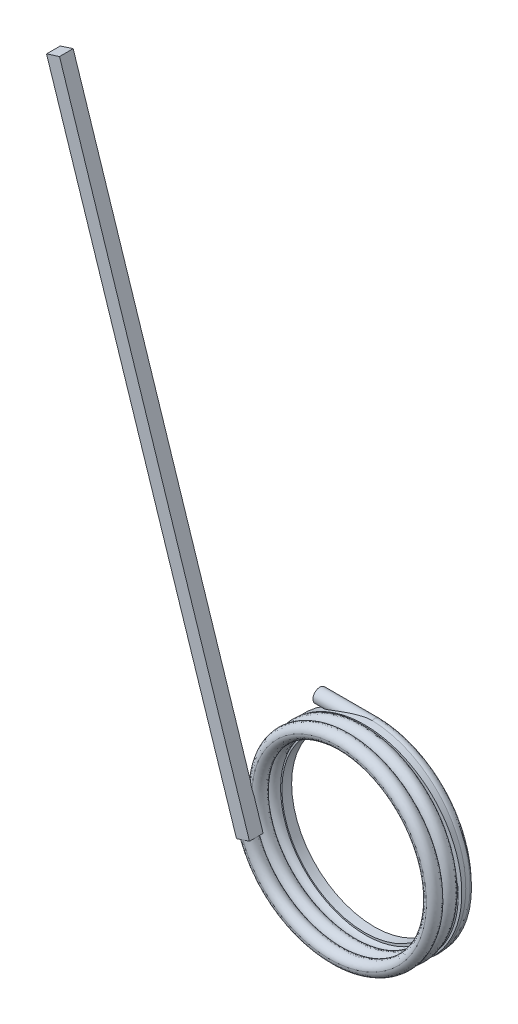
ISO-10303-21;
HEADER;
FILE_DESCRIPTION(('STEP AP214'),'2;1');
FILE_NAME('part.step','',(''),(''),'','','');
FILE_SCHEMA(('AUTOMOTIVE_DESIGN { 1 0 10303 214 1 1 1 1 }'));
ENDSEC;
DATA;
#1=APPLICATION_CONTEXT('core data for automotive mechanical design processes');
#2=APPLICATION_PROTOCOL_DEFINITION('international standard','automotive_design',2000,#1);
#3=PRODUCT_CONTEXT('',#1,'mechanical');
#4=PRODUCT('Part','Part','',(#3));
#5=PRODUCT_RELATED_PRODUCT_CATEGORY('part','',(#4));
#6=PRODUCT_DEFINITION_FORMATION('','',#4);
#7=PRODUCT_DEFINITION_CONTEXT('part definition',#1,'design');
#8=PRODUCT_DEFINITION('design','',#6,#7);
#9=PRODUCT_DEFINITION_SHAPE('','',#8);
#10=(LENGTH_UNIT() NAMED_UNIT(*) SI_UNIT(.MILLI.,.METRE.));
#11=(NAMED_UNIT(*) PLANE_ANGLE_UNIT() SI_UNIT($,.RADIAN.));
#12=(NAMED_UNIT(*) SI_UNIT($,.STERADIAN.) SOLID_ANGLE_UNIT());
#13=UNCERTAINTY_MEASURE_WITH_UNIT(LENGTH_MEASURE(1.E-05),#10,'distance_accuracy_value','');
#14=(GEOMETRIC_REPRESENTATION_CONTEXT(3) GLOBAL_UNCERTAINTY_ASSIGNED_CONTEXT((#13)) GLOBAL_UNIT_ASSIGNED_CONTEXT((#10,
#11,#12)) REPRESENTATION_CONTEXT('',''));
#15=CARTESIAN_POINT('',(0.,0.,0.));
#16=DIRECTION('',(0.,0.,1.));
#17=DIRECTION('',(1.,0.,0.));
#18=AXIS2_PLACEMENT_3D('',#15,#16,#17);
#19=CARTESIAN_POINT('',(-24.5,9.3,0.));
#20=DIRECTION('',(1.,0.,0.));
#21=DIRECTION('',(0.,1.,0.));
#22=AXIS2_PLACEMENT_3D('',#19,#20,#21);
#23=CYLINDRICAL_SURFACE('',#22,0.7);
#24=DIRECTION('',(1.,0.,0.));
#25=VECTOR('',#24,1.);
#26=CARTESIAN_POINT('',(-24.5,8.6,0.));
#27=LINE('',#26,#25);
#28=CARTESIAN_POINT('',(-5.0277200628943,8.59999999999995,0.));
#29=VERTEX_POINT('',#28);
#30=CARTESIAN_POINT('',(0.,8.6,0.));
#31=VERTEX_POINT('',#30);
#32=EDGE_CURVE('E398',#29,#31,#27,.T.);
#33=ORIENTED_EDGE('',*,*,#32,.F.);
#34=CARTESIAN_POINT('',(1.40010307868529,9.86294481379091,0.416044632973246));
#35=CARTESIAN_POINT('',(1.33697476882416,9.87190544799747,0.403933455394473));
#36=CARTESIAN_POINT('',(1.27376563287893,9.88026081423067,0.391796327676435));
#37=CARTESIAN_POINT('',(1.14713905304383,9.89576246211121,0.367788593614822));
#38=CARTESIAN_POINT('',(1.08372157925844,9.90290856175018,0.355918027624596));
#39=CARTESIAN_POINT('',(0.956158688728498,9.91604107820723,0.332676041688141));
#40=CARTESIAN_POINT('',(0.892011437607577,9.9220180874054,0.321309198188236));
#41=CARTESIAN_POINT('',(0.763440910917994,9.93273836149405,0.299646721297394));
#42=CARTESIAN_POINT('',(0.699017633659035,9.93748161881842,0.289351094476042));
#43=CARTESIAN_POINT('',(0.509284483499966,9.94958823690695,0.261596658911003));
#44=CARTESIAN_POINT('',(0.383461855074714,9.95524468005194,0.246460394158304));
#45=CARTESIAN_POINT('',(0.194221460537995,9.96013087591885,0.232920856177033));
#46=CARTESIAN_POINT('',(0.13118510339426,9.96116139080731,0.22993200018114));
#47=CARTESIAN_POINT('',(0.00503809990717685,9.96202408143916,0.227430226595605));
#48=CARTESIAN_POINT('',(-0.0580725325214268,9.96185645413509,0.227916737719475));
#49=CARTESIAN_POINT('',(-0.314579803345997,9.95873508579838,0.236931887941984));
#50=CARTESIAN_POINT('',(-0.507352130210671,9.95073405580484,0.260018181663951));
#51=CARTESIAN_POINT('',(-0.794417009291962,9.93056910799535,0.304370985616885));
#52=CARTESIAN_POINT('',(-0.890048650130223,9.92244902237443,0.320841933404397));
#53=CARTESIAN_POINT('',(-1.08078613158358,9.90348566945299,0.355238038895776));
#54=CARTESIAN_POINT('',(-1.17589214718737,9.89264337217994,0.373162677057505));
#55=CARTESIAN_POINT('',(-1.36617000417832,9.86817129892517,0.409467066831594));
#56=CARTESIAN_POINT('',(-1.46133957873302,9.85452721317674,0.427848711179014));
#57=CARTESIAN_POINT('',(-1.65132146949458,9.82447726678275,0.464199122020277));
#58=CARTESIAN_POINT('',(-1.74613377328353,9.80807131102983,0.482167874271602));
#59=CARTESIAN_POINT('',(-2.02964898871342,9.75476405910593,0.534474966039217));
#60=CARTESIAN_POINT('',(-2.21789348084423,9.71371387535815,0.567308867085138));
#61=CARTESIAN_POINT('',(-2.47709324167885,9.64921977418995,0.607030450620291));
#62=CARTESIAN_POINT('',(-2.54872514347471,9.63054825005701,0.617423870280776));
#63=CARTESIAN_POINT('',(-2.69175370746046,9.59155510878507,0.636764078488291));
#64=CARTESIAN_POINT('',(-2.76315030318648,9.5712330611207,0.645710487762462));
#65=CARTESIAN_POINT('',(-2.9770110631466,9.50775921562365,0.669997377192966));
#66=CARTESIAN_POINT('',(-3.119066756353,9.46211944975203,0.682772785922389));
#67=CARTESIAN_POINT('',(-3.34589021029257,9.38356053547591,0.695641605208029));
#68=CARTESIAN_POINT('',(-3.43120756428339,9.35270150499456,0.698747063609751));
#69=CARTESIAN_POINT('',(-3.6010016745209,9.28864794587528,0.700642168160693));
#70=CARTESIAN_POINT('',(-3.68547867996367,9.25545413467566,0.699433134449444));
#71=CARTESIAN_POINT('',(-3.85294755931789,9.1869970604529,0.691673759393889));
#72=CARTESIAN_POINT('',(-3.93594415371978,9.15174299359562,0.685145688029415));
#73=CARTESIAN_POINT('',(-4.10024817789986,9.07931536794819,0.665366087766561));
#74=CARTESIAN_POINT('',(-4.18155734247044,9.04214393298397,0.65212186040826));
#75=CARTESIAN_POINT('',(-4.31013076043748,8.98129378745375,0.623750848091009));
#76=CARTESIAN_POINT('',(-4.35821653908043,8.95805353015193,0.611409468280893));
#77=CARTESIAN_POINT('',(-4.45328396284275,8.91117518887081,0.582731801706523));
#78=CARTESIAN_POINT('',(-4.50026031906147,8.88753587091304,0.566379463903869));
#79=CARTESIAN_POINT('',(-4.57643588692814,8.84846635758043,0.53526355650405));
#80=CARTESIAN_POINT('',(-4.60618905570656,8.83301092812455,0.521890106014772));
#81=CARTESIAN_POINT('',(-4.66458148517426,8.80231412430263,0.492704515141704));
#82=CARTESIAN_POINT('',(-4.69322137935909,8.78707263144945,0.476893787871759));
#83=CARTESIAN_POINT('',(-4.74884914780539,8.75713382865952,0.442508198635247));
#84=CARTESIAN_POINT('',(-4.77584526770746,8.74243397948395,0.423949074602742));
#85=CARTESIAN_POINT('',(-4.82770998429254,8.71390019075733,0.383533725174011));
#86=CARTESIAN_POINT('',(-4.85258270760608,8.70006458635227,0.361684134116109));
#87=CARTESIAN_POINT('',(-4.89317916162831,8.67727839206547,0.320342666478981));
#88=CARTESIAN_POINT('',(-4.90959694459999,8.66799499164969,0.301722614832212));
#89=CARTESIAN_POINT('',(-4.9401966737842,8.650591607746,0.262174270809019));
#90=CARTESIAN_POINT('',(-4.95437717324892,8.64247237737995,0.241244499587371));
#91=CARTESIAN_POINT('',(-4.97987124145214,8.62780800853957,0.196757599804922));
#92=CARTESIAN_POINT('',(-4.99114450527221,8.62128505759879,0.173169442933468));
#93=CARTESIAN_POINT('',(-5.00954240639,8.61060797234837,0.123955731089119));
#94=CARTESIAN_POINT('',(-5.01668332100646,8.60644454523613,0.0983386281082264));
#95=CARTESIAN_POINT('',(-5.02344236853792,8.60249970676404,0.0603055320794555));
#96=CARTESIAN_POINT('',(-5.02503878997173,8.60156709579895,0.0483358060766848));
#97=CARTESIAN_POINT('',(-5.02718005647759,8.60031572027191,0.0242475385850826));
#98=CARTESIAN_POINT('',(-5.02772282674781,8.59999816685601,0.012128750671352));
#99=CARTESIAN_POINT('',(-5.0277200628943,8.59999999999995,0.));
#100=B_SPLINE_CURVE_WITH_KNOTS('',3,(#34,#35,#36,#37,#38,#39,#40,#41,#42,#43,#44,#45,#46,#47,
#48,#49,#50,#51,#52,#53,#54,#55,#56,#57,#58,#59,#60,#61,#62,#63,#64,#65,#66,#67,#68,#69,#70,#71,
#72,#73,#74,#75,#76,#77,#78,#79,#80,#81,#82,#83,#84,#85,#86,#87,#88,#89,#90,#91,#92,#93,#94,#95,
#96,#97,#98,#99),.UNSPECIFIED.,.F.,.F.,(4,2,2,2,2,2,2,2,2,2,2,2,2,2,2,2,2,2,2,2,2,2,2,2,2,2,2,2,
2,2,2,2,4),(0.,0.194699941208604,0.389429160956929,0.585666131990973,0.781904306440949,
1.16194004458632,1.35119282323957,1.54041449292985,2.12117125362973,2.41336138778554,
2.7054475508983,2.99906436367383,3.29269128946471,3.87851734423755,4.10274507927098,
4.32703149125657,4.77585246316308,5.0480872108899,5.32023866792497,5.59125648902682,
5.86198029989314,6.02630960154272,6.19130756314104,6.29951916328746,6.4076682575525,
6.51522043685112,6.6225585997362,6.70189607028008,6.78128463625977,6.86172090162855,
6.94183813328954,6.97811823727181,7.01446971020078),.UNSPECIFIED.);
#101=CARTESIAN_POINT('',(0.,9.96182558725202,0.228006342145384));
#102=VERTEX_POINT('',#101);
#103=EDGE_CURVE('E243',#102,#29,#100,.T.);
#104=ORIENTED_EDGE('',*,*,#103,.F.);
#105=CARTESIAN_POINT('',(0.,9.3,0.));
#106=DIRECTION('',(1.,0.,0.));
#107=DIRECTION('',(0.,0.,-1.));
#108=AXIS2_PLACEMENT_3D('',#105,#106,#107);
#109=CIRCLE('',#108,0.7);
#110=CARTESIAN_POINT('',(0.,9.29999999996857,-0.7));
#111=VERTEX_POINT('',#110);
#112=EDGE_CURVE('E251',#111,#102,#109,.T.);
#113=ORIENTED_EDGE('',*,*,#112,.F.);
#114=CARTESIAN_POINT('',(0.,9.3,0.));
#115=DIRECTION('',(1.,0.,0.));
#116=DIRECTION('',(0.,0.,-1.));
#117=AXIS2_PLACEMENT_3D('',#114,#115,#116);
#118=CIRCLE('',#117,0.7);
#119=EDGE_CURVE('E300',#31,#111,#118,.T.);
#120=ORIENTED_EDGE('',*,*,#119,.F.);
#121=EDGE_LOOP('',(#33,#104,#113,#120));
#122=FACE_BOUND('',#121,.T.);
#123=CARTESIAN_POINT('',(-5.59127936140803,9.29999999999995,0.));
#124=DIRECTION('',(-1.,0.,0.));
#125=DIRECTION('',(0.,-1.,0.));
#126=AXIS2_PLACEMENT_3D('',#123,#124,#125);
#127=CIRCLE('',#126,0.7);
#128=CARTESIAN_POINT('',(-5.59127936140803,8.59999999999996,0.));
#129=VERTEX_POINT('',#128);
#130=EDGE_CURVE('E43',#129,#129,#127,.T.);
#131=ORIENTED_EDGE('',*,*,#130,.F.);
#132=EDGE_LOOP('',(#131));
#133=FACE_BOUND('',#132,.T.);
#134=ADVANCED_FACE('F39',(#122,#133),#23,.T.);
#135=CARTESIAN_POINT('',(0.,9.3,0.7));
#136=CARTESIAN_POINT('',(3.85218613,9.3,0.790625));
#137=CARTESIAN_POINT('',(6.576093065,6.576093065,0.88125));
#138=CARTESIAN_POINT('',(9.3,3.85218613,0.971875));
#139=CARTESIAN_POINT('',(9.3,0.,1.0625));
#140=CARTESIAN_POINT('',(9.3,-3.85218613,1.153125));
#141=CARTESIAN_POINT('',(6.576093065,-6.576093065,1.24375));
#142=CARTESIAN_POINT('',(3.85218613,-9.3,1.334375));
#143=CARTESIAN_POINT('',(0.,-9.3,1.425));
#144=CARTESIAN_POINT('',(-3.85218613,-9.3,1.515625));
#145=CARTESIAN_POINT('',(-6.576093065,-6.576093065,1.60625));
#146=CARTESIAN_POINT('',(-9.3,-3.85218613,1.696875));
#147=CARTESIAN_POINT('',(-9.3,0.,1.7875));
#148=CARTESIAN_POINT('',(-9.3,3.85218613,1.878125));
#149=CARTESIAN_POINT('',(-6.576093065,6.576093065,1.96875));
#150=CARTESIAN_POINT('',(-3.85218613,9.3,2.059375));
#151=CARTESIAN_POINT('',(0.,9.3,2.15));
#152=CARTESIAN_POINT('',(3.85218613,9.3,2.240625));
#153=CARTESIAN_POINT('',(6.576093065,6.576093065,2.33125));
#154=CARTESIAN_POINT('',(9.3,3.85218613,2.421875));
#155=CARTESIAN_POINT('',(9.3,0.,2.5125));
#156=CARTESIAN_POINT('',(9.3,-3.85218613,2.603125));
#157=CARTESIAN_POINT('',(6.576093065,-6.576093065,2.69375));
#158=CARTESIAN_POINT('',(3.85218613,-9.3,2.784375));
#159=CARTESIAN_POINT('',(0.,-9.3,2.875));
#160=CARTESIAN_POINT('',(-3.85218613,-9.3,2.965625));
#161=CARTESIAN_POINT('',(-6.576093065,-6.576093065,3.05625));
#162=CARTESIAN_POINT('',(-9.3,-3.85218613,3.146875));
#163=CARTESIAN_POINT('',(-9.3,0.,3.2375));
#164=CARTESIAN_POINT('',(-9.3,3.85218613,3.328125));
#165=CARTESIAN_POINT('',(-6.576093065,6.576093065,3.41875));
#166=CARTESIAN_POINT('',(-3.85218613,9.3,3.509375));
#167=CARTESIAN_POINT('',(0.,9.3,3.6));
#168=CARTESIAN_POINT('',(3.85218613,9.3,3.690625));
#169=CARTESIAN_POINT('',(6.576093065,6.576093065,3.78125));
#170=CARTESIAN_POINT('',(9.3,3.85218613,3.871875));
#171=CARTESIAN_POINT('',(9.3,0.,3.9625));
#172=CARTESIAN_POINT('',(9.3,-3.85218613,4.053125));
#173=CARTESIAN_POINT('',(6.576093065,-6.576093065,4.14375));
#174=CARTESIAN_POINT('',(3.85218613,-9.3,4.234375));
#175=CARTESIAN_POINT('',(0.,-9.3,4.325));
#176=CARTESIAN_POINT('',(-3.85218613,-9.3,4.415625));
#177=CARTESIAN_POINT('',(-6.576093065,-6.576093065,4.50625));
#178=CARTESIAN_POINT('',(-8.154869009,-4.997317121,4.558776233));
#179=CARTESIAN_POINT('',(-8.844822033,-2.873869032,4.615454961));
#180=CARTESIAN_POINT('',(0.,7.9,0.7));
#181=CARTESIAN_POINT('',(3.272287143,7.9,0.790625));
#182=CARTESIAN_POINT('',(5.586143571,5.586143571,0.88125));
#183=CARTESIAN_POINT('',(7.9,3.272287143,0.971875));
#184=CARTESIAN_POINT('',(7.9,0.,1.0625));
#185=CARTESIAN_POINT('',(7.9,-3.272287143,1.153125));
#186=CARTESIAN_POINT('',(5.586143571,-5.586143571,1.24375));
#187=CARTESIAN_POINT('',(3.272287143,-7.9,1.334375));
#188=CARTESIAN_POINT('',(0.,-7.9,1.425));
#189=CARTESIAN_POINT('',(-3.272287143,-7.9,1.515625));
#190=CARTESIAN_POINT('',(-5.586143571,-5.586143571,1.60625));
#191=CARTESIAN_POINT('',(-7.9,-3.272287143,1.696875));
#192=CARTESIAN_POINT('',(-7.9,0.,1.7875));
#193=CARTESIAN_POINT('',(-7.9,3.272287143,1.878125));
#194=CARTESIAN_POINT('',(-5.586143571,5.586143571,1.96875));
#195=CARTESIAN_POINT('',(-3.272287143,7.9,2.059375));
#196=CARTESIAN_POINT('',(0.,7.9,2.15));
#197=CARTESIAN_POINT('',(3.272287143,7.9,2.240625));
#198=CARTESIAN_POINT('',(5.586143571,5.586143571,2.33125));
#199=CARTESIAN_POINT('',(7.9,3.272287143,2.421875));
#200=CARTESIAN_POINT('',(7.9,0.,2.5125));
#201=CARTESIAN_POINT('',(7.9,-3.272287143,2.603125));
#202=CARTESIAN_POINT('',(5.586143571,-5.586143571,2.69375));
#203=CARTESIAN_POINT('',(3.272287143,-7.9,2.784375));
#204=CARTESIAN_POINT('',(0.,-7.9,2.875));
#205=CARTESIAN_POINT('',(-3.272287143,-7.9,2.965625));
#206=CARTESIAN_POINT('',(-5.586143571,-5.586143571,3.05625));
#207=CARTESIAN_POINT('',(-7.9,-3.272287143,3.146875));
#208=CARTESIAN_POINT('',(-7.9,0.,3.2375));
#209=CARTESIAN_POINT('',(-7.9,3.272287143,3.328125));
#210=CARTESIAN_POINT('',(-5.586143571,5.586143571,3.41875));
#211=CARTESIAN_POINT('',(-3.272287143,7.9,3.509375));
#212=CARTESIAN_POINT('',(0.,7.9,3.6));
#213=CARTESIAN_POINT('',(3.272287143,7.9,3.690625));
#214=CARTESIAN_POINT('',(5.586143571,5.586143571,3.78125));
#215=CARTESIAN_POINT('',(7.9,3.272287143,3.871875));
#216=CARTESIAN_POINT('',(7.9,0.,3.9625));
#217=CARTESIAN_POINT('',(7.9,-3.272287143,4.053125));
#218=CARTESIAN_POINT('',(5.586143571,-5.586143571,4.14375));
#219=CARTESIAN_POINT('',(3.272287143,-7.9,4.234375));
#220=CARTESIAN_POINT('',(0.,-7.9,4.325));
#221=CARTESIAN_POINT('',(-3.272287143,-7.9,4.415625));
#222=CARTESIAN_POINT('',(-5.586143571,-5.586143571,4.50625));
#223=CARTESIAN_POINT('',(-6.927254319,-4.245032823,4.558776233));
#224=CARTESIAN_POINT('',(-7.513343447,-2.441243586,4.615454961));
#225=CARTESIAN_POINT('',(0.,7.9,-0.7));
#226=CARTESIAN_POINT('',(3.272287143,7.9,-0.609375));
#227=CARTESIAN_POINT('',(5.586143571,5.586143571,-0.51875));
#228=CARTESIAN_POINT('',(7.9,3.272287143,-0.428125));
#229=CARTESIAN_POINT('',(7.9,0.,-0.3375));
#230=CARTESIAN_POINT('',(7.9,-3.272287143,-0.246875));
#231=CARTESIAN_POINT('',(5.586143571,-5.586143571,-0.15625));
#232=CARTESIAN_POINT('',(3.272287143,-7.9,-0.065625));
#233=CARTESIAN_POINT('',(0.,-7.9,0.025));
#234=CARTESIAN_POINT('',(-3.272287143,-7.9,0.115625));
#235=CARTESIAN_POINT('',(-5.586143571,-5.586143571,0.20625));
#236=CARTESIAN_POINT('',(-7.9,-3.272287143,0.296875));
#237=CARTESIAN_POINT('',(-7.9,0.,0.3875));
#238=CARTESIAN_POINT('',(-7.9,3.272287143,0.478125));
#239=CARTESIAN_POINT('',(-5.586143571,5.586143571,0.56875));
#240=CARTESIAN_POINT('',(-3.272287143,7.9,0.659375));
#241=CARTESIAN_POINT('',(0.,7.9,0.75));
#242=CARTESIAN_POINT('',(3.272287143,7.9,0.840625));
#243=CARTESIAN_POINT('',(5.586143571,5.586143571,0.93125));
#244=CARTESIAN_POINT('',(7.9,3.272287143,1.021875));
#245=CARTESIAN_POINT('',(7.9,0.,1.1125));
#246=CARTESIAN_POINT('',(7.9,-3.272287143,1.203125));
#247=CARTESIAN_POINT('',(5.586143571,-5.586143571,1.29375));
#248=CARTESIAN_POINT('',(3.272287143,-7.9,1.384375));
#249=CARTESIAN_POINT('',(0.,-7.9,1.475));
#250=CARTESIAN_POINT('',(-3.272287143,-7.9,1.565625));
#251=CARTESIAN_POINT('',(-5.586143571,-5.586143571,1.65625));
#252=CARTESIAN_POINT('',(-7.9,-3.272287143,1.746875));
#253=CARTESIAN_POINT('',(-7.9,0.,1.8375));
#254=CARTESIAN_POINT('',(-7.9,3.272287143,1.928125));
#255=CARTESIAN_POINT('',(-5.586143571,5.586143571,2.01875));
#256=CARTESIAN_POINT('',(-3.272287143,7.9,2.109375));
#257=CARTESIAN_POINT('',(0.,7.9,2.2));
#258=CARTESIAN_POINT('',(3.272287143,7.9,2.290625));
#259=CARTESIAN_POINT('',(5.586143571,5.586143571,2.38125));
#260=CARTESIAN_POINT('',(7.9,3.272287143,2.471875));
#261=CARTESIAN_POINT('',(7.9,0.,2.5625));
#262=CARTESIAN_POINT('',(7.9,-3.272287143,2.653125));
#263=CARTESIAN_POINT('',(5.586143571,-5.586143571,2.74375));
#264=CARTESIAN_POINT('',(3.272287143,-7.9,2.834375));
#265=CARTESIAN_POINT('',(0.,-7.9,2.925));
#266=CARTESIAN_POINT('',(-3.272287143,-7.9,3.015625));
#267=CARTESIAN_POINT('',(-5.586143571,-5.586143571,3.10625));
#268=CARTESIAN_POINT('',(-6.927254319,-4.245032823,3.158776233));
#269=CARTESIAN_POINT('',(-7.513343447,-2.441243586,3.215454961));
#270=CARTESIAN_POINT('',(0.,9.3,-0.7));
#271=CARTESIAN_POINT('',(3.85218613,9.3,-0.609375));
#272=CARTESIAN_POINT('',(6.576093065,6.576093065,-0.51875));
#273=CARTESIAN_POINT('',(9.3,3.85218613,-0.428125));
#274=CARTESIAN_POINT('',(9.3,0.,-0.3375));
#275=CARTESIAN_POINT('',(9.3,-3.85218613,-0.246875));
#276=CARTESIAN_POINT('',(6.576093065,-6.576093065,-0.15625));
#277=CARTESIAN_POINT('',(3.85218613,-9.3,-0.065625));
#278=CARTESIAN_POINT('',(0.,-9.3,0.025));
#279=CARTESIAN_POINT('',(-3.85218613,-9.3,0.115625));
#280=CARTESIAN_POINT('',(-6.576093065,-6.576093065,0.20625));
#281=CARTESIAN_POINT('',(-9.3,-3.85218613,0.296875));
#282=CARTESIAN_POINT('',(-9.3,0.,0.3875));
#283=CARTESIAN_POINT('',(-9.3,3.85218613,0.478125));
#284=CARTESIAN_POINT('',(-6.576093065,6.576093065,0.56875));
#285=CARTESIAN_POINT('',(-3.85218613,9.3,0.659375));
#286=CARTESIAN_POINT('',(0.,9.3,0.75));
#287=CARTESIAN_POINT('',(3.85218613,9.3,0.840625));
#288=CARTESIAN_POINT('',(6.576093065,6.576093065,0.93125));
#289=CARTESIAN_POINT('',(9.3,3.85218613,1.021875));
#290=CARTESIAN_POINT('',(9.3,0.,1.1125));
#291=CARTESIAN_POINT('',(9.3,-3.85218613,1.203125));
#292=CARTESIAN_POINT('',(6.576093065,-6.576093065,1.29375));
#293=CARTESIAN_POINT('',(3.85218613,-9.3,1.384375));
#294=CARTESIAN_POINT('',(0.,-9.3,1.475));
#295=CARTESIAN_POINT('',(-3.85218613,-9.3,1.565625));
#296=CARTESIAN_POINT('',(-6.576093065,-6.576093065,1.65625));
#297=CARTESIAN_POINT('',(-9.3,-3.85218613,1.746875));
#298=CARTESIAN_POINT('',(-9.3,0.,1.8375));
#299=CARTESIAN_POINT('',(-9.3,3.85218613,1.928125));
#300=CARTESIAN_POINT('',(-6.576093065,6.576093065,2.01875));
#301=CARTESIAN_POINT('',(-3.85218613,9.3,2.109375));
#302=CARTESIAN_POINT('',(0.,9.3,2.2));
#303=CARTESIAN_POINT('',(3.85218613,9.3,2.290625));
#304=CARTESIAN_POINT('',(6.576093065,6.576093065,2.38125));
#305=CARTESIAN_POINT('',(9.3,3.85218613,2.471875));
#306=CARTESIAN_POINT('',(9.3,0.,2.5625));
#307=CARTESIAN_POINT('',(9.3,-3.85218613,2.653125));
#308=CARTESIAN_POINT('',(6.576093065,-6.576093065,2.74375));
#309=CARTESIAN_POINT('',(3.85218613,-9.3,2.834375));
#310=CARTESIAN_POINT('',(0.,-9.3,2.925));
#311=CARTESIAN_POINT('',(-3.85218613,-9.3,3.015625));
#312=CARTESIAN_POINT('',(-6.576093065,-6.576093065,3.10625));
#313=CARTESIAN_POINT('',(-8.154869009,-4.997317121,3.158776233));
#314=CARTESIAN_POINT('',(-8.844822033,-2.873869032,3.215454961));
#315=(BOUNDED_SURFACE() B_SPLINE_SURFACE(3,2,((#135,#136,#137,#138,#139,#140,#141,#142,#143,
#144,#145,#146,#147,#148,#149,#150,#151,#152,#153,#154,#155,#156,#157,#158,#159,#160,#161,#162,
#163,#164,#165,#166,#167,#168,#169,#170,#171,#172,#173,#174,#175,#176,#177,#178,#179),(#180,
#181,#182,#183,#184,#185,#186,#187,#188,#189,#190,#191,#192,#193,#194,#195,#196,#197,#198,#199,
#200,#201,#202,#203,#204,#205,#206,#207,#208,#209,#210,#211,#212,#213,#214,#215,#216,#217,#218,
#219,#220,#221,#222,#223,#224),(#225,#226,#227,#228,#229,#230,#231,#232,#233,#234,#235,#236,
#237,#238,#239,#240,#241,#242,#243,#244,#245,#246,#247,#248,#249,#250,#251,#252,#253,#254,#255,
#256,#257,#258,#259,#260,#261,#262,#263,#264,#265,#266,#267,#268,#269),(#270,#271,#272,#273,
#274,#275,#276,#277,#278,#279,#280,#281,#282,#283,#284,#285,#286,#287,#288,#289,#290,#291,#292,
#293,#294,#295,#296,#297,#298,#299,#300,#301,#302,#303,#304,#305,#306,#307,#308,#309,#310,#311,
#312,#313,#314)),.UNSPECIFIED.,.F.,.F.,.F.) B_SPLINE_SURFACE_WITH_KNOTS((4,4),(3,2,2,2,2,2,2,2,
2,2,2,2,2,2,2,2,2,2,2,2,2,2,3),(0.5,1.),(0.,0.0416666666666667,0.0833333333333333,0.125,
0.166666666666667,0.208333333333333,0.25,0.291666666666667,0.333333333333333,0.375,
0.416666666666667,0.458333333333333,0.5,0.541666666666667,0.583333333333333,0.625,
0.666666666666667,0.708333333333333,0.75,0.791666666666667,0.833333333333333,0.875,
0.899948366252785),
.UNSPECIFIED.) GEOMETRIC_REPRESENTATION_ITEM() RATIONAL_B_SPLINE_SURFACE(((1.,0.923879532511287,
1.,0.923879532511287,1.,0.923879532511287,1.,0.923879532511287,1.,0.923879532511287,1.,
0.923879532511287,1.,0.923879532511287,1.,0.923879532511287,1.,0.923879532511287,1.,
0.923879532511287,1.,0.923879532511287,1.,0.923879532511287,1.,0.923879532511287,1.,
0.923879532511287,1.,0.923879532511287,1.,0.923879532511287,1.,0.923879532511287,1.,
0.923879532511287,1.,0.923879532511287,1.,0.923879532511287,1.,0.923879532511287,1.,
0.9544220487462,0.963424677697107),(0.333333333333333,0.307959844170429,0.333333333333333,
0.307959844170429,0.333333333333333,0.307959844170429,0.333333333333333,0.307959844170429,
0.333333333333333,0.307959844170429,0.333333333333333,0.307959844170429,0.333333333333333,
0.307959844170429,0.333333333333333,0.307959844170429,0.333333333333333,0.307959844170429,
0.333333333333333,0.307959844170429,0.333333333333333,0.307959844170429,0.333333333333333,
0.307959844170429,0.333333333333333,0.307959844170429,0.333333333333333,0.307959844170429,
0.333333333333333,0.307959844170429,0.333333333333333,0.307959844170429,0.333333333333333,
0.307959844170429,0.333333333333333,0.307959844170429,0.333333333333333,0.307959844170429,
0.333333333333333,0.307959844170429,0.333333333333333,0.307959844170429,0.333333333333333,
0.3181406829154,0.321141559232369),(0.333333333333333,0.307959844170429,0.333333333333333,
0.307959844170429,0.333333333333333,0.307959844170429,0.333333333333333,0.307959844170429,
0.333333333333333,0.307959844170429,0.333333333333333,0.307959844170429,0.333333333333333,
0.307959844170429,0.333333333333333,0.307959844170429,0.333333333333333,0.307959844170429,
0.333333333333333,0.307959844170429,0.333333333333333,0.307959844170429,0.333333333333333,
0.307959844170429,0.333333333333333,0.307959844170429,0.333333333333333,0.307959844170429,
0.333333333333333,0.307959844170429,0.333333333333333,0.307959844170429,0.333333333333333,
0.307959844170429,0.333333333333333,0.307959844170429,0.333333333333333,0.307959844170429,
0.333333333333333,0.307959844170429,0.333333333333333,0.307959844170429,0.333333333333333,
0.3181406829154,0.321141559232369),(1.,0.923879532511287,1.,0.923879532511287,1.,
0.923879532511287,1.,0.923879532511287,1.,0.923879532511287,1.,0.923879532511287,1.,
0.923879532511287,1.,0.923879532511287,1.,0.923879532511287,1.,0.923879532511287,1.,
0.923879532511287,1.,0.923879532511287,1.,0.923879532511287,1.,0.923879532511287,1.,
0.923879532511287,1.,0.923879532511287,1.,0.923879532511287,1.,0.923879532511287,1.,
0.923879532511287,1.,0.923879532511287,1.,0.923879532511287,1.,0.9544220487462,0.963424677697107))) REPRESENTATION_ITEM('') SURFACE());
#316=CARTESIAN_POINT('',(0.,9.3,-0.7));
#317=CARTESIAN_POINT('',(3.85218613,9.3,-0.609375));
#318=CARTESIAN_POINT('',(6.576093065,6.576093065,-0.51875));
#319=CARTESIAN_POINT('',(9.3,3.85218613,-0.428125));
#320=CARTESIAN_POINT('',(9.3,0.,-0.3375));
#321=CARTESIAN_POINT('',(9.3,-3.85218613,-0.246875));
#322=CARTESIAN_POINT('',(6.576093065,-6.576093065,-0.15625));
#323=CARTESIAN_POINT('',(3.85218613,-9.3,-0.065625));
#324=CARTESIAN_POINT('',(0.,-9.3,0.025));
#325=CARTESIAN_POINT('',(-3.85218613,-9.3,0.115625));
#326=CARTESIAN_POINT('',(-6.576093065,-6.576093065,0.20625));
#327=CARTESIAN_POINT('',(-9.3,-3.85218613,0.296875));
#328=CARTESIAN_POINT('',(-9.3,0.,0.3875));
#329=CARTESIAN_POINT('',(-9.3,3.85218613,0.478125));
#330=CARTESIAN_POINT('',(-6.576093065,6.576093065,0.56875));
#331=CARTESIAN_POINT('',(-3.85218613,9.3,0.659375));
#332=CARTESIAN_POINT('',(0.,9.3,0.75));
#333=CARTESIAN_POINT('',(3.85218613,9.3,0.840625));
#334=CARTESIAN_POINT('',(6.576093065,6.576093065,0.93125));
#335=CARTESIAN_POINT('',(9.3,3.85218613,1.021875));
#336=CARTESIAN_POINT('',(9.3,0.,1.1125));
#337=CARTESIAN_POINT('',(9.3,-3.85218613,1.203125));
#338=CARTESIAN_POINT('',(6.576093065,-6.576093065,1.29375));
#339=CARTESIAN_POINT('',(3.85218613,-9.3,1.384375));
#340=CARTESIAN_POINT('',(0.,-9.3,1.475));
#341=CARTESIAN_POINT('',(-3.85218613,-9.3,1.565625));
#342=CARTESIAN_POINT('',(-6.576093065,-6.576093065,1.65625));
#343=CARTESIAN_POINT('',(-9.3,-3.85218613,1.746875));
#344=CARTESIAN_POINT('',(-9.3,0.,1.8375));
#345=CARTESIAN_POINT('',(-9.3,3.85218613,1.928125));
#346=CARTESIAN_POINT('',(-6.576093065,6.576093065,2.01875));
#347=CARTESIAN_POINT('',(-3.85218613,9.3,2.109375));
#348=CARTESIAN_POINT('',(0.,9.3,2.2));
#349=CARTESIAN_POINT('',(3.85218613,9.3,2.290625));
#350=CARTESIAN_POINT('',(6.576093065,6.576093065,2.38125));
#351=CARTESIAN_POINT('',(9.3,3.85218613,2.471875));
#352=CARTESIAN_POINT('',(9.3,0.,2.5625));
#353=CARTESIAN_POINT('',(9.3,-3.85218613,2.653125));
#354=CARTESIAN_POINT('',(6.576093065,-6.576093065,2.74375));
#355=CARTESIAN_POINT('',(3.85218613,-9.3,2.834375));
#356=CARTESIAN_POINT('',(0.,-9.3,2.925));
#357=CARTESIAN_POINT('',(-3.85218613,-9.3,3.015625));
#358=CARTESIAN_POINT('',(-6.576093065,-6.576093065,3.10625));
#359=CARTESIAN_POINT('',(-8.154869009,-4.997317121,3.158776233));
#360=CARTESIAN_POINT('',(-8.844822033,-2.873869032,3.215454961));
#361=(BOUNDED_CURVE() B_SPLINE_CURVE(2,(#316,#317,#318,#319,#320,#321,#322,#323,#324,#325,#326,
#327,#328,#329,#330,#331,#332,#333,#334,#335,#336,#337,#338,#339,#340,#341,#342,#343,#344,#345,
#346,#347,#348,#349,#350,#351,#352,#353,#354,#355,#356,#357,#358,#359,#360),.UNSPECIFIED.,.F.,
.F.) B_SPLINE_CURVE_WITH_KNOTS((3,2,2,2,2,2,2,2,2,2,2,2,2,2,2,2,2,2,2,2,2,2,3),(0.,
0.0416666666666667,0.0833333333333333,0.125,0.166666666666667,0.208333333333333,0.25,
0.291666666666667,0.333333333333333,0.375,0.416666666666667,0.458333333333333,0.5,
0.541666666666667,0.583333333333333,0.625,0.666666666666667,0.708333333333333,0.75,
0.791666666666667,0.833333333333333,0.875,0.899948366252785),
.UNSPECIFIED.) CURVE() GEOMETRIC_REPRESENTATION_ITEM() RATIONAL_B_SPLINE_CURVE((1.,
0.923879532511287,1.,0.923879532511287,1.,0.923879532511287,1.,0.923879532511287,1.,
0.923879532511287,1.,0.923879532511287,1.,0.923879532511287,1.,0.923879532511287,1.,
0.923879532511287,1.,0.923879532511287,1.,0.923879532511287,1.,0.923879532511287,1.,
0.923879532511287,1.,0.923879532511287,1.,0.923879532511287,1.,0.923879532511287,1.,
0.923879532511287,1.,0.923879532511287,1.,0.923879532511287,1.,0.923879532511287,1.,
0.923879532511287,1.,0.9544220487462,0.963424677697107)) REPRESENTATION_ITEM(''));
#362=CARTESIAN_POINT('',(1.03857585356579,-9.24182666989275,0.));
#363=VERTEX_POINT('',#362);
#364=EDGE_CURVE('E307',#111,#363,#361,.T.);
#365=CARTESIAN_POINT('',(1.03857585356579,-9.24182666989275,0.));
#366=CARTESIAN_POINT('',(1.03832628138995,-9.23968923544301,0.));
#367=CARTESIAN_POINT('',(1.03850557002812,-9.23758753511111,0.));
#368=CARTESIAN_POINT('',(1.03964105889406,-9.23286596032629,0.));
#369=CARTESIAN_POINT('',(1.0408287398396,-9.23029702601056,0.));
#370=CARTESIAN_POINT('',(1.04363531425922,-9.22571227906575,0.));
#371=CARTESIAN_POINT('',(1.04521849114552,-9.22367042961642,0.));
#372=CARTESIAN_POINT('',(1.04864026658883,-9.21980528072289,0.));
#373=CARTESIAN_POINT('',(1.05047948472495,-9.21798253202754,0.));
#374=CARTESIAN_POINT('',(1.05658314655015,-9.21242985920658,0.));
#375=CARTESIAN_POINT('',(1.06112587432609,-9.20901559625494,0.));
#376=CARTESIAN_POINT('',(1.07049582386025,-9.20262497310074,0.));
#377=CARTESIAN_POINT('',(1.07532332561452,-9.19964905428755,0.));
#378=CARTESIAN_POINT('',(1.08518731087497,-9.19395709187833,0.));
#379=CARTESIAN_POINT('',(1.0902252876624,-9.19124363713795,0.));
#380=CARTESIAN_POINT('',(1.10039746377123,-9.18602177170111,0.));
#381=CARTESIAN_POINT('',(1.10553155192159,-9.18351314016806,0.));
#382=CARTESIAN_POINT('',(1.12084123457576,-9.17629911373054,0.));
#383=CARTESIAN_POINT('',(1.13111480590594,-9.17180237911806,0.));
#384=CARTESIAN_POINT('',(1.1518066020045,-9.16315293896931,0.));
#385=CARTESIAN_POINT('',(1.1622248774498,-9.15900035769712,0.));
#386=CARTESIAN_POINT('',(1.19363750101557,-9.14687811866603,0.));
#387=CARTESIAN_POINT('',(1.21476486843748,-9.13925480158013,0.));
#388=CARTESIAN_POINT('',(1.25705985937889,-9.12452689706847,0.));
#389=CARTESIAN_POINT('',(1.27822656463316,-9.11741959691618,0.));
#390=CARTESIAN_POINT('',(1.32063638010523,-9.10349028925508,0.));
#391=CARTESIAN_POINT('',(1.3418794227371,-9.09666807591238,0.));
#392=CARTESIAN_POINT('',(1.40555856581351,-9.07647848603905,0.));
#393=CARTESIAN_POINT('',(1.44806875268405,-9.06334678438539,0.));
#394=CARTESIAN_POINT('',(1.53313759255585,-9.03723998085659,0.));
#395=CARTESIAN_POINT('',(1.57569624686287,-9.02426488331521,0.));
#396=CARTESIAN_POINT('',(1.70335621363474,-8.98521103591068,0.));
#397=CARTESIAN_POINT('',(1.78842089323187,-8.95900995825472,0.));
#398=CARTESIAN_POINT('',(1.9583163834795,-8.90533283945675,0.));
#399=CARTESIAN_POINT('',(2.04314651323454,-8.8778546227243,0.));
#400=CARTESIAN_POINT('',(2.21227994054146,-8.82128613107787,0.));
#401=CARTESIAN_POINT('',(2.29658316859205,-8.79219564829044,0.));
#402=CARTESIAN_POINT('',(2.51845245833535,-8.71291126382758,0.));
#403=CARTESIAN_POINT('',(2.6554685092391,-8.66115842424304,0.));
#404=CARTESIAN_POINT('',(2.92732624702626,-8.55222015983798,0.));
#405=CARTESIAN_POINT('',(3.06216778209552,-8.49503435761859,0.));
#406=CARTESIAN_POINT('',(3.46293858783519,-8.31496763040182,0.));
#407=CARTESIAN_POINT('',(3.72512093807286,-8.18357496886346,0.));
#408=CARTESIAN_POINT('',(4.23698604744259,-7.89770176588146,0.));
#409=CARTESIAN_POINT('',(4.48665362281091,-7.74319404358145,0.));
#410=CARTESIAN_POINT('',(4.97076732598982,-7.4118598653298,0.));
#411=CARTESIAN_POINT('',(5.2052118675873,-7.2350310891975,0.));
#412=CARTESIAN_POINT('',(5.65768224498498,-6.85922434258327,0.));
#413=CARTESIAN_POINT('',(5.87562034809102,-6.66014028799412,0.));
#414=CARTESIAN_POINT('',(6.1875559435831,-6.34674661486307,0.));
#415=CARTESIAN_POINT('',(6.289050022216,-6.23980764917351,0.));
#416=CARTESIAN_POINT('',(6.48667388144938,-6.02108047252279,0.));
#417=CARTESIAN_POINT('',(6.5828036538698,-5.90929225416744,0.));
#418=CARTESIAN_POINT('',(6.86269178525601,-5.56716357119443,0.));
#419=CARTESIAN_POINT('',(7.03810413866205,-5.3299033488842,0.));
#420=CARTESIAN_POINT('',(7.36475531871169,-4.8393507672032,0.));
#421=CARTESIAN_POINT('',(7.51599568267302,-4.58605942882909,0.));
#422=CARTESIAN_POINT('',(7.77473047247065,-4.09985955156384,0.));
#423=CARTESIAN_POINT('',(7.88535890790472,-3.86861358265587,0.));
#424=CARTESIAN_POINT('',(8.08639074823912,-3.39749957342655,0.));
#425=CARTESIAN_POINT('',(8.17679543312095,-3.15763207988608,0.));
#426=CARTESIAN_POINT('',(8.33665937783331,-2.67107295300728,0.));
#427=CARTESIAN_POINT('',(8.40612321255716,-2.42438282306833,0.));
#428=CARTESIAN_POINT('',(8.52357775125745,-1.92594002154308,0.));
#429=CARTESIAN_POINT('',(8.5715677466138,-1.67418718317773,0.));
#430=CARTESIAN_POINT('',(8.64500291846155,-1.17203708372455,0.));
#431=CARTESIAN_POINT('',(8.67084038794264,-0.921697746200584,0.));
#432=CARTESIAN_POINT('',(8.69359904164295,-0.54529043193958,0.));
#433=CARTESIAN_POINT('',(8.69851872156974,-0.419660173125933,0.));
#434=CARTESIAN_POINT('',(8.70303186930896,-0.16830154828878,0.));
#435=CARTESIAN_POINT('',(8.70262524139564,-0.0425731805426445,0.));
#436=CARTESIAN_POINT('',(8.69329235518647,0.334357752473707,0.));
#437=CARTESIAN_POINT('',(8.67625935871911,0.585408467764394,0.));
#438=CARTESIAN_POINT('',(8.62066488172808,1.0850800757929,0.));
#439=CARTESIAN_POINT('',(8.58210347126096,1.333700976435,0.));
#440=CARTESIAN_POINT('',(8.48441775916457,1.82339163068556,0.));
#441=CARTESIAN_POINT('',(8.42557759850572,2.06451799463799,0.));
#442=CARTESIAN_POINT('',(8.28765904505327,2.54091412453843,0.));
#443=CARTESIAN_POINT('',(8.20858036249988,2.776183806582,0.));
#444=CARTESIAN_POINT('',(8.03073681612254,3.23920517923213,0.));
#445=CARTESIAN_POINT('',(7.93196877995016,3.46695565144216,0.));
#446=CARTESIAN_POINT('',(7.71545824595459,3.91324990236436,0.));
#447=CARTESIAN_POINT('',(7.59771590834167,4.13179375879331,0.));
#448=CARTESIAN_POINT('',(7.34497698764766,4.55661205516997,0.));
#449=CARTESIAN_POINT('',(7.21010582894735,4.76296112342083,0.));
#450=CARTESIAN_POINT('',(6.9234246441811,5.16353406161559,0.));
#451=CARTESIAN_POINT('',(6.7716147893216,5.35775805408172,0.));
#452=CARTESIAN_POINT('',(6.45218315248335,5.73264268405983,0.));
#453=CARTESIAN_POINT('',(6.28456585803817,5.9133071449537,0.));
#454=CARTESIAN_POINT('',(5.93461795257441,6.25977433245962,0.));
#455=CARTESIAN_POINT('',(5.75228756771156,6.42557728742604,0.));
#456=CARTESIAN_POINT('',(5.37495673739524,6.74043110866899,0.));
#457=CARTESIAN_POINT('',(5.18001096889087,6.88954750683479,0.));
#458=CARTESIAN_POINT('',(4.77811963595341,7.17081850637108,0.));
#459=CARTESIAN_POINT('',(4.57116891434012,7.30296573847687,0.));
#460=CARTESIAN_POINT('',(4.14675534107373,7.54931762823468,0.));
#461=CARTESIAN_POINT('',(3.92928895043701,7.66351618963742,0.));
#462=CARTESIAN_POINT('',(3.48557225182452,7.87305405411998,0.));
#463=CARTESIAN_POINT('',(3.25932580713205,7.9684015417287,1.61448550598E-13));
#464=CARTESIAN_POINT('',(2.78793388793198,8.14394887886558,1.68444975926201E-13));
#465=CARTESIAN_POINT('',(2.54241138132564,8.22313821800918,0.));
#466=CARTESIAN_POINT('',(2.04528685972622,8.35938297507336,0.));
#467=CARTESIAN_POINT('',(1.79368446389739,8.41643700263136,0.));
#468=CARTESIAN_POINT('',(1.28610178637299,8.50798716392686,0.));
#469=CARTESIAN_POINT('',(1.03011670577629,8.5424566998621,0.));
#470=CARTESIAN_POINT('',(0.51608982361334,8.58847948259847,0.));
#471=CARTESIAN_POINT('',(0.25804797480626,8.6000322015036,0.));
#472=CARTESIAN_POINT('',(0.,8.6,0.));
#473=B_SPLINE_CURVE_WITH_KNOTS('',3,(#365,#366,#367,#368,#369,#370,#371,#372,#373,#374,#375,
#376,#377,#378,#379,#380,#381,#382,#383,#384,#385,#386,#387,#388,#389,#390,#391,#392,#393,#394,
#395,#396,#397,#398,#399,#400,#401,#402,#403,#404,#405,#406,#407,#408,#409,#410,#411,#412,#413,
#414,#415,#416,#417,#418,#419,#420,#421,#422,#423,#424,#425,#426,#427,#428,#429,#430,#431,#432,
#433,#434,#435,#436,#437,#438,#439,#440,#441,#442,#443,#444,#445,#446,#447,#448,#449,#450,#451,
#452,#453,#454,#455,#456,#457,#458,#459,#460,#461,#462,#463,#464,#465,#466,#467,#468,#469,#470,
#471,#472),.UNSPECIFIED.,.F.,.F.,(4,2,2,2,2,2,2,2,2,2,2,2,2,2,2,2,2,2,2,2,2,2,2,2,2,2,2,2,2,2,2,
2,2,2,2,2,2,2,2,2,2,2,2,2,2,2,2,2,2,2,2,2,2,4),(0.,0.00628663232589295,0.0145966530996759,
0.0223289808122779,0.0300803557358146,0.0470686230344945,0.0640738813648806,0.0812326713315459,
0.0983727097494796,0.132003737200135,0.165646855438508,0.233014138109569,0.299996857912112,
0.366930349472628,0.500405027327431,0.633883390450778,0.900904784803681,1.16839903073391,
1.43592784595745,1.87520040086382,2.31450349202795,3.19308786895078,4.07271360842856,
4.95243085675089,5.83653628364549,6.27869066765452,6.72084572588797,7.60449917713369,
8.48809640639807,9.25621219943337,10.0242793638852,10.7921786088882,11.5601031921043,
12.3141300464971,12.6912118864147,13.0683005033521,13.8221712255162,14.5760394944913,
15.3197474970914,16.0634661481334,16.8073047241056,17.5511370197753,18.2898067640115,
19.0284690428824,19.7669222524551,20.5053641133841,21.240795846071,21.9765458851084,
22.7125452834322,23.4482244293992,24.2211264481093,24.9940770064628,25.7679362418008,
26.5418133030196),.UNSPECIFIED.);
#474=EDGE_CURVE('E308',#363,#31,#473,.T.);
#475=ORIENTED_EDGE('',*,*,#364,.T.);
#476=ORIENTED_EDGE('',*,*,#474,.T.);
#477=ORIENTED_EDGE('',*,*,#119,.T.);
#478=EDGE_LOOP('',(#475,#476,#477));
#479=FACE_BOUND('',#478,.T.);
#480=ADVANCED_FACE('F228',(#479),#315,.T.);
#481=CARTESIAN_POINT('',(0.,9.3,-0.7));
#482=CARTESIAN_POINT('',(3.85218613,9.3,-0.609375));
#483=CARTESIAN_POINT('',(6.576093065,6.576093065,-0.51875));
#484=CARTESIAN_POINT('',(9.3,3.85218613,-0.428125));
#485=CARTESIAN_POINT('',(9.3,0.,-0.3375));
#486=CARTESIAN_POINT('',(9.3,-3.85218613,-0.246875));
#487=CARTESIAN_POINT('',(6.576093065,-6.576093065,-0.15625));
#488=CARTESIAN_POINT('',(3.85218613,-9.3,-0.065625));
#489=CARTESIAN_POINT('',(0.,-9.3,0.025));
#490=CARTESIAN_POINT('',(-3.85218613,-9.3,0.115625));
#491=CARTESIAN_POINT('',(-6.576093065,-6.576093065,0.20625));
#492=CARTESIAN_POINT('',(-9.3,-3.85218613,0.296875));
#493=CARTESIAN_POINT('',(-9.3,0.,0.3875));
#494=CARTESIAN_POINT('',(-9.3,3.85218613,0.478125));
#495=CARTESIAN_POINT('',(-6.576093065,6.576093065,0.56875));
#496=CARTESIAN_POINT('',(-3.85218613,9.3,0.659375));
#497=CARTESIAN_POINT('',(0.,9.3,0.75));
#498=CARTESIAN_POINT('',(3.85218613,9.3,0.840625));
#499=CARTESIAN_POINT('',(6.576093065,6.576093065,0.93125));
#500=CARTESIAN_POINT('',(9.3,3.85218613,1.021875));
#501=CARTESIAN_POINT('',(9.3,0.,1.1125));
#502=CARTESIAN_POINT('',(9.3,-3.85218613,1.203125));
#503=CARTESIAN_POINT('',(6.576093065,-6.576093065,1.29375));
#504=CARTESIAN_POINT('',(3.85218613,-9.3,1.384375));
#505=CARTESIAN_POINT('',(0.,-9.3,1.475));
#506=CARTESIAN_POINT('',(-3.85218613,-9.3,1.565625));
#507=CARTESIAN_POINT('',(-6.576093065,-6.576093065,1.65625));
#508=CARTESIAN_POINT('',(-9.3,-3.85218613,1.746875));
#509=CARTESIAN_POINT('',(-9.3,0.,1.8375));
#510=CARTESIAN_POINT('',(-9.3,3.85218613,1.928125));
#511=CARTESIAN_POINT('',(-6.576093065,6.576093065,2.01875));
#512=CARTESIAN_POINT('',(-3.85218613,9.3,2.109375));
#513=CARTESIAN_POINT('',(0.,9.3,2.2));
#514=CARTESIAN_POINT('',(3.85218613,9.3,2.290625));
#515=CARTESIAN_POINT('',(6.576093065,6.576093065,2.38125));
#516=CARTESIAN_POINT('',(9.3,3.85218613,2.471875));
#517=CARTESIAN_POINT('',(9.3,0.,2.5625));
#518=CARTESIAN_POINT('',(9.3,-3.85218613,2.653125));
#519=CARTESIAN_POINT('',(6.576093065,-6.576093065,2.74375));
#520=CARTESIAN_POINT('',(3.85218613,-9.3,2.834375));
#521=CARTESIAN_POINT('',(0.,-9.3,2.925));
#522=CARTESIAN_POINT('',(-3.85218613,-9.3,3.015625));
#523=CARTESIAN_POINT('',(-6.576093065,-6.576093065,3.10625));
#524=CARTESIAN_POINT('',(-8.154869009,-4.997317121,3.158776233));
#525=CARTESIAN_POINT('',(-8.844822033,-2.873869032,3.215454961));
#526=CARTESIAN_POINT('',(0.,10.7,-0.7));
#527=CARTESIAN_POINT('',(4.432085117,10.7,-0.609375));
#528=CARTESIAN_POINT('',(7.566042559,7.566042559,-0.51875));
#529=CARTESIAN_POINT('',(10.7,4.432085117,-0.428125));
#530=CARTESIAN_POINT('',(10.7,0.,-0.3375));
#531=CARTESIAN_POINT('',(10.7,-4.432085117,-0.246875));
#532=CARTESIAN_POINT('',(7.566042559,-7.566042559,-0.15625));
#533=CARTESIAN_POINT('',(4.432085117,-10.7,-0.065625));
#534=CARTESIAN_POINT('',(0.,-10.7,0.025));
#535=CARTESIAN_POINT('',(-4.432085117,-10.7,0.115625));
#536=CARTESIAN_POINT('',(-7.566042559,-7.566042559,0.20625));
#537=CARTESIAN_POINT('',(-10.7,-4.432085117,0.296875));
#538=CARTESIAN_POINT('',(-10.7,0.,0.3875));
#539=CARTESIAN_POINT('',(-10.7,4.432085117,0.478125));
#540=CARTESIAN_POINT('',(-7.566042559,7.566042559,0.56875));
#541=CARTESIAN_POINT('',(-4.432085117,10.7,0.659375));
#542=CARTESIAN_POINT('',(0.,10.7,0.75));
#543=CARTESIAN_POINT('',(4.432085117,10.7,0.840625));
#544=CARTESIAN_POINT('',(7.566042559,7.566042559,0.93125));
#545=CARTESIAN_POINT('',(10.7,4.432085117,1.021875));
#546=CARTESIAN_POINT('',(10.7,0.,1.1125));
#547=CARTESIAN_POINT('',(10.7,-4.432085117,1.203125));
#548=CARTESIAN_POINT('',(7.566042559,-7.566042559,1.29375));
#549=CARTESIAN_POINT('',(4.432085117,-10.7,1.384375));
#550=CARTESIAN_POINT('',(0.,-10.7,1.475));
#551=CARTESIAN_POINT('',(-4.432085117,-10.7,1.565625));
#552=CARTESIAN_POINT('',(-7.566042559,-7.566042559,1.65625));
#553=CARTESIAN_POINT('',(-10.7,-4.432085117,1.746875));
#554=CARTESIAN_POINT('',(-10.7,0.,1.8375));
#555=CARTESIAN_POINT('',(-10.7,4.432085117,1.928125));
#556=CARTESIAN_POINT('',(-7.566042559,7.566042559,2.01875));
#557=CARTESIAN_POINT('',(-4.432085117,10.7,2.109375));
#558=CARTESIAN_POINT('',(0.,10.7,2.2));
#559=CARTESIAN_POINT('',(4.432085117,10.7,2.290625));
#560=CARTESIAN_POINT('',(7.566042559,7.566042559,2.38125));
#561=CARTESIAN_POINT('',(10.7,4.432085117,2.471875));
#562=CARTESIAN_POINT('',(10.7,0.,2.5625));
#563=CARTESIAN_POINT('',(10.7,-4.432085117,2.653125));
#564=CARTESIAN_POINT('',(7.566042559,-7.566042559,2.74375));
#565=CARTESIAN_POINT('',(4.432085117,-10.7,2.834375));
#566=CARTESIAN_POINT('',(0.,-10.7,2.925));
#567=CARTESIAN_POINT('',(-4.432085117,-10.7,3.015625));
#568=CARTESIAN_POINT('',(-7.566042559,-7.566042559,3.10625));
#569=CARTESIAN_POINT('',(-9.382483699,-5.749601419,3.158776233));
#570=CARTESIAN_POINT('',(-10.176300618,-3.306494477,3.215454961));
#571=CARTESIAN_POINT('',(0.,10.7,0.7));
#572=CARTESIAN_POINT('',(4.432085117,10.7,0.790625));
#573=CARTESIAN_POINT('',(7.566042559,7.566042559,0.88125));
#574=CARTESIAN_POINT('',(10.7,4.432085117,0.971875));
#575=CARTESIAN_POINT('',(10.7,0.,1.0625));
#576=CARTESIAN_POINT('',(10.7,-4.432085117,1.153125));
#577=CARTESIAN_POINT('',(7.566042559,-7.566042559,1.24375));
#578=CARTESIAN_POINT('',(4.432085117,-10.7,1.334375));
#579=CARTESIAN_POINT('',(0.,-10.7,1.425));
#580=CARTESIAN_POINT('',(-4.432085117,-10.7,1.515625));
#581=CARTESIAN_POINT('',(-7.566042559,-7.566042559,1.60625));
#582=CARTESIAN_POINT('',(-10.7,-4.432085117,1.696875));
#583=CARTESIAN_POINT('',(-10.7,0.,1.7875));
#584=CARTESIAN_POINT('',(-10.7,4.432085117,1.878125));
#585=CARTESIAN_POINT('',(-7.566042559,7.566042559,1.96875));
#586=CARTESIAN_POINT('',(-4.432085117,10.7,2.059375));
#587=CARTESIAN_POINT('',(0.,10.7,2.15));
#588=CARTESIAN_POINT('',(4.432085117,10.7,2.240625));
#589=CARTESIAN_POINT('',(7.566042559,7.566042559,2.33125));
#590=CARTESIAN_POINT('',(10.7,4.432085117,2.421875));
#591=CARTESIAN_POINT('',(10.7,0.,2.5125));
#592=CARTESIAN_POINT('',(10.7,-4.432085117,2.603125));
#593=CARTESIAN_POINT('',(7.566042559,-7.566042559,2.69375));
#594=CARTESIAN_POINT('',(4.432085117,-10.7,2.784375));
#595=CARTESIAN_POINT('',(0.,-10.7,2.875));
#596=CARTESIAN_POINT('',(-4.432085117,-10.7,2.965625));
#597=CARTESIAN_POINT('',(-7.566042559,-7.566042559,3.05625));
#598=CARTESIAN_POINT('',(-10.7,-4.432085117,3.146875));
#599=CARTESIAN_POINT('',(-10.7,0.,3.2375));
#600=CARTESIAN_POINT('',(-10.7,4.432085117,3.328125));
#601=CARTESIAN_POINT('',(-7.566042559,7.566042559,3.41875));
#602=CARTESIAN_POINT('',(-4.432085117,10.7,3.509375));
#603=CARTESIAN_POINT('',(0.,10.7,3.6));
#604=CARTESIAN_POINT('',(4.432085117,10.7,3.690625));
#605=CARTESIAN_POINT('',(7.566042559,7.566042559,3.78125));
#606=CARTESIAN_POINT('',(10.7,4.432085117,3.871875));
#607=CARTESIAN_POINT('',(10.7,0.,3.9625));
#608=CARTESIAN_POINT('',(10.7,-4.432085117,4.053125));
#609=CARTESIAN_POINT('',(7.566042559,-7.566042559,4.14375));
#610=CARTESIAN_POINT('',(4.432085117,-10.7,4.234375));
#611=CARTESIAN_POINT('',(0.,-10.7,4.325));
#612=CARTESIAN_POINT('',(-4.432085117,-10.7,4.415625));
#613=CARTESIAN_POINT('',(-7.566042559,-7.566042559,4.50625));
#614=CARTESIAN_POINT('',(-9.382483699,-5.749601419,4.558776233));
#615=CARTESIAN_POINT('',(-10.176300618,-3.306494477,4.615454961));
#616=CARTESIAN_POINT('',(0.,9.3,0.7));
#617=CARTESIAN_POINT('',(3.85218613,9.3,0.790625));
#618=CARTESIAN_POINT('',(6.576093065,6.576093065,0.88125));
#619=CARTESIAN_POINT('',(9.3,3.85218613,0.971875));
#620=CARTESIAN_POINT('',(9.3,0.,1.0625));
#621=CARTESIAN_POINT('',(9.3,-3.85218613,1.153125));
#622=CARTESIAN_POINT('',(6.576093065,-6.576093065,1.24375));
#623=CARTESIAN_POINT('',(3.85218613,-9.3,1.334375));
#624=CARTESIAN_POINT('',(0.,-9.3,1.425));
#625=CARTESIAN_POINT('',(-3.85218613,-9.3,1.515625));
#626=CARTESIAN_POINT('',(-6.576093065,-6.576093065,1.60625));
#627=CARTESIAN_POINT('',(-9.3,-3.85218613,1.696875));
#628=CARTESIAN_POINT('',(-9.3,0.,1.7875));
#629=CARTESIAN_POINT('',(-9.3,3.85218613,1.878125));
#630=CARTESIAN_POINT('',(-6.576093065,6.576093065,1.96875));
#631=CARTESIAN_POINT('',(-3.85218613,9.3,2.059375));
#632=CARTESIAN_POINT('',(0.,9.3,2.15));
#633=CARTESIAN_POINT('',(3.85218613,9.3,2.240625));
#634=CARTESIAN_POINT('',(6.576093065,6.576093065,2.33125));
#635=CARTESIAN_POINT('',(9.3,3.85218613,2.421875));
#636=CARTESIAN_POINT('',(9.3,0.,2.5125));
#637=CARTESIAN_POINT('',(9.3,-3.85218613,2.603125));
#638=CARTESIAN_POINT('',(6.576093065,-6.576093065,2.69375));
#639=CARTESIAN_POINT('',(3.85218613,-9.3,2.784375));
#640=CARTESIAN_POINT('',(0.,-9.3,2.875));
#641=CARTESIAN_POINT('',(-3.85218613,-9.3,2.965625));
#642=CARTESIAN_POINT('',(-6.576093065,-6.576093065,3.05625));
#643=CARTESIAN_POINT('',(-9.3,-3.85218613,3.146875));
#644=CARTESIAN_POINT('',(-9.3,0.,3.2375));
#645=CARTESIAN_POINT('',(-9.3,3.85218613,3.328125));
#646=CARTESIAN_POINT('',(-6.576093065,6.576093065,3.41875));
#647=CARTESIAN_POINT('',(-3.85218613,9.3,3.509375));
#648=CARTESIAN_POINT('',(0.,9.3,3.6));
#649=CARTESIAN_POINT('',(3.85218613,9.3,3.690625));
#650=CARTESIAN_POINT('',(6.576093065,6.576093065,3.78125));
#651=CARTESIAN_POINT('',(9.3,3.85218613,3.871875));
#652=CARTESIAN_POINT('',(9.3,0.,3.9625));
#653=CARTESIAN_POINT('',(9.3,-3.85218613,4.053125));
#654=CARTESIAN_POINT('',(6.576093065,-6.576093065,4.14375));
#655=CARTESIAN_POINT('',(3.85218613,-9.3,4.234375));
#656=CARTESIAN_POINT('',(0.,-9.3,4.325));
#657=CARTESIAN_POINT('',(-3.85218613,-9.3,4.415625));
#658=CARTESIAN_POINT('',(-6.576093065,-6.576093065,4.50625));
#659=CARTESIAN_POINT('',(-8.154869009,-4.997317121,4.558776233));
#660=CARTESIAN_POINT('',(-8.844822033,-2.873869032,4.615454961));
#661=(BOUNDED_SURFACE() B_SPLINE_SURFACE(3,2,((#481,#482,#483,#484,#485,#486,#487,#488,#489,
#490,#491,#492,#493,#494,#495,#496,#497,#498,#499,#500,#501,#502,#503,#504,#505,#506,#507,#508,
#509,#510,#511,#512,#513,#514,#515,#516,#517,#518,#519,#520,#521,#522,#523,#524,#525),(#526,
#527,#528,#529,#530,#531,#532,#533,#534,#535,#536,#537,#538,#539,#540,#541,#542,#543,#544,#545,
#546,#547,#548,#549,#550,#551,#552,#553,#554,#555,#556,#557,#558,#559,#560,#561,#562,#563,#564,
#565,#566,#567,#568,#569,#570),(#571,#572,#573,#574,#575,#576,#577,#578,#579,#580,#581,#582,
#583,#584,#585,#586,#587,#588,#589,#590,#591,#592,#593,#594,#595,#596,#597,#598,#599,#600,#601,
#602,#603,#604,#605,#606,#607,#608,#609,#610,#611,#612,#613,#614,#615),(#616,#617,#618,#619,
#620,#621,#622,#623,#624,#625,#626,#627,#628,#629,#630,#631,#632,#633,#634,#635,#636,#637,#638,
#639,#640,#641,#642,#643,#644,#645,#646,#647,#648,#649,#650,#651,#652,#653,#654,#655,#656,#657,
#658,#659,#660)),.UNSPECIFIED.,.F.,.F.,.F.) B_SPLINE_SURFACE_WITH_KNOTS((4,4),(3,2,2,2,2,2,2,2,
2,2,2,2,2,2,2,2,2,2,2,2,2,2,3),(0.,0.5),(0.,0.0416666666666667,0.0833333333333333,0.125,
0.166666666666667,0.208333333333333,0.25,0.291666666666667,0.333333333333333,0.375,
0.416666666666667,0.458333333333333,0.5,0.541666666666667,0.583333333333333,0.625,
0.666666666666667,0.708333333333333,0.75,0.791666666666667,0.833333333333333,0.875,
0.899948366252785),
.UNSPECIFIED.) GEOMETRIC_REPRESENTATION_ITEM() RATIONAL_B_SPLINE_SURFACE(((1.,0.923879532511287,
1.,0.923879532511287,1.,0.923879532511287,1.,0.923879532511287,1.,0.923879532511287,1.,
0.923879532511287,1.,0.923879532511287,1.,0.923879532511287,1.,0.923879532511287,1.,
0.923879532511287,1.,0.923879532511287,1.,0.923879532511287,1.,0.923879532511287,1.,
0.923879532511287,1.,0.923879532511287,1.,0.923879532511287,1.,0.923879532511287,1.,
0.923879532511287,1.,0.923879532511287,1.,0.923879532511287,1.,0.923879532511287,1.,
0.9544220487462,0.963424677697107),(0.333333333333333,0.307959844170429,0.333333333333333,
0.307959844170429,0.333333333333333,0.307959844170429,0.333333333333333,0.307959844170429,
0.333333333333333,0.307959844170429,0.333333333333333,0.307959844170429,0.333333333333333,
0.307959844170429,0.333333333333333,0.307959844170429,0.333333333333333,0.307959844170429,
0.333333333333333,0.307959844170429,0.333333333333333,0.307959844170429,0.333333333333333,
0.307959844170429,0.333333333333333,0.307959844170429,0.333333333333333,0.307959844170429,
0.333333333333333,0.307959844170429,0.333333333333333,0.307959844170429,0.333333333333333,
0.307959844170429,0.333333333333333,0.307959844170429,0.333333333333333,0.307959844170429,
0.333333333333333,0.307959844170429,0.333333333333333,0.307959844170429,0.333333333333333,
0.3181406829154,0.321141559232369),(0.333333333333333,0.307959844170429,0.333333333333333,
0.307959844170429,0.333333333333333,0.307959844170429,0.333333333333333,0.307959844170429,
0.333333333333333,0.307959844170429,0.333333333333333,0.307959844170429,0.333333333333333,
0.307959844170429,0.333333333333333,0.307959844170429,0.333333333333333,0.307959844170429,
0.333333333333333,0.307959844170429,0.333333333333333,0.307959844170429,0.333333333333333,
0.307959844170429,0.333333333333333,0.307959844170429,0.333333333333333,0.307959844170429,
0.333333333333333,0.307959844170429,0.333333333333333,0.307959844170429,0.333333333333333,
0.307959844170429,0.333333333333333,0.307959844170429,0.333333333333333,0.307959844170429,
0.333333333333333,0.307959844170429,0.333333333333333,0.307959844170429,0.333333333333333,
0.3181406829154,0.321141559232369),(1.,0.923879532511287,1.,0.923879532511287,1.,
0.923879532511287,1.,0.923879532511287,1.,0.923879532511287,1.,0.923879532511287,1.,
0.923879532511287,1.,0.923879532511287,1.,0.923879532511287,1.,0.923879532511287,1.,
0.923879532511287,1.,0.923879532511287,1.,0.923879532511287,1.,0.923879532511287,1.,
0.923879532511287,1.,0.923879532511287,1.,0.923879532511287,1.,0.923879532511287,1.,
0.923879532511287,1.,0.923879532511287,1.,0.923879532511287,1.,0.9544220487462,0.963424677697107))) REPRESENTATION_ITEM('') SURFACE());
#662=CARTESIAN_POINT('',(-9.27293724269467,0.708967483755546,3.25444260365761));
#663=CARTESIAN_POINT('',(-9.28421209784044,0.743667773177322,3.25525741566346));
#664=CARTESIAN_POINT('',(-9.29549043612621,0.77837878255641,3.25566026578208));
#665=CARTESIAN_POINT('',(-9.31802794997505,0.847741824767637,3.25556286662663));
#666=CARTESIAN_POINT('',(-9.3292871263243,0.88239386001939,3.25506411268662));
#667=CARTESIAN_POINT('',(-9.35178642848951,0.95163929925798,3.25308853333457));
#668=CARTESIAN_POINT('',(-9.36302656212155,0.986232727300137,3.25161267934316));
#669=CARTESIAN_POINT('',(-9.38549131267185,1.05537182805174,3.24759001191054));
#670=CARTESIAN_POINT('',(-9.39671592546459,1.08991748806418,3.24504295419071));
#671=CARTESIAN_POINT('',(-9.41914293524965,1.15894043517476,3.2387698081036));
#672=CARTESIAN_POINT('',(-9.43034530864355,1.19341764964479,3.23504281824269));
#673=CARTESIAN_POINT('',(-9.45272258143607,1.26228752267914,3.22627143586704));
#674=CARTESIAN_POINT('',(-9.46389738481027,1.29667988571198,3.2212244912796));
#675=CARTESIAN_POINT('',(-9.47503821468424,1.33096768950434,3.21545496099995));
#676=B_SPLINE_CURVE_WITH_KNOTS('',3,(#662,#663,#664,#665,#666,#667,#668,#669,#670,#671,#672,
#673,#674,#675),.UNSPECIFIED.,.F.,.F.,(4,2,2,2,2,2,4),(0.,0.109486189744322,0.218790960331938,
0.32798722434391,0.437208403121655,0.546513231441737,0.656030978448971),.UNSPECIFIED.);
#677=CARTESIAN_POINT('',(-9.27293724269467,0.708967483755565,3.25444260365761));
#678=VERTEX_POINT('',#677);
#679=CARTESIAN_POINT('',(-9.47503821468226,1.33096768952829,3.21545496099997));
#680=VERTEX_POINT('',#679);
#681=EDGE_CURVE('E344',#678,#680,#676,.T.);
#682=CARTESIAN_POINT('',(0.,9.3,0.7));
#683=CARTESIAN_POINT('',(3.85218613,9.3,0.790625));
#684=CARTESIAN_POINT('',(6.576093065,6.576093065,0.88125));
#685=CARTESIAN_POINT('',(9.3,3.85218613,0.971875));
#686=CARTESIAN_POINT('',(9.3,0.,1.0625));
#687=CARTESIAN_POINT('',(9.3,-3.85218613,1.153125));
#688=CARTESIAN_POINT('',(6.576093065,-6.576093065,1.24375));
#689=CARTESIAN_POINT('',(3.85218613,-9.3,1.334375));
#690=CARTESIAN_POINT('',(0.,-9.3,1.425));
#691=CARTESIAN_POINT('',(-3.85218613,-9.3,1.515625));
#692=CARTESIAN_POINT('',(-6.576093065,-6.576093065,1.60625));
#693=CARTESIAN_POINT('',(-9.3,-3.85218613,1.696875));
#694=CARTESIAN_POINT('',(-9.3,0.,1.7875));
#695=CARTESIAN_POINT('',(-9.3,3.85218613,1.878125));
#696=CARTESIAN_POINT('',(-6.576093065,6.576093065,1.96875));
#697=CARTESIAN_POINT('',(-3.85218613,9.3,2.059375));
#698=CARTESIAN_POINT('',(0.,9.3,2.15));
#699=CARTESIAN_POINT('',(3.85218613,9.3,2.240625));
#700=CARTESIAN_POINT('',(6.576093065,6.576093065,2.33125));
#701=CARTESIAN_POINT('',(9.3,3.85218613,2.421875));
#702=CARTESIAN_POINT('',(9.3,0.,2.5125));
#703=CARTESIAN_POINT('',(9.3,-3.85218613,2.603125));
#704=CARTESIAN_POINT('',(6.576093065,-6.576093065,2.69375));
#705=CARTESIAN_POINT('',(3.85218613,-9.3,2.784375));
#706=CARTESIAN_POINT('',(0.,-9.3,2.875));
#707=CARTESIAN_POINT('',(-3.85218613,-9.3,2.965625));
#708=CARTESIAN_POINT('',(-6.576093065,-6.576093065,3.05625));
#709=CARTESIAN_POINT('',(-9.3,-3.85218613,3.146875));
#710=CARTESIAN_POINT('',(-9.3,0.,3.2375));
#711=CARTESIAN_POINT('',(-9.3,3.85218613,3.328125));
#712=CARTESIAN_POINT('',(-6.576093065,6.576093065,3.41875));
#713=CARTESIAN_POINT('',(-3.85218613,9.3,3.509375));
#714=CARTESIAN_POINT('',(0.,9.3,3.6));
#715=CARTESIAN_POINT('',(3.85218613,9.3,3.690625));
#716=CARTESIAN_POINT('',(6.576093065,6.576093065,3.78125));
#717=CARTESIAN_POINT('',(9.3,3.85218613,3.871875));
#718=CARTESIAN_POINT('',(9.3,0.,3.9625));
#719=CARTESIAN_POINT('',(9.3,-3.85218613,4.053125));
#720=CARTESIAN_POINT('',(6.576093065,-6.576093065,4.14375));
#721=CARTESIAN_POINT('',(3.85218613,-9.3,4.234375));
#722=CARTESIAN_POINT('',(0.,-9.3,4.325));
#723=CARTESIAN_POINT('',(-3.85218613,-9.3,4.415625));
#724=CARTESIAN_POINT('',(-6.576093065,-6.576093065,4.50625));
#725=CARTESIAN_POINT('',(-8.154869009,-4.997317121,4.558776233));
#726=CARTESIAN_POINT('',(-8.844822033,-2.873869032,4.615454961));
#727=(BOUNDED_CURVE() B_SPLINE_CURVE(2,(#682,#683,#684,#685,#686,#687,#688,#689,#690,#691,#692,
#693,#694,#695,#696,#697,#698,#699,#700,#701,#702,#703,#704,#705,#706,#707,#708,#709,#710,#711,
#712,#713,#714,#715,#716,#717,#718,#719,#720,#721,#722,#723,#724,#725,#726),.UNSPECIFIED.,.F.,
.F.) B_SPLINE_CURVE_WITH_KNOTS((3,2,2,2,2,2,2,2,2,2,2,2,2,2,2,2,2,2,2,2,2,2,3),(0.,
0.0416666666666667,0.0833333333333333,0.125,0.166666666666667,0.208333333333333,0.25,
0.291666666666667,0.333333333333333,0.375,0.416666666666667,0.458333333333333,0.5,
0.541666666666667,0.583333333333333,0.625,0.666666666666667,0.708333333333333,0.75,
0.791666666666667,0.833333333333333,0.875,0.899948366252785),
.UNSPECIFIED.) CURVE() GEOMETRIC_REPRESENTATION_ITEM() RATIONAL_B_SPLINE_CURVE((1.,
0.923879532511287,1.,0.923879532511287,1.,0.923879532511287,1.,0.923879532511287,1.,
0.923879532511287,1.,0.923879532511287,1.,0.923879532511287,1.,0.923879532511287,1.,
0.923879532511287,1.,0.923879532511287,1.,0.923879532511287,1.,0.923879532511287,1.,
0.923879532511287,1.,0.923879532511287,1.,0.923879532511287,1.,0.923879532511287,1.,
0.923879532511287,1.,0.923879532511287,1.,0.923879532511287,1.,0.923879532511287,1.,
0.923879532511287,1.,0.9544220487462,0.963424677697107)) REPRESENTATION_ITEM(''));
#728=CARTESIAN_POINT('',(-8.84482201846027,-2.8738690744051,4.61545496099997));
#729=VERTEX_POINT('',#728);
#730=EDGE_CURVE('E303',#729,#678,#727,.F.);
#731=CARTESIAN_POINT('',(-8.84482201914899,-2.87386907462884,3.91545495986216));
#732=DIRECTION('',(0.309018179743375,-0.951056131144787,0.));
#733=DIRECTION('',(0.951056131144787,0.309018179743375,0.));
#734=AXIS2_PLACEMENT_3D('',#731,#732,#733);
#735=CIRCLE('',#734,0.699999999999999);
#736=CARTESIAN_POINT('',(-9.51056130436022,-3.09018179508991,3.91545496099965));
#737=VERTEX_POINT('',#736);
#738=EDGE_CURVE('E287',#729,#737,#735,.T.);
#739=CARTESIAN_POINT('',(-8.84482202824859,-2.8738690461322,3.21545496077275));
#740=VERTEX_POINT('',#739);
#741=EDGE_CURVE('E285',#737,#740,#735,.T.);
#742=CARTESIAN_POINT('',(8.22659751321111,4.33740629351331,1.));
#743=VERTEX_POINT('',#742);
#744=EDGE_CURVE('E302',#743,#740,#361,.T.);
#745=CARTESIAN_POINT('',(8.95394469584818,2.51333928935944,1.));
#746=CARTESIAN_POINT('',(8.95628599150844,2.51400288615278,0.999999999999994));
#747=CARTESIAN_POINT('',(8.95865575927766,2.5141419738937,0.999999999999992));
#748=CARTESIAN_POINT('',(8.96397138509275,2.51360050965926,0.999999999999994));
#749=CARTESIAN_POINT('',(8.96689856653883,2.51268666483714,0.999999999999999));
#750=CARTESIAN_POINT('',(8.97225566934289,2.51031315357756,1.));
#751=CARTESIAN_POINT('',(8.97470446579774,2.50888773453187,1.));
#752=CARTESIAN_POINT('',(8.97940382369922,2.5057307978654,1.));
#753=CARTESIAN_POINT('',(8.98165395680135,2.50399864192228,1.));
#754=CARTESIAN_POINT('',(8.98855472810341,2.49820640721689,1.));
#755=CARTESIAN_POINT('',(8.99291147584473,2.49380724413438,1.));
#756=CARTESIAN_POINT('',(9.00119483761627,2.48463647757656,1.));
#757=CARTESIAN_POINT('',(9.00512103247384,2.47986451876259,1.));
#758=CARTESIAN_POINT('',(9.01271557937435,2.47005234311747,1.));
#759=CARTESIAN_POINT('',(9.01638135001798,2.46501013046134,1.));
#760=CARTESIAN_POINT('',(9.02349418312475,2.45478382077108,1.));
#761=CARTESIAN_POINT('',(9.02694146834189,2.44959987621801,1.));
#762=CARTESIAN_POINT('',(9.03693039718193,2.43406139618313,1.));
#763=CARTESIAN_POINT('',(9.0432387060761,2.42355714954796,1.));
#764=CARTESIAN_POINT('',(9.05543548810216,2.4023064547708,1.));
#765=CARTESIAN_POINT('',(9.06132378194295,2.39155990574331,1.));
#766=CARTESIAN_POINT('',(9.07853849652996,2.35904390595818,1.));
#767=CARTESIAN_POINT('',(9.08939711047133,2.33702724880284,1.));
#768=CARTESIAN_POINT('',(9.11025078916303,2.29271965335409,1.));
#769=CARTESIAN_POINT('',(9.12024958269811,2.27043043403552,1.));
#770=CARTESIAN_POINT('',(9.13961816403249,2.2256047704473,1.));
#771=CARTESIAN_POINT('',(9.1489885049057,2.20306856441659,1.));
#772=CARTESIAN_POINT('',(9.17635055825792,2.13515718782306,0.999999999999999));
#773=CARTESIAN_POINT('',(9.19359287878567,2.08948018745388,1.));
#774=CARTESIAN_POINT('',(9.22654852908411,1.99757491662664,1.));
#775=CARTESIAN_POINT('',(9.24226153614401,1.95134653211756,1.));
#776=CARTESIAN_POINT('',(9.28748655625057,1.81194700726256,0.999999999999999));
#777=CARTESIAN_POINT('',(9.31505344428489,1.71814187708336,0.999999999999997));
#778=CARTESIAN_POINT('',(9.36596401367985,1.52912468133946,1.));
#779=CARTESIAN_POINT('',(9.38929543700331,1.43390936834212,1.00000000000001));
#780=CARTESIAN_POINT('',(9.43201529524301,1.24264076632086,0.999999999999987));
#781=CARTESIAN_POINT('',(9.45140528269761,1.14658782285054,0.99999999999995));
#782=CARTESIAN_POINT('',(9.49060317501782,0.931152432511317,0.99999999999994));
#783=CARTESIAN_POINT('',(9.50943822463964,0.811592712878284,0.999999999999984));
#784=CARTESIAN_POINT('',(9.54172197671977,0.571735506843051,1.00000000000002));
#785=CARTESIAN_POINT('',(9.55516987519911,0.451437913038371,1.));
#786=CARTESIAN_POINT('',(9.576803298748,0.210270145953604,0.999999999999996));
#787=CARTESIAN_POINT('',(9.58498443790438,0.089399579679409,0.999999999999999));
#788=CARTESIAN_POINT('',(9.59633205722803,-0.152563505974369,1.));
#789=CARTESIAN_POINT('',(9.59949863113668,-0.273656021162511,1.));
#790=CARTESIAN_POINT('',(9.60166784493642,-0.637081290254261,0.999999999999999));
#791=CARTESIAN_POINT('',(9.59333447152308,-0.879498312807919,1.));
#792=CARTESIAN_POINT('',(9.55742543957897,-1.36278276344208,1.));
#793=CARTESIAN_POINT('',(9.52985625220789,-1.603650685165,1.));
#794=CARTESIAN_POINT('',(9.45555807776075,-2.08459335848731,1.));
#795=CARTESIAN_POINT('',(9.40866227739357,-2.32464238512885,1.));
#796=CARTESIAN_POINT('',(9.29613357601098,-2.80037895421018,1.));
#797=CARTESIAN_POINT('',(9.23049492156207,-3.03606513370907,0.999999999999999));
#798=CARTESIAN_POINT('',(9.08105354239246,-3.50145953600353,1.));
#799=CARTESIAN_POINT('',(8.99726102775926,-3.73117103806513,1.));
#800=CARTESIAN_POINT('',(8.81209380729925,-4.18339752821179,0.999999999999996));
#801=CARTESIAN_POINT('',(8.71071842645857,-4.40591223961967,0.999999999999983));
#802=CARTESIAN_POINT('',(8.48256623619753,-4.85934375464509,0.999999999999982));
#803=CARTESIAN_POINT('',(8.35443082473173,-5.08957825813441,0.999999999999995));
#804=CARTESIAN_POINT('',(8.07954870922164,-5.53856400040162,1.));
#805=CARTESIAN_POINT('',(7.93280676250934,-5.75731815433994,1.));
#806=CARTESIAN_POINT('',(7.62167746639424,-6.18209306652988,0.999999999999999));
#807=CARTESIAN_POINT('',(7.45727997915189,-6.38810640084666,1.));
#808=CARTESIAN_POINT('',(7.11204449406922,-6.78586067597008,1.));
#809=CARTESIAN_POINT('',(6.93120605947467,-6.97760123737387,0.999999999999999));
#810=CARTESIAN_POINT('',(6.55088939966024,-7.34945300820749,0.999999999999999));
#811=CARTESIAN_POINT('',(6.35111363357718,-7.52925984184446,1.));
#812=CARTESIAN_POINT('',(5.93740580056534,-7.87176949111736,1.));
#813=CARTESIAN_POINT('',(5.72347392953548,-8.03447254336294,1.));
#814=CARTESIAN_POINT('',(5.28292146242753,-8.34166961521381,1.));
#815=CARTESIAN_POINT('',(5.05630118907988,-8.4861640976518,1.));
#816=CARTESIAN_POINT('',(4.59191664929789,-8.75597384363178,1.));
#817=CARTESIAN_POINT('',(4.35415228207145,-8.88128893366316,1.));
#818=CARTESIAN_POINT('',(3.86397707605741,-9.11433666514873,1.));
#819=CARTESIAN_POINT('',(3.61136293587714,-9.22164194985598,1.));
#820=CARTESIAN_POINT('',(3.09800393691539,-9.41463534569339,1.));
#821=CARTESIAN_POINT('',(2.83725890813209,-9.50032300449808,1.));
#822=CARTESIAN_POINT('',(2.30948321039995,-9.64949589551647,1.));
#823=CARTESIAN_POINT('',(2.04245230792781,-9.71298030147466,1.));
#824=CARTESIAN_POINT('',(1.50400552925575,-9.81732207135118,1.));
#825=CARTESIAN_POINT('',(1.23258963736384,-9.85817935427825,1.));
#826=CARTESIAN_POINT('',(0.686565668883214,-9.91706745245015,1.));
#827=CARTESIAN_POINT('',(0.411951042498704,-9.93503753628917,1.));
#828=CARTESIAN_POINT('',(-0.137818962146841,-9.94791082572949,1.));
#829=CARTESIAN_POINT('',(-0.412974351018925,-9.94281357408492,1.));
#830=CARTESIAN_POINT('',(-0.961908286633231,-9.90974678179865,1.));
#831=CARTESIAN_POINT('',(-1.23568682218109,-9.8817770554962,1.));
#832=CARTESIAN_POINT('',(-1.77995725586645,-9.80311032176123,1.));
#833=CARTESIAN_POINT('',(-2.05044918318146,-9.75241351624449,1.));
#834=CARTESIAN_POINT('',(-2.58854221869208,-9.62812693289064,1.));
#835=CARTESIAN_POINT('',(-2.85609931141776,-9.55434652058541,1.));
#836=CARTESIAN_POINT('',(-3.38407016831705,-9.38455439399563,1.));
#837=CARTESIAN_POINT('',(-3.64448376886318,-9.28854217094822,1.));
#838=CARTESIAN_POINT('',(-4.15638839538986,-9.07494278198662,1.));
#839=CARTESIAN_POINT('',(-4.40787703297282,-8.95734989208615,1.));
#840=CARTESIAN_POINT('',(-4.90007578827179,-8.70144830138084,1.));
#841=CARTESIAN_POINT('',(-5.1407861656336,-8.5631400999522,1.));
#842=CARTESIAN_POINT('',(-5.6103985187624,-8.26637510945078,1.));
#843=CARTESIAN_POINT('',(-5.83926533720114,-8.10786268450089,1.));
#844=CARTESIAN_POINT('',(-6.28283820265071,-7.77213756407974,1.));
#845=CARTESIAN_POINT('',(-6.49754453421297,-7.59492524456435,1.));
#846=CARTESIAN_POINT('',(-6.91105055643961,-7.22327197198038,1.));
#847=CARTESIAN_POINT('',(-7.1098678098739,-7.02885055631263,1.));
#848=CARTESIAN_POINT('',(-7.49044107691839,-6.62410575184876,1.));
#849=CARTESIAN_POINT('',(-7.67220332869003,-6.41378822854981,1.));
#850=CARTESIAN_POINT('',(-8.01564369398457,-5.98094314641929,1.));
#851=CARTESIAN_POINT('',(-8.17751266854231,-5.7585669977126,1.));
#852=CARTESIAN_POINT('',(-8.48210053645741,-5.30135995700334,1.));
#853=CARTESIAN_POINT('',(-8.62483689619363,-5.06654070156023,1.));
#854=CARTESIAN_POINT('',(-8.89034723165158,-4.5858720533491,1.));
#855=CARTESIAN_POINT('',(-9.01312100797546,-4.34002255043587,1.));
#856=CARTESIAN_POINT('',(-9.23795825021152,-3.83876157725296,1.));
#857=CARTESIAN_POINT('',(-9.34000281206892,-3.58334162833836,1.));
#858=CARTESIAN_POINT('',(-9.52373732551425,-3.06150507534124,1.));
#859=CARTESIAN_POINT('',(-9.60514235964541,-2.79498810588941,1.));
#860=CARTESIAN_POINT('',(-9.74528129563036,-2.25595372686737,1.));
#861=CARTESIAN_POINT('',(-9.80400671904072,-1.98343411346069,1.));
#862=CARTESIAN_POINT('',(-9.89838928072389,-1.43409387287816,1.));
#863=CARTESIAN_POINT('',(-9.93401879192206,-1.15726849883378,1.));
#864=CARTESIAN_POINT('',(-9.98186302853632,-0.601597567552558,1.));
#865=CARTESIAN_POINT('',(-9.99407736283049,-0.322751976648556,1.));
#866=CARTESIAN_POINT('',(-9.99499076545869,0.235257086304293,1.));
#867=CARTESIAN_POINT('',(-9.98366639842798,0.514420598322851,1.));
#868=CARTESIAN_POINT('',(-9.93747901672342,1.07079997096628,1.));
#869=CARTESIAN_POINT('',(-9.90261554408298,1.34801579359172,1.));
#870=CARTESIAN_POINT('',(-9.80962027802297,1.89835316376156,1.));
#871=CARTESIAN_POINT('',(-9.7515018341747,2.17147696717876,1.));
#872=CARTESIAN_POINT('',(-9.61236697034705,2.71195443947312,1.));
#873=CARTESIAN_POINT('',(-9.53134073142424,2.9793055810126,1.));
#874=CARTESIAN_POINT('',(-9.34719799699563,3.50555482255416,1.));
#875=CARTESIAN_POINT('',(-9.2441359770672,3.76447198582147,1.));
#876=CARTESIAN_POINT('',(-9.01658554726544,4.27257341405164,1.));
#877=CARTESIAN_POINT('',(-8.89210681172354,4.52176201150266,1.));
#878=CARTESIAN_POINT('',(-8.62252907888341,5.00883705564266,1.));
#879=CARTESIAN_POINT('',(-8.47742293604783,5.24671954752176,1.));
#880=CARTESIAN_POINT('',(-8.16765748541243,5.70939810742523,1.));
#881=CARTESIAN_POINT('',(-8.00299794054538,5.93419401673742,1.));
#882=CARTESIAN_POINT('',(-7.65551327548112,6.36883201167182,1.));
#883=CARTESIAN_POINT('',(-7.47271022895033,6.57869174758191,1.));
#884=CARTESIAN_POINT('',(-7.0900883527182,6.98227931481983,1.));
#885=CARTESIAN_POINT('',(-6.89026974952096,7.17600736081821,1.));
#886=CARTESIAN_POINT('',(-6.47491934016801,7.54576777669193,1.));
#887=CARTESIAN_POINT('',(-6.25938944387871,7.72180229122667,1.));
#888=CARTESIAN_POINT('',(-5.81415455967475,8.05492550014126,1.));
#889=CARTESIAN_POINT('',(-5.58444957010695,8.2120141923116,1.));
#890=CARTESIAN_POINT('',(-5.11367312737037,8.50535633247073,1.));
#891=CARTESIAN_POINT('',(-4.87266332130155,8.64170871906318,1.));
#892=CARTESIAN_POINT('',(-4.37995759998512,8.89350290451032,1.));
#893=CARTESIAN_POINT('',(-4.12826172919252,9.00894479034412,1.));
#894=CARTESIAN_POINT('',(-3.6159512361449,9.21808279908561,1.));
#895=CARTESIAN_POINT('',(-3.35533536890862,9.3117758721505,1.));
#896=CARTESIAN_POINT('',(-2.82709140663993,9.47670286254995,1.));
#897=CARTESIAN_POINT('',(-2.55946339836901,9.54793705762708,1.));
#898=CARTESIAN_POINT('',(-2.02086076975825,9.66703794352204,1.));
#899=CARTESIAN_POINT('',(-1.74991842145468,9.71505090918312,1.));
#900=CARTESIAN_POINT('',(-1.20490490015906,9.78803732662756,1.));
#901=CARTESIAN_POINT('',(-0.930833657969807,9.81301026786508,1.));
#902=CARTESIAN_POINT('',(-0.518974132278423,9.83304336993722,1.));
#903=CARTESIAN_POINT('',(-0.381558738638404,9.83681656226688,1.));
#904=CARTESIAN_POINT('',(-0.106701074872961,9.83857011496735,1.));
#905=CARTESIAN_POINT('',(0.0307411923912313,9.83655091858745,1.));
#906=CARTESIAN_POINT('',(0.44273900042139,9.82164279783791,1.));
#907=CARTESIAN_POINT('',(0.717028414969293,9.79990646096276,1.));
#908=CARTESIAN_POINT('',(1.26096411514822,9.73313742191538,1.));
#909=CARTESIAN_POINT('',(1.53062877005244,9.68825243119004,1.));
#910=CARTESIAN_POINT('',(2.06513057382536,9.57551745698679,1.));
#911=CARTESIAN_POINT('',(2.32996767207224,9.50766723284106,1.));
#912=CARTESIAN_POINT('',(2.85296255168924,9.34937030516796,0.999999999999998));
#913=CARTESIAN_POINT('',(3.11111649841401,9.25891093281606,0.999999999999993));
#914=CARTESIAN_POINT('',(3.61861724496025,9.05599471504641,1.00000000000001));
#915=CARTESIAN_POINT('',(3.86796458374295,8.9435392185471,1.00000000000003));
#916=CARTESIAN_POINT('',(4.35091108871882,8.69989621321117,1.00000000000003));
#917=CARTESIAN_POINT('',(4.58472866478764,8.56914149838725,1.00000000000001));
#918=CARTESIAN_POINT('',(5.04028398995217,8.28806775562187,0.999999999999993));
#919=CARTESIAN_POINT('',(5.2620224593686,8.13774989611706,0.999999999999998));
#920=CARTESIAN_POINT('',(5.69126048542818,7.81882046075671,1.));
#921=CARTESIAN_POINT('',(5.89878668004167,7.65024472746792,1.));
#922=CARTESIAN_POINT('',(6.29825760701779,7.29571052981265,1.));
#923=CARTESIAN_POINT('',(6.49021125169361,7.10976214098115,1.));
#924=CARTESIAN_POINT('',(6.78843617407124,6.79405580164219,1.));
#925=CARTESIAN_POINT('',(6.89995639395,6.66921574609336,1.));
#926=CARTESIAN_POINT('',(7.11534286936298,6.41322319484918,1.));
#927=CARTESIAN_POINT('',(7.21921487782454,6.28207556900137,1.));
#928=CARTESIAN_POINT('',(7.38541020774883,6.05850325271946,1.));
#929=CARTESIAN_POINT('',(7.4500247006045,5.96777285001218,1.));
#930=CARTESIAN_POINT('',(7.57532511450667,5.78363712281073,1.));
#931=CARTESIAN_POINT('',(7.63601103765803,5.69023179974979,1.));
#932=CARTESIAN_POINT('',(7.77309740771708,5.46841829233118,1.));
#933=CARTESIAN_POINT('',(7.84779256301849,5.33894358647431,1.));
#934=CARTESIAN_POINT('',(7.96504375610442,5.11796484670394,1.));
#935=CARTESIAN_POINT('',(8.01014853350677,5.02781522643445,1.));
#936=CARTESIAN_POINT('',(8.08112918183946,4.87452527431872,1.));
#937=CARTESIAN_POINT('',(8.10850419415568,4.81208523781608,1.));
#938=CARTESIAN_POINT('',(8.15143297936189,4.70613164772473,1.));
#939=CARTESIAN_POINT('',(8.16795063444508,4.66301319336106,1.));
#940=CARTESIAN_POINT('',(8.19357465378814,4.58990545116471,1.));
#941=CARTESIAN_POINT('',(8.20335537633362,4.56015681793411,1.));
#942=CARTESIAN_POINT('',(8.21820123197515,4.50971205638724,1.));
#943=CARTESIAN_POINT('',(8.22377327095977,4.48916885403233,1.));
#944=CARTESIAN_POINT('',(8.23188223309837,4.45430179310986,1.));
#945=CARTESIAN_POINT('',(8.23482099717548,4.44007569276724,1.));
#946=CARTESIAN_POINT('',(8.23871625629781,4.41589841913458,1.));
#947=CARTESIAN_POINT('',(8.24000533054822,4.40600411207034,0.999999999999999));
#948=CARTESIAN_POINT('',(8.24127008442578,4.38915307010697,1.));
#949=CARTESIAN_POINT('',(8.24152688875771,4.38222348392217,1.));
#950=CARTESIAN_POINT('',(8.2411629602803,4.37161866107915,0.999999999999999));
#951=CARTESIAN_POINT('',(8.24089592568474,4.36793437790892,0.999999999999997));
#952=CARTESIAN_POINT('',(8.23991912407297,4.36062961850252,1.));
#953=CARTESIAN_POINT('',(8.2392111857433,4.35700894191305,1.00000000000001));
#954=CARTESIAN_POINT('',(8.23726089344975,4.35067231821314,1.00000000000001));
#955=CARTESIAN_POINT('',(8.23615285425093,4.34791966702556,1.));
#956=CARTESIAN_POINT('',(8.23336785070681,4.34326901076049,0.999999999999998));
#957=CARTESIAN_POINT('',(8.2318168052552,4.34130504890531,0.999999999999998));
#958=CARTESIAN_POINT('',(8.22893465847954,4.33881407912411,1.));
#959=CARTESIAN_POINT('',(8.22781424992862,4.3380369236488,1.));
#960=CARTESIAN_POINT('',(8.22659751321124,4.33740629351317,1.));
#961=B_SPLINE_CURVE_WITH_KNOTS('',3,(#745,#746,#747,#748,#749,#750,#751,#752,#753,#754,#755,
#756,#757,#758,#759,#760,#761,#762,#763,#764,#765,#766,#767,#768,#769,#770,#771,#772,#773,#774,
#775,#776,#777,#778,#779,#780,#781,#782,#783,#784,#785,#786,#787,#788,#789,#790,#791,#792,#793,
#794,#795,#796,#797,#798,#799,#800,#801,#802,#803,#804,#805,#806,#807,#808,#809,#810,#811,#812,
#813,#814,#815,#816,#817,#818,#819,#820,#821,#822,#823,#824,#825,#826,#827,#828,#829,#830,#831,
#832,#833,#834,#835,#836,#837,#838,#839,#840,#841,#842,#843,#844,#845,#846,#847,#848,#849,#850,
#851,#852,#853,#854,#855,#856,#857,#858,#859,#860,#861,#862,#863,#864,#865,#866,#867,#868,#869,
#870,#871,#872,#873,#874,#875,#876,#877,#878,#879,#880,#881,#882,#883,#884,#885,#886,#887,#888,
#889,#890,#891,#892,#893,#894,#895,#896,#897,#898,#899,#900,#901,#902,#903,#904,#905,#906,#907,
#908,#909,#910,#911,#912,#913,#914,#915,#916,#917,#918,#919,#920,#921,#922,#923,#924,#925,#926,
#927,#928,#929,#930,#931,#932,#933,#934,#935,#936,#937,#938,#939,#940,#941,#942,#943,#944,#945,
#946,#947,#948,#949,#950,#951,#952,#953,#954,#955,#956,#957,#958,#959,#960),.UNSPECIFIED.,.F.,
.F.,(4,2,2,2,2,2,2,2,2,2,2,2,2,2,2,2,2,2,2,2,2,2,2,2,2,2,2,2,2,2,2,2,2,2,2,2,2,2,2,2,2,2,2,2,2,
2,2,2,2,2,2,2,2,2,2,2,2,2,2,2,2,2,2,2,2,2,2,2,2,2,2,2,2,2,2,2,2,2,2,2,2,2,2,2,2,2,2,2,2,2,2,2,2,
2,2,2,2,2,2,2,2,2,2,2,2,2,2,4),(0.,0.0070731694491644,0.0160707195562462,0.0245531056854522,
0.033053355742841,0.0515645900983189,0.0700936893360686,0.0887863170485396,0.107459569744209,
0.144200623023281,0.180957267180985,0.254572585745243,0.327850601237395,0.401063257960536,
0.547491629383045,0.693950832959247,0.987127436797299,1.28113945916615,1.57503544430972,
1.93800556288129,2.3010298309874,2.66435601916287,3.02767541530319,3.75450472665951,
4.48108964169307,5.2140818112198,5.94729922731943,6.68010533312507,7.41293957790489,
8.20248364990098,8.99182625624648,9.78162455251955,10.5714438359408,11.3768581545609,
12.1822613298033,12.9876440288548,13.793034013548,14.6154379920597,15.4378591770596,
16.2603109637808,17.0827656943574,17.9073983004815,18.7320472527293,19.5567028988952,
20.3813512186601,21.2129980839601,22.0446639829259,22.8765507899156,23.7084175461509,
24.5426265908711,25.3768188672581,26.2100759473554,27.0430270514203,27.8672313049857,
28.6906779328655,29.5141327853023,30.3383352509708,31.1733619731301,32.0087005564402,
32.8450365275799,33.6813864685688,34.5185694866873,35.3557687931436,36.1924881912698,
37.029566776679,37.8645994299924,38.6992558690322,39.5342021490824,40.3691585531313,
41.2031113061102,42.0370529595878,42.8708934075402,43.704733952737,44.5344619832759,
45.3641865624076,46.1940274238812,47.0238580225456,47.8483909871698,48.67294222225,
49.0852384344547,49.4975030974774,50.3218442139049,51.1409891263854,51.9601426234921,
52.7797561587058,53.5993194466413,54.4020280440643,55.2046887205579,56.0058012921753,
56.8064520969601,57.3084008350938,57.8099680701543,58.1440380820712,58.4781079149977,
58.9261908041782,59.2284615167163,59.4329144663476,59.5713860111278,59.6652928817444,
59.7291169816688,59.7726627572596,59.8025674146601,59.8233252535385,59.8343926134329,
59.8454143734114,59.8542437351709,59.8615985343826,59.8656714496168),.UNSPECIFIED.);
#962=CARTESIAN_POINT('',(-8.19405761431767,5.66527923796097,1.));
#963=VERTEX_POINT('',#962);
#964=EDGE_CURVE('E253',#963,#743,#961,.T.);
#965=CARTESIAN_POINT('',(-8.19405761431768,5.66527923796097,1.));
#966=CARTESIAN_POINT('',(-8.32704134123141,5.47296180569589,0.994566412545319));
#967=CARTESIAN_POINT('',(-8.45322854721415,5.27594946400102,0.989091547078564));
#968=CARTESIAN_POINT('',(-8.69155415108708,4.87335111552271,0.978081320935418));
#969=CARTESIAN_POINT('',(-8.80367907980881,4.66775713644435,0.972545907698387));
#970=CARTESIAN_POINT('',(-9.01410721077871,4.24730722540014,0.961397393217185));
#971=CARTESIAN_POINT('',(-9.11227766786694,4.03238484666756,0.955784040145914));
#972=CARTESIAN_POINT('',(-9.29312204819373,3.59605781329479,0.944555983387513));
#973=CARTESIAN_POINT('',(-9.37579229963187,3.37465163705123,0.938941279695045));
#974=CARTESIAN_POINT('',(-9.52528537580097,2.92623234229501,0.927732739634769));
#975=CARTESIAN_POINT('',(-9.5920876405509,2.69921236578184,0.922138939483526));
#976=CARTESIAN_POINT('',(-9.70937077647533,2.240987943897,0.911008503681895));
#977=CARTESIAN_POINT('',(-9.7598508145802,2.00978328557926,0.905471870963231));
#978=CARTESIAN_POINT('',(-9.8520365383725,1.50129367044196,0.89346407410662));
#979=CARTESIAN_POINT('',(-9.89039195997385,1.22339587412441,0.887009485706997));
#980=CARTESIAN_POINT('',(-9.94353952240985,0.665264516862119,0.874274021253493));
#981=CARTESIAN_POINT('',(-9.9583263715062,0.38503044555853,0.867993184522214));
#982=CARTESIAN_POINT('',(-9.96274804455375,-0.035292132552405,0.85870446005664));
#983=CARTESIAN_POINT('',(-9.96126654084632,-0.175335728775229,0.855631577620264));
#984=CARTESIAN_POINT('',(-9.95240363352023,-0.455232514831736,0.849415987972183));
#985=CARTESIAN_POINT('',(-9.94502230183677,-0.595085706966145,0.846273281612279));
#986=CARTESIAN_POINT('',(-9.91404788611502,-1.01386856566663,0.836787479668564));
#987=CARTESIAN_POINT('',(-9.88162619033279,-1.29219574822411,0.830382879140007));
#988=CARTESIAN_POINT('',(-9.79405096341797,-1.84143116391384,0.817525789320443));
#989=CARTESIAN_POINT('',(-9.73920383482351,-2.11238883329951,0.811075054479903));
#990=CARTESIAN_POINT('',(-9.60723315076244,-2.64862493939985,0.798096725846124));
#991=CARTESIAN_POINT('',(-9.53012571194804,-2.91390733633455,0.791569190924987));
#992=CARTESIAN_POINT('',(-9.35412100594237,-3.43724232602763,0.778474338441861));
#993=CARTESIAN_POINT('',(-9.25521610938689,-3.69529235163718,0.771907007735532));
#994=CARTESIAN_POINT('',(-9.03631286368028,-4.20229233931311,0.75878061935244));
#995=CARTESIAN_POINT('',(-8.91631406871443,-4.45124210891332,0.75222156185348));
#996=CARTESIAN_POINT('',(-8.6560953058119,-4.9382363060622,0.739158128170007));
#997=CARTESIAN_POINT('',(-8.51588192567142,-5.17628425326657,0.732653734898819));
#998=CARTESIAN_POINT('',(-8.21607853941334,-5.64006333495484,0.719742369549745));
#999=CARTESIAN_POINT('',(-8.05647638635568,-5.8657866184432,0.71333546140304));
#1000=CARTESIAN_POINT('',(-7.71684480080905,-6.30607552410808,0.700568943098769));
#1001=CARTESIAN_POINT('',(-7.53657417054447,-6.52045520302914,0.694211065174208));
#1002=CARTESIAN_POINT('',(-7.15855580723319,-6.93335582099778,0.681729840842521));
#1003=CARTESIAN_POINT('',(-6.96080180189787,-7.13187101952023,0.675606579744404));
#1004=CARTESIAN_POINT('',(-6.54897360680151,-7.51182539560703,0.663124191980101));
#1005=CARTESIAN_POINT('',(-6.33487546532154,-7.69323860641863,0.656764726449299));
#1006=CARTESIAN_POINT('',(-5.89215868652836,-8.03735298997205,0.643905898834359));
#1007=CARTESIAN_POINT('',(-5.66354050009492,-8.2000547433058,0.637406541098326));
#1008=CARTESIAN_POINT('',(-5.17249122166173,-8.51918298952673,0.623720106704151));
#1009=CARTESIAN_POINT('',(-4.90886060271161,-8.67376769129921,0.616523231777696));
#1010=CARTESIAN_POINT('',(-4.36850280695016,-8.95808996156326,0.602068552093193));
#1011=CARTESIAN_POINT('',(-4.09177437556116,-9.08782514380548,0.594810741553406));
#1012=CARTESIAN_POINT('',(-3.52758545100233,-9.32133648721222,0.58029557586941));
#1013=CARTESIAN_POINT('',(-3.24012539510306,-9.42511370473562,0.573038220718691));
#1014=CARTESIAN_POINT('',(-2.65689523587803,-9.60583539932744,0.558584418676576));
#1015=CARTESIAN_POINT('',(-2.3611253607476,-9.68278061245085,0.551387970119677));
#1016=CARTESIAN_POINT('',(-1.76374048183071,-9.80920127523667,0.537119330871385));
#1017=CARTESIAN_POINT('',(-1.46212470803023,-9.85867308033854,0.530047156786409));
#1018=CARTESIAN_POINT('',(-0.855566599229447,-9.92971197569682,0.516073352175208));
#1019=CARTESIAN_POINT('',(-0.550624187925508,-9.9512784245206,0.509171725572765));
#1020=CARTESIAN_POINT('',(-0.0928137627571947,-9.96256394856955,0.499030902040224));
#1021=CARTESIAN_POINT('',(0.0598585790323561,-9.96281491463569,0.495685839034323));
#1022=CARTESIAN_POINT('',(0.365052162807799,-9.95630471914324,0.48892808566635));
#1023=CARTESIAN_POINT('',(0.51757340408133,-9.94954352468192,0.485515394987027));
#1024=CARTESIAN_POINT('',(0.974394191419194,-9.91875100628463,0.475200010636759));
#1025=CARTESIAN_POINT('',(1.27805460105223,-9.88421329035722,0.468217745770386));
#1026=CARTESIAN_POINT('',(1.85611060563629,-9.79139351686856,0.454678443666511));
#1027=CARTESIAN_POINT('',(2.13086307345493,-9.7352922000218,0.448133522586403));
#1028=CARTESIAN_POINT('',(2.67466110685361,-9.60013677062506,0.434960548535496));
#1029=CARTESIAN_POINT('',(2.94370704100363,-9.52108414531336,0.428332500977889));
#1030=CARTESIAN_POINT('',(3.47410374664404,-9.34061198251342,0.415041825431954));
#1031=CARTESIAN_POINT('',(3.73545654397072,-9.239198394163,0.408379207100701));
#1032=CARTESIAN_POINT('',(4.24869429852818,-9.01471108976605,0.39506496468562));
#1033=CARTESIAN_POINT('',(4.50057911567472,-8.89163705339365,0.388413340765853));
#1034=CARTESIAN_POINT('',(4.993083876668,-8.62470500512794,0.375168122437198));
#1035=CARTESIAN_POINT('',(5.23370387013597,-8.48084708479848,0.368574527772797));
#1036=CARTESIAN_POINT('',(5.70197066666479,-8.17336855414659,0.355493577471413));
#1037=CARTESIAN_POINT('',(5.9296174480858,-8.00974791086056,0.349006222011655));
#1038=CARTESIAN_POINT('',(6.37039936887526,-7.66384333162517,0.336176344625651));
#1039=CARTESIAN_POINT('',(6.58352918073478,-7.48155260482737,0.329833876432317));
#1040=CARTESIAN_POINT('',(6.9936649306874,-7.09965709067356,0.317360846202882));
#1041=CARTESIAN_POINT('',(7.19067122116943,-6.90005268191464,0.311230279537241));
#1042=CARTESIAN_POINT('',(7.56724319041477,-6.4848581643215,0.298719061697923));
#1043=CARTESIAN_POINT('',(7.74680076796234,-6.26926071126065,0.292338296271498));
#1044=CARTESIAN_POINT('',(8.08711193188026,-5.82367461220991,0.279447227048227));
#1045=CARTESIAN_POINT('',(8.24786373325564,-5.59368460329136,0.272936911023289));
#1046=CARTESIAN_POINT('',(8.54920558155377,-5.12127403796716,0.259822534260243));
#1047=CARTESIAN_POINT('',(8.68982123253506,-4.87886980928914,0.253218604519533));
#1048=CARTESIAN_POINT('',(8.95008919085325,-4.38317296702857,0.239963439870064));
#1049=CARTESIAN_POINT('',(9.06974933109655,-4.12988446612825,0.233312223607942));
#1050=CARTESIAN_POINT('',(9.28589910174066,-3.61750606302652,0.220092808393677));
#1051=CARTESIAN_POINT('',(9.38267101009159,-3.35853517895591,0.213524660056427));
#1052=CARTESIAN_POINT('',(9.55430148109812,-2.83363318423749,0.200435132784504));
#1053=CARTESIAN_POINT('',(9.62917577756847,-2.56770722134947,0.193913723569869));
#1054=CARTESIAN_POINT('',(9.75660203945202,-2.03049835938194,0.180955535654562));
#1055=CARTESIAN_POINT('',(9.80914852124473,-1.75921416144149,0.174518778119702));
#1056=CARTESIAN_POINT('',(9.89153835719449,-1.21312711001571,0.161777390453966));
#1057=CARTESIAN_POINT('',(9.92137725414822,-0.938323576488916,0.155472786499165));
#1058=CARTESIAN_POINT('',(9.9489385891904,-0.525044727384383,0.146140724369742));
#1059=CARTESIAN_POINT('',(9.9552593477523,-0.387094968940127,0.143050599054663));
#1060=CARTESIAN_POINT('',(9.96216334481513,-0.111051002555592,0.136933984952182));
#1061=CARTESIAN_POINT('',(9.96274660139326,0.027043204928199,0.133907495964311));
#1062=CARTESIAN_POINT('',(9.95588016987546,0.441137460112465,0.124752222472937));
#1063=CARTESIAN_POINT('',(9.93982048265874,0.717042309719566,0.11854564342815));
#1064=CARTESIAN_POINT('',(9.88484668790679,1.26650191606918,0.105977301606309));
#1065=CARTESIAN_POINT('',(9.84593451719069,1.54005686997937,0.0996155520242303));
#1066=CARTESIAN_POINT('',(9.7455113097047,2.08308079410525,0.08677590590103));
#1067=CARTESIAN_POINT('',(9.68399368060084,2.35254854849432,0.0802979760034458));
#1068=CARTESIAN_POINT('',(9.5432067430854,2.86922515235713,0.067669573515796));
#1069=CARTESIAN_POINT('',(9.4652439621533,3.11679129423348,0.0615231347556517));
#1070=CARTESIAN_POINT('',(9.29020708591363,3.60518253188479,0.0492044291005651));
#1071=CARTESIAN_POINT('',(9.19312578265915,3.84600504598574,0.0430321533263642));
#1072=CARTESIAN_POINT('',(8.98011321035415,4.32009935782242,0.0306819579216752));
#1073=CARTESIAN_POINT('',(8.86412204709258,4.55334424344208,0.0245040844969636));
#1074=CARTESIAN_POINT('',(8.61428806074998,5.0099740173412,0.0122024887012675));
#1075=CARTESIAN_POINT('',(8.48045088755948,5.23336199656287,0.00607874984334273));
#1076=CARTESIAN_POINT('',(8.33804097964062,5.45115048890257,0.));
#1077=B_SPLINE_CURVE_WITH_KNOTS('',3,(#965,#966,#967,#968,#969,#970,#971,#972,#973,#974,#975,
#976,#977,#978,#979,#980,#981,#982,#983,#984,#985,#986,#987,#988,#989,#990,#991,#992,#993,#994,
#995,#996,#997,#998,#999,#1000,#1001,#1002,#1003,#1004,#1005,#1006,#1007,#1008,#1009,#1010,
#1011,#1012,#1013,#1014,#1015,#1016,#1017,#1018,#1019,#1020,#1021,#1022,#1023,#1024,#1025,#1026,
#1027,#1028,#1029,#1030,#1031,#1032,#1033,#1034,#1035,#1036,#1037,#1038,#1039,#1040,#1041,#1042,
#1043,#1044,#1045,#1046,#1047,#1048,#1049,#1050,#1051,#1052,#1053,#1054,#1055,#1056,#1057,#1058,
#1059,#1060,#1061,#1062,#1063,#1064,#1065,#1066,#1067,#1068,#1069,#1070,#1071,#1072,#1073,#1074,
#1075,#1076),.UNSPECIFIED.,.F.,.F.,(4,2,2,2,2,2,2,2,2,2,2,2,2,2,2,2,2,2,2,2,2,2,2,2,2,2,2,2,2,2,
2,2,2,2,2,2,2,2,2,2,2,2,2,2,2,2,2,2,2,2,2,2,2,2,2,4),(0.,0.701493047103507,1.40365295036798,
2.11209981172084,2.82071428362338,3.53024195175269,4.239805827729,5.08062169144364,
5.92162631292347,6.34177367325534,6.76191591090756,7.60167920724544,8.43033295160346,
9.25838824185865,10.0867338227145,10.9150969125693,11.7431906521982,12.5718058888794,
13.4113264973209,14.2511495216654,15.0922278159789,15.9332800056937,16.8490552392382,
17.7649183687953,18.680744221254,19.5965449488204,20.5124671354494,21.4284103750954,
21.8863983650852,22.3443885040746,23.260058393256,24.1005974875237,24.9410821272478,
25.7813434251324,26.6216171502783,27.4618871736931,28.3021585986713,29.1427367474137,
29.9832965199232,30.8242447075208,31.6652726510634,32.5052215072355,33.3448557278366,
34.1735209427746,35.0015892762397,35.8298608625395,36.6582949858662,37.0725791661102,
37.4868620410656,38.3151484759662,39.143364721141,39.9718226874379,40.7499164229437,
41.5283040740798,42.3092068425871,43.0898629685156),.UNSPECIFIED.);
#1078=CARTESIAN_POINT('',(8.33804097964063,5.45115048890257,0.));
#1079=VERTEX_POINT('',#1078);
#1080=EDGE_CURVE('E48',#963,#1079,#1077,.T.);
#1081=CARTESIAN_POINT('',(0.,10.,0.));
#1082=CARTESIAN_POINT('',(0.234093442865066,10.0000135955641,0.));
#1083=CARTESIAN_POINT('',(0.468180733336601,9.99172390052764,0.));
#1084=CARTESIAN_POINT('',(0.934991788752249,9.9586456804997,0.));
#1085=CARTESIAN_POINT('',(1.16771652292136,9.93387083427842,0.));
#1086=CARTESIAN_POINT('',(1.63083995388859,9.86793020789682,0.));
#1087=CARTESIAN_POINT('',(1.86123868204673,9.82676464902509,0.));
#1088=CARTESIAN_POINT('',(2.31870970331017,9.72822652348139,0.));
#1089=CARTESIAN_POINT('',(2.54577893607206,9.67083992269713,0.));
#1090=CARTESIAN_POINT('',(3.22442059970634,9.47347636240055,0.));
#1091=CARTESIAN_POINT('',(3.66909941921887,9.30891090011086,0.));
#1092=CARTESIAN_POINT('',(4.53043130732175,8.91797406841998,0.));
#1093=CARTESIAN_POINT('',(4.94708107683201,8.69159543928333,0.));
#1094=CARTESIAN_POINT('',(5.57677977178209,8.28872378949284,0.));
#1095=CARTESIAN_POINT('',(5.80205187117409,8.13101249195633,0.));
#1096=CARTESIAN_POINT('',(6.23861906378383,7.79751062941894,0.));
#1097=CARTESIAN_POINT('',(6.44992310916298,7.62173183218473,0.));
#1098=CARTESIAN_POINT('',(6.85678394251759,7.25367367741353,0.));
#1099=CARTESIAN_POINT('',(7.05237395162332,7.06143100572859,0.));
#1100=CARTESIAN_POINT('',(7.42689887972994,6.6613505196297,0.));
#1101=CARTESIAN_POINT('',(7.60583400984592,6.45351290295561,0.));
#1102=CARTESIAN_POINT('',(7.9451983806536,6.02440232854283,0.));
#1103=CARTESIAN_POINT('',(8.10568899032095,5.80317789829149,0.));
#1104=CARTESIAN_POINT('',(8.40785187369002,5.34802064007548,0.));
#1105=CARTESIAN_POINT('',(8.54951172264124,5.11407956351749,3.04990244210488E-13));
#1106=CARTESIAN_POINT('',(8.81447825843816,4.63235214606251,3.09075264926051E-13));
#1107=CARTESIAN_POINT('',(8.93754402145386,4.38443324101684,0.));
#1108=CARTESIAN_POINT('',(9.16241355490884,3.8790236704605,0.));
#1109=CARTESIAN_POINT('',(9.26420943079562,3.62152949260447,0.));
#1110=CARTESIAN_POINT('',(9.44587430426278,3.09852381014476,0.));
#1111=CARTESIAN_POINT('',(9.52571309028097,2.83300181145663,0.));
#1112=CARTESIAN_POINT('',(9.66269839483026,2.29619016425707,0.));
#1113=CARTESIAN_POINT('',(9.71984695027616,2.02490103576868,0.));
#1114=CARTESIAN_POINT('',(9.81101931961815,1.47867186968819,0.));
#1115=CARTESIAN_POINT('',(9.84505948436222,1.20373455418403,0.));
#1116=CARTESIAN_POINT('',(9.88984810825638,0.651926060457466,0.));
#1117=CARTESIAN_POINT('',(9.90059594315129,0.375054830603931,0.));
#1118=CARTESIAN_POINT('',(9.899179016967,-0.0400701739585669,0.));
#1119=CARTESIAN_POINT('',(9.89578457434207,-0.178403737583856,0.));
#1120=CARTESIAN_POINT('',(9.88309045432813,-0.454793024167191,0.));
#1121=CARTESIAN_POINT('',(9.87379107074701,-0.592848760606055,0.));
#1122=CARTESIAN_POINT('',(9.83706524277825,-1.00622056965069,0.));
#1123=CARTESIAN_POINT('',(9.80081090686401,-1.28080486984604,0.));
#1124=CARTESIAN_POINT('',(9.70524542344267,-1.82430739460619,0.));
#1125=CARTESIAN_POINT('',(9.6460646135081,-2.093248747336,0.));
#1126=CARTESIAN_POINT('',(9.50499352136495,-2.62525161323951,0.));
#1127=CARTESIAN_POINT('',(9.42309285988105,-2.88831037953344,0.));
#1128=CARTESIAN_POINT('',(9.23714745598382,-3.4064831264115,0.));
#1129=CARTESIAN_POINT('',(9.13310245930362,-3.66159701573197,0.));
#1130=CARTESIAN_POINT('',(8.9036430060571,-4.16188409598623,0.));
#1131=CARTESIAN_POINT('',(8.77823863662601,-4.40706191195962,0.));
#1132=CARTESIAN_POINT('',(8.50854932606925,-4.88288938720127,0.));
#1133=CARTESIAN_POINT('',(8.36451098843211,-5.11367885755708,0.));
#1134=CARTESIAN_POINT('',(8.05740103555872,-5.56224462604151,0.));
#1135=CARTESIAN_POINT('',(7.89432863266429,-5.780020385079,0.));
#1136=CARTESIAN_POINT('',(7.55018094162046,-6.20106938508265,0.));
#1137=CARTESIAN_POINT('',(7.36909460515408,-6.40433359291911,0.));
#1138=CARTESIAN_POINT('',(6.99034301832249,-6.79476498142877,0.));
#1139=CARTESIAN_POINT('',(6.79267914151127,-6.98193349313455,0.));
#1140=CARTESIAN_POINT('',(6.38325086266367,-7.33696032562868,0.));
#1141=CARTESIAN_POINT('',(6.17160147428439,-7.50495114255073,0.));
#1142=CARTESIAN_POINT('',(5.73437913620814,-7.82181886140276,0.));
#1143=CARTESIAN_POINT('',(5.50880359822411,-7.97069219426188,0.));
#1144=CARTESIAN_POINT('',(5.04594541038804,-8.24752221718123,0.));
#1145=CARTESIAN_POINT('',(4.80869412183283,-8.37553134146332,0.));
#1146=CARTESIAN_POINT('',(4.32365837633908,-8.60968842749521,0.));
#1147=CARTESIAN_POINT('',(4.07587675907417,-8.7158422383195,0.));
#1148=CARTESIAN_POINT('',(3.67733081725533,-8.86515189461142,0.));
#1149=CARTESIAN_POINT('',(3.52943222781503,-8.91606385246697,0.));
#1150=CARTESIAN_POINT('',(3.23114056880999,-9.00959877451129,0.));
#1151=CARTESIAN_POINT('',(3.08074923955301,-9.0522272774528,0.));
#1152=CARTESIAN_POINT('',(2.72724794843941,-9.14153428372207,0.));
#1153=CARTESIAN_POINT('',(2.52326388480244,-9.18483211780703,0.));
#1154=CARTESIAN_POINT('',(2.17984559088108,-9.24256867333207,0.));
#1155=CARTESIAN_POINT('',(2.04121546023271,-9.26181522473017,0.));
#1156=CARTESIAN_POINT('',(1.80818421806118,-9.28616140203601,0.));
#1157=CARTESIAN_POINT('',(1.71405754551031,-9.29382607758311,0.));
#1158=CARTESIAN_POINT('',(1.55601382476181,-9.30205457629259,0.));
#1159=CARTESIAN_POINT('',(1.49217914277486,-9.30411372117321,0.));
#1160=CARTESIAN_POINT('',(1.38509447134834,-9.30460781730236,0.));
#1161=CARTESIAN_POINT('',(1.34185297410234,-9.30399828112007,0.));
#1162=CARTESIAN_POINT('',(1.26936943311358,-9.30091265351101,0.));
#1163=CARTESIAN_POINT('',(1.24010295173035,-9.29910078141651,0.));
#1164=CARTESIAN_POINT('',(1.19108174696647,-9.29451484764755,0.));
#1165=CARTESIAN_POINT('',(1.17128422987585,-9.29223516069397,0.));
#1166=CARTESIAN_POINT('',(1.13815121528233,-9.28718360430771,0.));
#1167=CARTESIAN_POINT('',(1.12476089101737,-9.28479817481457,0.));
#1168=CARTESIAN_POINT('',(1.10238582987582,-9.2797742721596,0.));
#1169=CARTESIAN_POINT('',(1.09333405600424,-9.27744873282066,0.));
#1170=CARTESIAN_POINT('',(1.07824180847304,-9.27266254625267,0.));
#1171=CARTESIAN_POINT('',(1.07212567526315,-9.270459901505,0.));
#1172=CARTESIAN_POINT('',(1.06302367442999,-9.26641083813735,0.));
#1173=CARTESIAN_POINT('',(1.05990339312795,-9.26487417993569,0.));
#1174=CARTESIAN_POINT('',(1.05388185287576,-9.26142741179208,0.));
#1175=CARTESIAN_POINT('',(1.05097970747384,-9.25951894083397,0.));
#1176=CARTESIAN_POINT('',(1.04616281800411,-9.25554027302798,0.));
#1177=CARTESIAN_POINT('',(1.04416623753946,-9.25357630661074,0.));
#1178=CARTESIAN_POINT('',(1.04114712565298,-9.24946372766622,0.));
#1179=CARTESIAN_POINT('',(1.04001649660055,-9.24740387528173,0.));
#1180=CARTESIAN_POINT('',(1.03894909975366,-9.24411468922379,0.));
#1181=CARTESIAN_POINT('',(1.03869816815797,-9.24298299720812,0.));
#1182=CARTESIAN_POINT('',(1.03857585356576,-9.24182666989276,0.));
#1183=B_SPLINE_CURVE_WITH_KNOTS('',3,(#1081,#1082,#1083,#1084,#1085,#1086,#1087,#1088,#1089,
#1090,#1091,#1092,#1093,#1094,#1095,#1096,#1097,#1098,#1099,#1100,#1101,#1102,#1103,#1104,#1105,
#1106,#1107,#1108,#1109,#1110,#1111,#1112,#1113,#1114,#1115,#1116,#1117,#1118,#1119,#1120,#1121,
#1122,#1123,#1124,#1125,#1126,#1127,#1128,#1129,#1130,#1131,#1132,#1133,#1134,#1135,#1136,#1137,
#1138,#1139,#1140,#1141,#1142,#1143,#1144,#1145,#1146,#1147,#1148,#1149,#1150,#1151,#1152,#1153,
#1154,#1155,#1156,#1157,#1158,#1159,#1160,#1161,#1162,#1163,#1164,#1165,#1166,#1167,#1168,#1169,
#1170,#1171,#1172,#1173,#1174,#1175,#1176,#1177,#1178,#1179,#1180,#1181,#1182),.UNSPECIFIED.,
.F.,.F.,(4,2,2,2,2,2,2,2,2,2,2,2,2,2,2,2,2,2,2,2,2,2,2,2,2,2,2,2,2,2,2,2,2,2,2,2,2,2,2,2,2,2,2,
2,2,2,2,2,2,2,4),(0.,0.70212191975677,1.40366196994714,2.1051925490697,2.80733194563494,
4.22460506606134,5.64204471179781,6.46618040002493,7.28978267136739,8.1115952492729,
8.93339740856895,9.75238083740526,10.5719019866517,11.4012681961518,12.2309416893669,
13.0617511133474,13.8924859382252,14.7226323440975,15.5528009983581,15.9678184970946,
16.3828153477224,17.2126187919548,18.0377724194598,18.8633036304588,19.688844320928,
20.5139962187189,21.3291717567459,22.1443810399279,22.960093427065,23.7757382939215,
24.5853547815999,25.3951221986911,26.2028221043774,27.0103055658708,27.4793425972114,
27.9480649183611,28.5729158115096,28.9925361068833,29.275724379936,29.4672587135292,
29.596950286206,29.6848817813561,29.7446363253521,29.7854075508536,29.8134166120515,
29.8328745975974,29.8432945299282,29.8536695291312,29.8619971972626,29.868903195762,
29.8723678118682),.UNSPECIFIED.);
#1184=EDGE_CURVE('E393',#1079,#363,#1183,.T.);
#1185=CARTESIAN_POINT('',(0.,9.96182558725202,0.228006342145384));
#1186=CARTESIAN_POINT('',(0.234036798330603,9.96183876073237,0.233146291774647));
#1187=CARTESIAN_POINT('',(0.468065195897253,9.9535782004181,0.238361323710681));
#1188=CARTESIAN_POINT('',(0.934766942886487,9.92062463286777,0.248911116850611));
#1189=CARTESIAN_POINT('',(1.16744124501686,9.89594508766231,0.254245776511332));
#1190=CARTESIAN_POINT('',(1.63047981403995,9.83026878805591,0.265012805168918));
#1191=CARTESIAN_POINT('',(1.86084411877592,9.78927230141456,0.270445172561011));
#1192=CARTESIAN_POINT('',(2.31827230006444,9.69115023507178,0.281384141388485));
#1193=CARTESIAN_POINT('',(2.54533319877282,9.63401094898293,0.286890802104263));
#1194=CARTESIAN_POINT('',(3.22395333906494,9.43753211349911,0.303582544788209));
#1195=CARTESIAN_POINT('',(3.66868311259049,9.27373614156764,0.314840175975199));
#1196=CARTESIAN_POINT('',(4.53042644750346,8.88463599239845,0.337305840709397));
#1197=CARTESIAN_POINT('',(4.94743556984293,8.65932199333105,0.348513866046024));
#1198=CARTESIAN_POINT('',(5.5792891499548,8.25748109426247,0.366047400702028));
#1199=CARTESIAN_POINT('',(5.80617054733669,8.09955256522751,0.372467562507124));
#1200=CARTESIAN_POINT('',(6.24593122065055,7.76546301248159,0.385163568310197));
#1201=CARTESIAN_POINT('',(6.45882123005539,7.58931623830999,0.391439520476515));
#1202=CARTESIAN_POINT('',(6.74289444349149,7.33366458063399,0.400008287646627));
#1203=CARTESIAN_POINT('',(6.82067645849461,7.26137856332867,0.402376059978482));
#1204=CARTESIAN_POINT('',(6.973890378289,7.11435800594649,0.40707253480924));
#1205=CARTESIAN_POINT('',(7.04932238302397,7.03962357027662,0.409401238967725));
#1206=CARTESIAN_POINT('',(7.27194377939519,6.81189132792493,0.416429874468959));
#1207=CARTESIAN_POINT('',(7.41550701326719,6.65532096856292,0.421173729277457));
#1208=CARTESIAN_POINT('',(7.69462639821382,6.33066212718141,0.430842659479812));
#1209=CARTESIAN_POINT('',(7.83000993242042,6.16242552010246,0.435769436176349));
#1210=CARTESIAN_POINT('',(8.08967794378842,5.81736638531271,0.445710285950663));
#1211=CARTESIAN_POINT('',(8.21395227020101,5.64053622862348,0.450724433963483));
#1212=CARTESIAN_POINT('',(8.48581967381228,5.22563022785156,0.462310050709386));
#1213=CARTESIAN_POINT('',(8.62942090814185,4.98492380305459,0.46890300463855));
#1214=CARTESIAN_POINT('',(8.89590004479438,4.49215389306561,0.482149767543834));
#1215=CARTESIAN_POINT('',(9.01876678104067,4.24008438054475,0.488803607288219));
#1216=CARTESIAN_POINT('',(9.24285636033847,3.72640771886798,0.502123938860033));
#1217=CARTESIAN_POINT('',(9.34407268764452,3.46479772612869,0.508790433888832));
#1218=CARTESIAN_POINT('',(9.52404821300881,2.93409982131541,0.522083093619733));
#1219=CARTESIAN_POINT('',(9.60281811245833,2.66501554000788,0.528709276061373));
#1220=CARTESIAN_POINT('',(9.73648036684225,2.12491398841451,0.541787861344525));
#1221=CARTESIAN_POINT('',(9.79168588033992,1.85397405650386,0.548241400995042));
#1222=CARTESIAN_POINT('',(9.87934529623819,1.30868443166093,0.561012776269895));
#1223=CARTESIAN_POINT('',(9.91182259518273,1.03433854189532,0.567330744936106));
#1224=CARTESIAN_POINT('',(9.94337673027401,0.621534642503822,0.576689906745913));
#1225=CARTESIAN_POINT('',(9.95103422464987,0.483682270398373,0.57979080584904));
#1226=CARTESIAN_POINT('',(9.96061487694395,0.207769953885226,0.58592656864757));
#1227=CARTESIAN_POINT('',(9.96253810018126,0.0697100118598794,0.588961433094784));
#1228=CARTESIAN_POINT('',(9.9606441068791,-0.206409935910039,0.595057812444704));
#1229=CARTESIAN_POINT('',(9.95682522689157,-0.344469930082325,0.598119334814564));
#1230=CARTESIAN_POINT('',(9.94345341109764,-0.620302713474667,0.60429494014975));
#1231=CARTESIAN_POINT('',(9.9339004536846,-0.758075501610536,0.607409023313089));
#1232=CARTESIAN_POINT('',(9.89665921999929,-1.1706006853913,0.616810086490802));
#1233=CARTESIAN_POINT('',(9.86038810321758,-1.44462859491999,0.62315739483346));
#1234=CARTESIAN_POINT('',(9.76522412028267,-1.98862364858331,0.63596994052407));
#1235=CARTESIAN_POINT('',(9.70633636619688,-2.25859169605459,0.642435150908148));
#1236=CARTESIAN_POINT('',(9.56636077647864,-2.79264785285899,0.655438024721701));
#1237=CARTESIAN_POINT('',(9.48527836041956,-3.05673738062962,0.661975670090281));
#1238=CARTESIAN_POINT('',(9.30140239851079,-3.57745452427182,0.67508473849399));
#1239=CARTESIAN_POINT('',(9.1985934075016,-3.83407668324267,0.681656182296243));
#1240=CARTESIAN_POINT('',(8.97050960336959,-4.34122668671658,0.694869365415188));
#1241=CARTESIAN_POINT('',(8.84495568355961,-4.59162906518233,0.70151088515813));
#1242=CARTESIAN_POINT('',(8.57316085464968,-5.08106923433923,0.714733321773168));
#1243=CARTESIAN_POINT('',(8.42691221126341,-5.32010273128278,0.721314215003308));
#1244=CARTESIAN_POINT('',(8.11460050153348,-5.78531186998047,0.734370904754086));
#1245=CARTESIAN_POINT('',(7.94851114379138,-6.01146985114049,0.740846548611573));
#1246=CARTESIAN_POINT('',(7.59784028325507,-6.44898092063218,0.753651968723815));
#1247=CARTESIAN_POINT('',(7.41326053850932,-6.6603354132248,0.759981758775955));
#1248=CARTESIAN_POINT('',(7.12361023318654,-6.96504093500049,0.76929104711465));
#1249=CARTESIAN_POINT('',(7.02494108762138,-7.06454523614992,0.772362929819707));
#1250=CARTESIAN_POINT('',(6.82349596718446,-7.25930436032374,0.778558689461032));
#1251=CARTESIAN_POINT('',(6.72071999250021,-7.35455918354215,0.781682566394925));
#1252=CARTESIAN_POINT('',(6.40650312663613,-7.63368529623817,0.79112301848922));
#1253=CARTESIAN_POINT('',(6.18913468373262,-7.81095883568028,0.797509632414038));
#1254=CARTESIAN_POINT('',(5.74036917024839,-8.1464474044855,0.810417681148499));
#1255=CARTESIAN_POINT('',(5.50897894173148,-8.30467161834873,0.816939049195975));
#1256=CARTESIAN_POINT('',(5.03368762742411,-8.60106875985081,0.830074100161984));
#1257=CARTESIAN_POINT('',(4.78978662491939,-8.73924182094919,0.836687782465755));
#1258=CARTESIAN_POINT('',(4.29119411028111,-8.99455825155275,0.849960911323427));
#1259=CARTESIAN_POINT('',(4.03650171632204,-9.11169989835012,0.856620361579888));
#1260=CARTESIAN_POINT('',(3.51815198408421,-9.32410991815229,0.869936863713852));
#1261=CARTESIAN_POINT('',(3.25449461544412,-9.419378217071,0.876593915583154));
#1262=CARTESIAN_POINT('',(2.72001084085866,-9.58738796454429,0.889861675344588));
#1263=CARTESIAN_POINT('',(2.44918234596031,-9.66012276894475,0.896472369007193));
#1264=CARTESIAN_POINT('',(1.90235789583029,-9.78251011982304,0.909593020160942));
#1265=CARTESIAN_POINT('',(1.62636193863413,-9.83216265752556,0.916102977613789));
#1266=CARTESIAN_POINT('',(1.06660038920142,-9.90865422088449,0.929101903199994));
#1267=CARTESIAN_POINT('',(0.782781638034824,-9.93510515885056,0.935588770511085));
#1268=CARTESIAN_POINT('',(0.213908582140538,-9.96360044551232,0.948307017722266));
#1269=CARTESIAN_POINT('',(-0.0711457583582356,-9.96564408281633,0.954538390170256));
#1270=CARTESIAN_POINT('',(-0.640614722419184,-9.94528942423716,0.967222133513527));
#1271=CARTESIAN_POINT('',(-0.925028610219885,-9.92287065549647,0.973674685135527));
#1272=CARTESIAN_POINT('',(-1.49089836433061,-9.853761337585,0.986735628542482));
#1273=CARTESIAN_POINT('',(-1.77235412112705,-9.8070698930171,0.993344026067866));
#1274=CARTESIAN_POINT('',(-2.05128097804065,-9.74834423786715,1.00000000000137));
#1275=B_SPLINE_CURVE_WITH_KNOTS('',3,(#1185,#1186,#1187,#1188,#1189,#1190,#1191,#1192,#1193,
#1194,#1195,#1196,#1197,#1198,#1199,#1200,#1201,#1202,#1203,#1204,#1205,#1206,#1207,#1208,#1209,
#1210,#1211,#1212,#1213,#1214,#1215,#1216,#1217,#1218,#1219,#1220,#1221,#1222,#1223,#1224,#1225,
#1226,#1227,#1228,#1229,#1230,#1231,#1232,#1233,#1234,#1235,#1236,#1237,#1238,#1239,#1240,#1241,
#1242,#1243,#1244,#1245,#1246,#1247,#1248,#1249,#1250,#1251,#1252,#1253,#1254,#1255,#1256,#1257,
#1258,#1259,#1260,#1261,#1262,#1263,#1264,#1265,#1266,#1267,#1268,#1269,#1270,#1271,#1272,#1273,
#1274),.UNSPECIFIED.,.F.,.F.,(4,2,2,2,2,2,2,2,2,2,2,2,2,2,2,2,2,2,2,2,2,2,2,2,2,2,2,2,2,2,2,2,2,
2,2,2,2,2,2,2,2,2,2,2,4),(0.,0.702121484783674,1.40366800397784,2.10520301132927,
2.80733547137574,4.22441625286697,5.64172341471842,6.47043493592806,7.2985031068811,
7.61709889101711,7.93568110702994,8.572650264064,9.22020004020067,9.86833557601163,
10.7083936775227,11.5489027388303,12.3896643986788,13.230024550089,14.0588400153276,
14.8868010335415,15.3010022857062,15.7151988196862,16.1295153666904,16.5438334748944,
17.3722641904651,18.2005077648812,19.0285492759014,19.8571814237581,20.6967712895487,
21.5366757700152,22.3777058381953,23.2186560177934,23.6390425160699,24.0594289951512,
24.9000343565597,25.7402327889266,26.5804256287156,27.4206872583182,28.2609517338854,
29.1014637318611,29.9419760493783,30.7962931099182,31.6506350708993,32.5056925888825,
33.360781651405),.UNSPECIFIED.);
#1276=CARTESIAN_POINT('',(-2.05128097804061,-9.74834423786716,1.));
#1277=VERTEX_POINT('',#1276);
#1278=EDGE_CURVE('E12',#102,#1277,#1275,.T.);
#1279=CARTESIAN_POINT('',(8.95394469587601,2.51333928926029,1.0000000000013));
#1280=VERTEX_POINT('',#1279);
#1281=EDGE_CURVE('E252',#1280,#1277,#961,.T.);
#1282=CARTESIAN_POINT('',(-9.25455725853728,-0.918242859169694,3.21545496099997));
#1283=VERTEX_POINT('',#1282);
#1284=EDGE_CURVE('E288',#1283,#1280,#727,.F.);
#1285=CARTESIAN_POINT('',(-8.05428497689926,5.4886242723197,3.21545496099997));
#1286=CARTESIAN_POINT('',(-8.18031380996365,5.29177073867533,3.21545496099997));
#1287=CARTESIAN_POINT('',(-8.29896181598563,5.09027726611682,3.21545496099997));
#1288=CARTESIAN_POINT('',(-8.52121813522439,4.67825712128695,3.21545496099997));
#1289=CARTESIAN_POINT('',(-8.62477279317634,4.46770151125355,3.21545496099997));
#1290=CARTESIAN_POINT('',(-8.91321623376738,3.82024973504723,3.21545496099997));
#1291=CARTESIAN_POINT('',(-9.07309036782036,3.37191938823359,3.21545496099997));
#1292=CARTESIAN_POINT('',(-9.32070972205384,2.45625695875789,3.21545496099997));
#1293=CARTESIAN_POINT('',(-9.4085730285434,1.98895730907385,3.21545496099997));
#1294=CARTESIAN_POINT('',(-9.47161561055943,1.38369900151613,3.21545496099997));
#1295=CARTESIAN_POINT('',(-9.48245292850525,1.2489763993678,3.21545496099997));
#1296=CARTESIAN_POINT('',(-9.4975813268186,0.979224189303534,3.21545496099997));
#1297=CARTESIAN_POINT('',(-9.50187628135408,0.844194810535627,3.21545496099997));
#1298=CARTESIAN_POINT('',(-9.50392153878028,0.528655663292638,3.21545496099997));
#1299=CARTESIAN_POINT('',(-9.49898615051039,0.348117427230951,3.21545496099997));
#1300=CARTESIAN_POINT('',(-9.47940930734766,0.0468657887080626,3.21545496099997));
#1301=CARTESIAN_POINT('',(-9.46847347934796,-0.0740875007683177,3.21545496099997));
#1302=CARTESIAN_POINT('',(-9.44363061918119,-0.275948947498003,3.21545496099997));
#1303=CARTESIAN_POINT('',(-9.43184058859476,-0.357110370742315,3.21545496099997));
#1304=CARTESIAN_POINT('',(-9.40819250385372,-0.492528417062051,3.21545496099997));
#1305=CARTESIAN_POINT('',(-9.39758883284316,-0.546999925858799,3.21545496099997));
#1306=CARTESIAN_POINT('',(-9.37726326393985,-0.637820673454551,3.21545496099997));
#1307=CARTESIAN_POINT('',(-9.36835988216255,-0.674348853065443,3.21545496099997));
#1308=CARTESIAN_POINT('',(-9.35161962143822,-0.735182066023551,3.21545496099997));
#1309=CARTESIAN_POINT('',(-9.34435970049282,-0.759642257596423,3.21545496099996));
#1310=CARTESIAN_POINT('',(-9.33080679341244,-0.800310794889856,3.21545496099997));
#1311=CARTESIAN_POINT('',(-9.32494588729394,-0.816658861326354,3.21545496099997));
#1312=CARTESIAN_POINT('',(-9.31400964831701,-0.843765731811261,3.21545496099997));
#1313=CARTESIAN_POINT('',(-9.30927174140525,-0.85465760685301,3.21545496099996));
#1314=CARTESIAN_POINT('',(-9.30039675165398,-0.872650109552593,3.21545496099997));
#1315=CARTESIAN_POINT('',(-9.29653006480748,-0.879877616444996,3.21545496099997));
#1316=CARTESIAN_POINT('',(-9.29011883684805,-0.890271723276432,3.21545496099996));
#1317=CARTESIAN_POINT('',(-9.28789956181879,-0.893637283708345,3.21545496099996));
#1318=CARTESIAN_POINT('',(-9.28315634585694,-0.900143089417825,3.21545496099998));
#1319=CARTESIAN_POINT('',(-9.28063342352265,-0.903284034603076,3.215454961));
#1320=CARTESIAN_POINT('',(-9.27552238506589,-0.908733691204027,3.21545496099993));
#1321=CARTESIAN_POINT('',(-9.27299215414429,-0.911097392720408,3.21545496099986));
#1322=CARTESIAN_POINT('',(-9.26729840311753,-0.91518579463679,3.21545496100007));
#1323=CARTESIAN_POINT('',(-9.26412849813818,-0.916903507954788,3.21545496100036));
#1324=CARTESIAN_POINT('',(-9.25875334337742,-0.918259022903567,3.21545496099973));
#1325=CARTESIAN_POINT('',(-9.25668032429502,-0.91845870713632,3.21545496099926));
#1326=CARTESIAN_POINT('',(-9.25455725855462,-0.918242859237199,3.21545496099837));
#1327=B_SPLINE_CURVE_WITH_KNOTS('',3,(#1285,#1286,#1287,#1288,#1289,#1290,#1291,#1292,#1293,
#1294,#1295,#1296,#1297,#1298,#1299,#1300,#1301,#1302,#1303,#1304,#1305,#1306,#1307,#1308,#1309,
#1310,#1311,#1312,#1313,#1314,#1315,#1316,#1317,#1318,#1319,#1320,#1321,#1322,#1323,#1324,#1325,
#1326),.UNSPECIFIED.,.F.,.F.,(4,2,2,2,2,2,2,2,2,2,2,2,2,2,2,2,2,2,2,2,4),(0.,0.700910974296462,
1.40425582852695,2.82629466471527,4.24599689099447,4.65136830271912,5.05649957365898,
5.59783248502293,5.96198184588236,6.20791771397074,6.37434049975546,6.48709082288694,
6.56360244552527,6.61567024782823,6.65127712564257,6.67582549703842,6.68791212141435,
6.69995927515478,6.71033065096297,6.72081118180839,6.72702773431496),.UNSPECIFIED.);
#1328=EDGE_CURVE('E56',#680,#1283,#1327,.T.);
#1329=ORIENTED_EDGE('',*,*,#681,.F.);
#1330=ORIENTED_EDGE('',*,*,#730,.F.);
#1331=ORIENTED_EDGE('',*,*,#738,.T.);
#1332=ORIENTED_EDGE('',*,*,#741,.T.);
#1333=ORIENTED_EDGE('',*,*,#744,.F.);
#1334=ORIENTED_EDGE('',*,*,#964,.F.);
#1335=ORIENTED_EDGE('',*,*,#1080,.T.);
#1336=ORIENTED_EDGE('',*,*,#1184,.T.);
#1337=ORIENTED_EDGE('',*,*,#364,.F.);
#1338=ORIENTED_EDGE('',*,*,#112,.T.);
#1339=ORIENTED_EDGE('',*,*,#1278,.T.);
#1340=ORIENTED_EDGE('',*,*,#1281,.F.);
#1341=ORIENTED_EDGE('',*,*,#1284,.F.);
#1342=ORIENTED_EDGE('',*,*,#1328,.F.);
#1343=EDGE_LOOP('',(#1329,#1330,#1331,#1332,#1333,#1334,#1335,#1336,#1337,#1338,#1339,#1340,
#1341,#1342));
#1344=FACE_BOUND('',#1343,.T.);
#1345=ADVANCED_FACE('F233',(#1344),#661,.T.);
#1346=CARTESIAN_POINT('',(-9.1061734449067,0.195723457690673,3.21545496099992));
#1347=CARTESIAN_POINT('',(-9.11540645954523,0.224139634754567,3.21894084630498));
#1348=CARTESIAN_POINT('',(-9.12464656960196,0.252577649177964,3.22223306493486));
#1349=CARTESIAN_POINT('',(-9.14313564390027,0.309480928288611,3.2284036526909));
#1350=CARTESIAN_POINT('',(-9.15238460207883,0.33794617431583,3.23128221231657));
#1351=CARTESIAN_POINT('',(-9.17089215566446,0.394906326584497,3.23660153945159));
#1352=CARTESIAN_POINT('',(-9.180150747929,0.423401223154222,3.23904242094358));
#1353=CARTESIAN_POINT('',(-9.19867890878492,0.480424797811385,3.24345969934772));
#1354=CARTESIAN_POINT('',(-9.20794847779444,0.508953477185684,3.24543607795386));
#1355=CARTESIAN_POINT('',(-9.22649855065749,0.566044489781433,3.24889485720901));
#1356=CARTESIAN_POINT('',(-9.23577905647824,0.59460682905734,3.25037714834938));
#1357=CARTESIAN_POINT('',(-9.25435140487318,0.651766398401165,3.25281434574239));
#1358=CARTESIAN_POINT('',(-9.26364325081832,0.680363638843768,3.25376898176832));
#1359=CARTESIAN_POINT('',(-9.27293724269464,0.708967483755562,3.25444260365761));
#1360=B_SPLINE_CURVE_WITH_KNOTS('',3,(#1346,#1347,#1348,#1349,#1350,#1351,#1352,#1353,#1354,
#1355,#1356,#1357,#1358,#1359),.UNSPECIFIED.,.F.,.F.,(4,2,2,2,2,2,4),(0.,0.090243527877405,
0.180445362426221,0.270623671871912,0.360805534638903,0.451007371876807,0.541255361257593),.UNSPECIFIED.);
#1361=CARTESIAN_POINT('',(-9.10617344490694,0.195723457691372,3.21545496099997));
#1362=VERTEX_POINT('',#1361);
#1363=EDGE_CURVE('E345',#1362,#678,#1360,.T.);
#1364=CARTESIAN_POINT('',(-9.25455725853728,-0.918242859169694,3.21545496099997));
#1365=CARTESIAN_POINT('',(-9.2523475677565,-0.918031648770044,3.21545496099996));
#1366=CARTESIAN_POINT('',(-9.25027439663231,-0.917384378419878,3.21545496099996));
#1367=CARTESIAN_POINT('',(-9.24582329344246,-0.915196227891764,3.21545496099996));
#1368=CARTESIAN_POINT('',(-9.24354421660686,-0.913443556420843,3.21545496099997));
#1369=CARTESIAN_POINT('',(-9.23961285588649,-0.909624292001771,3.21545496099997));
#1370=CARTESIAN_POINT('',(-9.23793043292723,-0.907583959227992,3.21545496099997));
#1371=CARTESIAN_POINT('',(-9.23483894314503,-0.903299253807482,3.21545496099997));
#1372=CARTESIAN_POINT('',(-9.23343049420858,-0.901054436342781,3.21545496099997));
#1373=CARTESIAN_POINT('',(-9.22976323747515,-0.894613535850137,3.21545496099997));
#1374=CARTESIAN_POINT('',(-9.22772715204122,-0.890294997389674,3.21545496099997));
#1375=CARTESIAN_POINT('',(-9.22403070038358,-0.881509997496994,3.21545496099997));
#1376=CARTESIAN_POINT('',(-9.2223702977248,-0.877043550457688,3.21545496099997));
#1377=CARTESIAN_POINT('',(-9.21774066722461,-0.863468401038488,3.21545496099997));
#1378=CARTESIAN_POINT('',(-9.21514645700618,-0.854234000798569,3.21545496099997));
#1379=CARTESIAN_POINT('',(-9.20818687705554,-0.826611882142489,3.21545496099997));
#1380=CARTESIAN_POINT('',(-9.20455181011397,-0.808054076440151,3.21545496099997));
#1381=CARTESIAN_POINT('',(-9.19812457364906,-0.770781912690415,3.21545496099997));
#1382=CARTESIAN_POINT('',(-9.19533356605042,-0.752067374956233,3.21545496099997));
#1383=CARTESIAN_POINT('',(-9.19024963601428,-0.71462380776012,3.21545496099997));
#1384=CARTESIAN_POINT('',(-9.18795535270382,-0.695894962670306,3.21545496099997));
#1385=CARTESIAN_POINT('',(-9.18366441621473,-0.658417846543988,3.21545496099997));
#1386=CARTESIAN_POINT('',(-9.18166755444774,-0.639669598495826,3.21545496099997));
#1387=CARTESIAN_POINT('',(-9.17597037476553,-0.583552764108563,3.21545496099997));
#1388=CARTESIAN_POINT('',(-9.17254458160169,-0.546156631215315,3.21545496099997));
#1389=CARTESIAN_POINT('',(-9.16598067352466,-0.471338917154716,3.21545496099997));
#1390=CARTESIAN_POINT('',(-9.16284257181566,-0.433917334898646,3.21545496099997));
#1391=CARTESIAN_POINT('',(-9.15351676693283,-0.321622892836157,3.21545496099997));
#1392=CARTESIAN_POINT('',(-9.14741947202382,-0.246742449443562,3.21545496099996));
#1393=CARTESIAN_POINT('',(-9.13463835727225,-0.0970563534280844,3.21545496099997));
#1394=CARTESIAN_POINT('',(-9.12795474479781,-0.0222506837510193,3.21545496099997));
#1395=CARTESIAN_POINT('',(-9.11349594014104,0.127260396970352,3.21545496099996));
#1396=CARTESIAN_POINT('',(-9.10572067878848,0.201965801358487,3.21545496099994));
#1397=CARTESIAN_POINT('',(-9.08028054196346,0.42717863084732,3.21545496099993));
#1398=CARTESIAN_POINT('',(-9.060603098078,0.577467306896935,3.21545496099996));
#1399=CARTESIAN_POINT('',(-9.01512026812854,0.877189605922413,3.21545496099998));
#1400=CARTESIAN_POINT('',(-8.98931210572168,1.02662281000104,3.21545496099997));
#1401=CARTESIAN_POINT('',(-8.93121403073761,1.32423283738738,3.21545496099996));
#1402=CARTESIAN_POINT('',(-8.89892396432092,1.47240963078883,3.21545496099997));
#1403=CARTESIAN_POINT('',(-8.8276829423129,1.76714036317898,3.21545496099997));
#1404=CARTESIAN_POINT('',(-8.78873264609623,1.91369446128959,3.21545496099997));
#1405=CARTESIAN_POINT('',(-8.70296886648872,2.20869956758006,3.21545496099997));
#1406=CARTESIAN_POINT('',(-8.65597452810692,2.35709809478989,3.21545496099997));
#1407=CARTESIAN_POINT('',(-8.55485667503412,2.65148521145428,3.21545496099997));
#1408=CARTESIAN_POINT('',(-8.50073154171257,2.79747324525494,3.21545496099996));
#1409=CARTESIAN_POINT('',(-8.38535364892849,3.08673506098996,3.21545496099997));
#1410=CARTESIAN_POINT('',(-8.32409552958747,3.2300067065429,3.21545496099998));
#1411=CARTESIAN_POINT('',(-8.1944828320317,3.51354118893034,3.21545496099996));
#1412=CARTESIAN_POINT('',(-8.12611859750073,3.65379961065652,3.21545496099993));
#1413=CARTESIAN_POINT('',(-8.05428497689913,3.7922628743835,3.21545496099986));
#1414=B_SPLINE_CURVE_WITH_KNOTS('',3,(#1364,#1365,#1366,#1367,#1368,#1369,#1370,#1371,#1372,
#1373,#1374,#1375,#1376,#1377,#1378,#1379,#1380,#1381,#1382,#1383,#1384,#1385,#1386,#1387,#1388,
#1389,#1390,#1391,#1392,#1393,#1394,#1395,#1396,#1397,#1398,#1399,#1400,#1401,#1402,#1403,#1404,
#1405,#1406,#1407,#1408,#1409,#1410,#1411,#1412,#1413),.UNSPECIFIED.,.F.,.F.,(4,2,2,2,2,2,2,2,2,
2,2,2,2,2,2,2,2,2,2,2,2,2,2,2,4),(0.,0.00647255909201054,0.0149121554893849,0.0228275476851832,
0.0307605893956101,0.0450491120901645,0.0593362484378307,0.088075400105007,0.14475692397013,
0.201516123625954,0.258117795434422,0.314679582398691,0.427333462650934,0.539992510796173,
0.765377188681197,0.990682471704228,1.21600203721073,1.67059706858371,2.12539836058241,
2.58021044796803,3.03497753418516,3.50178288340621,3.96869437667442,4.43595900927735,
4.90386710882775),.UNSPECIFIED.);
#1415=EDGE_CURVE('E64',#1283,#1362,#1414,.T.);
#1416=CARTESIAN_POINT('',(8.22659751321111,4.33740629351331,1.));
#1417=CARTESIAN_POINT('',(8.22463354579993,4.33635980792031,1.));
#1418=CARTESIAN_POINT('',(8.22254220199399,4.33573891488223,1.));
#1419=CARTESIAN_POINT('',(8.21756535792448,4.3350483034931,1.));
#1420=CARTESIAN_POINT('',(8.21464139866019,4.3352211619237,1.));
#1421=CARTESIAN_POINT('',(8.20916577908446,4.33619153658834,0.999999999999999));
#1422=CARTESIAN_POINT('',(8.20660239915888,4.33694424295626,1.));
#1423=CARTESIAN_POINT('',(8.20158964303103,4.33877829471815,1.));
#1424=CARTESIAN_POINT('',(8.19914056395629,4.33986044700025,1.));
#1425=CARTESIAN_POINT('',(8.19150664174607,4.34363191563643,1.));
#1426=CARTESIAN_POINT('',(8.18651940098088,4.34670600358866,1.));
#1427=CARTESIAN_POINT('',(8.17685840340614,4.35329256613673,1.));
#1428=CARTESIAN_POINT('',(8.17218496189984,4.35680547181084,1.));
#1429=CARTESIAN_POINT('',(8.16300925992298,4.36413014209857,1.));
#1430=CARTESIAN_POINT('',(8.15850892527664,4.36794431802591,1.));
#1431=CARTESIAN_POINT('',(8.1496692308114,4.37574266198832,1.));
#1432=CARTESIAN_POINT('',(8.1453297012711,4.37972664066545,1.));
#1433=CARTESIAN_POINT('',(8.1326457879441,4.39170761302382,1.));
#1434=CARTESIAN_POINT('',(8.12446532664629,4.39987767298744,1.));
#1435=CARTESIAN_POINT('',(8.10838120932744,4.41648697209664,1.));
#1436=CARTESIAN_POINT('',(8.10047765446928,4.42492630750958,1.));
#1437=CARTESIAN_POINT('',(8.07703070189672,4.45052290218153,1.));
#1438=CARTESIAN_POINT('',(8.06177078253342,4.46793899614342,1.));
#1439=CARTESIAN_POINT('',(8.03173469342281,4.50300618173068,1.));
#1440=CARTESIAN_POINT('',(8.01695626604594,4.52065537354,1.));
#1441=CARTESIAN_POINT('',(7.98764494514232,4.55613456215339,1.));
#1442=CARTESIAN_POINT('',(7.97311187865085,4.57396441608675,1.));
#1443=CARTESIAN_POINT('',(7.92979800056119,4.62750848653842,1.));
#1444=CARTESIAN_POINT('',(7.90121512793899,4.663382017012,1.));
#1445=CARTESIAN_POINT('',(7.84417725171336,4.73523109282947,1.));
#1446=CARTESIAN_POINT('',(7.81572225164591,4.77120664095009,1.));
#1447=CARTESIAN_POINT('',(7.73023091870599,4.87906190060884,1.));
#1448=CARTESIAN_POINT('',(7.67308164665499,4.95085318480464,1.));
#1449=CARTESIAN_POINT('',(7.55761386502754,5.09370466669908,0.999999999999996));
#1450=CARTESIAN_POINT('',(7.4992934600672,5.16476334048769,0.999999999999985));
#1451=CARTESIAN_POINT('',(7.38126398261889,5.3057372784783,1.00000000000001));
#1452=CARTESIAN_POINT('',(7.32155470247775,5.37565236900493,1.00000000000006));
#1453=CARTESIAN_POINT('',(7.16593447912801,5.55378441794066,1.00000000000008));
#1454=CARTESIAN_POINT('',(7.06887575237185,5.66100425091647,1.00000000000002));
#1455=CARTESIAN_POINT('',(6.87061761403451,5.87157301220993,0.999999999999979));
#1456=CARTESIAN_POINT('',(6.76941787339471,5.97492163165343,0.999999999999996));
#1457=CARTESIAN_POINT('',(6.61446844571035,6.12673656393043,1.));
#1458=CARTESIAN_POINT('',(6.56228782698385,6.17681214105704,1.));
#1459=CARTESIAN_POINT('',(6.45689260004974,6.27586276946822,1.));
#1460=CARTESIAN_POINT('',(6.40367800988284,6.32483783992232,1.));
#1461=CARTESIAN_POINT('',(6.24243303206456,6.46997029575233,1.));
#1462=CARTESIAN_POINT('',(6.13279310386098,6.56434312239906,1.));
#1463=CARTESIAN_POINT('',(5.79738521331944,6.8400036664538,1.));
#1464=CARTESIAN_POINT('',(5.56528049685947,7.01368406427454,0.999999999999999));
#1465=CARTESIAN_POINT('',(5.08601777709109,7.33886810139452,1.));
#1466=CARTESIAN_POINT('',(4.83885785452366,7.49036890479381,1.));
#1467=CARTESIAN_POINT('',(4.33039404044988,7.77019496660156,1.));
#1468=CARTESIAN_POINT('',(4.06903593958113,7.89842190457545,1.));
#1469=CARTESIAN_POINT('',(3.53536350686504,8.12956679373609,1.));
#1470=CARTESIAN_POINT('',(3.26304948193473,8.23248545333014,1.));
#1471=CARTESIAN_POINT('',(2.70982973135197,8.41192516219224,0.999999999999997));
#1472=CARTESIAN_POINT('',(2.42892335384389,8.4884442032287,0.999999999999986));
#1473=CARTESIAN_POINT('',(1.86108635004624,8.61422149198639,1.00000000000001));
#1474=CARTESIAN_POINT('',(1.57415612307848,8.66348154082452,1.00000000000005));
#1475=CARTESIAN_POINT('',(1.02972220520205,8.73013741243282,1.00000000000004));
#1476=CARTESIAN_POINT('',(0.772584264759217,8.75052064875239,1.00000000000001));
#1477=CARTESIAN_POINT('',(0.386350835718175,8.76453328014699,0.999999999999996));
#1478=CARTESIAN_POINT('',(0.257512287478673,8.7664434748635,0.999999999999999));
#1479=CARTESIAN_POINT('',(-0.000129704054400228,8.76472726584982,1.));
#1480=CARTESIAN_POINT('',(-0.128933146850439,8.76110078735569,1.));
#1481=CARTESIAN_POINT('',(-0.514747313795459,8.74176741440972,0.999999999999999));
#1482=CARTESIAN_POINT('',(-0.771386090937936,8.71761497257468,1.));
#1483=CARTESIAN_POINT('',(-1.28154782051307,8.64701901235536,1.));
#1484=CARTESIAN_POINT('',(-1.53507071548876,8.60057508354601,1.));
#1485=CARTESIAN_POINT('',(-2.03051790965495,8.4872378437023,1.));
#1486=CARTESIAN_POINT('',(-2.27257204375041,8.42091245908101,1.));
#1487=CARTESIAN_POINT('',(-2.75016452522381,8.26791549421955,1.));
#1488=CARTESIAN_POINT('',(-2.98570281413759,8.18124373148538,1.));
#1489=CARTESIAN_POINT('',(-3.44859448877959,7.98814916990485,1.));
#1490=CARTESIAN_POINT('',(-3.6759462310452,7.88172243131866,1.));
#1491=CARTESIAN_POINT('',(-4.12075673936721,7.64988307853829,1.));
#1492=CARTESIAN_POINT('',(-4.33821555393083,7.52447055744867,1.));
#1493=CARTESIAN_POINT('',(-4.75946681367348,7.25693980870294,1.));
#1494=CARTESIAN_POINT('',(-4.96337645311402,7.11500590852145,1.));
#1495=CARTESIAN_POINT('',(-5.35849322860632,6.81438705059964,1.));
#1496=CARTESIAN_POINT('',(-5.54970039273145,6.65570212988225,1.));
#1497=CARTESIAN_POINT('',(-5.82587964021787,6.40601134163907,1.));
#1498=CARTESIAN_POINT('',(-5.9161768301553,6.32082715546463,1.));
#1499=CARTESIAN_POINT('',(-6.09305270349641,6.14673907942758,1.));
#1500=CARTESIAN_POINT('',(-6.17963261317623,6.05783643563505,1.));
#1501=CARTESIAN_POINT('',(-6.43356253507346,5.78567068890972,1.));
#1502=CARTESIAN_POINT('',(-6.59511766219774,5.59693629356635,1.));
#1503=CARTESIAN_POINT('',(-6.90049142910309,5.20768193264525,1.));
#1504=CARTESIAN_POINT('',(-7.04442014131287,5.00724801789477,1.));
#1505=CARTESIAN_POINT('',(-7.31476635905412,4.5948948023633,1.));
#1506=CARTESIAN_POINT('',(-7.44118424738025,4.38297575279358,1.));
#1507=CARTESIAN_POINT('',(-7.67560712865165,3.94916696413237,1.));
#1508=CARTESIAN_POINT('',(-7.78361056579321,3.72727638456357,1.));
#1509=CARTESIAN_POINT('',(-7.98041344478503,3.27513802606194,1.));
#1510=CARTESIAN_POINT('',(-8.06921310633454,3.04489034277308,1.));
#1511=CARTESIAN_POINT('',(-8.22645213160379,2.57921031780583,1.));
#1512=CARTESIAN_POINT('',(-8.29501985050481,2.34382130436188,1.));
#1513=CARTESIAN_POINT('',(-8.41206845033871,1.8680998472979,1.));
#1514=CARTESIAN_POINT('',(-8.46054931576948,1.62776739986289,1.));
#1515=CARTESIAN_POINT('',(-8.53705991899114,1.14388871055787,1.));
#1516=CARTESIAN_POINT('',(-8.56509128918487,0.900342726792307,1.));
#1517=CARTESIAN_POINT('',(-8.6005050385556,0.411749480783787,1.));
#1518=CARTESIAN_POINT('',(-8.60788713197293,0.166702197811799,1.));
#1519=CARTESIAN_POINT('',(-8.60189014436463,-0.322816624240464,1.));
#1520=CARTESIAN_POINT('',(-8.58853837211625,-0.567288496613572,1.));
#1521=CARTESIAN_POINT('',(-8.54121336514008,-1.05422832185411,1.));
#1522=CARTESIAN_POINT('',(-8.50724007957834,-1.29669626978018,1.));
#1523=CARTESIAN_POINT('',(-8.41893055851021,-1.77790155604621,1.));
#1524=CARTESIAN_POINT('',(-8.36459376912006,-2.01663879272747,1.));
#1525=CARTESIAN_POINT('',(-8.23595154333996,-2.48867113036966,1.));
#1526=CARTESIAN_POINT('',(-8.16164612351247,-2.72196623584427,1.));
#1527=CARTESIAN_POINT('',(-7.99385527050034,-3.18075546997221,1.));
#1528=CARTESIAN_POINT('',(-7.90042835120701,-3.40627100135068,1.));
#1529=CARTESIAN_POINT('',(-7.69492126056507,-3.84863660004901,1.));
#1530=CARTESIAN_POINT('',(-7.5828410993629,-4.06548667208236,1.));
#1531=CARTESIAN_POINT('',(-7.34082533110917,-4.48896984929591,1.));
#1532=CARTESIAN_POINT('',(-7.21089054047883,-4.69560342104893,1.));
#1533=CARTESIAN_POINT('',(-6.93408051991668,-5.0971920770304,1.));
#1534=CARTESIAN_POINT('',(-6.78720540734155,-5.29214724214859,1.));
#1535=CARTESIAN_POINT('',(-6.47748852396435,-5.66905301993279,1.));
#1536=CARTESIAN_POINT('',(-6.31464094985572,-5.85099886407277,1.));
#1537=CARTESIAN_POINT('',(-5.97418917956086,-6.20051682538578,1.));
#1538=CARTESIAN_POINT('',(-5.79658489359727,-6.36808885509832,1.));
#1539=CARTESIAN_POINT('',(-5.427944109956,-6.68770153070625,1.));
#1540=CARTESIAN_POINT('',(-5.23690894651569,-6.83974371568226,1.));
#1541=CARTESIAN_POINT('',(-4.84267898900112,-7.1272912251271,1.));
#1542=CARTESIAN_POINT('',(-4.63948027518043,-7.26279117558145,1.));
#1543=CARTESIAN_POINT('',(-4.22216482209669,-7.51641020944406,1.));
#1544=CARTESIAN_POINT('',(-4.00803481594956,-7.63450746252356,1.));
#1545=CARTESIAN_POINT('',(-3.57060871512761,-7.85229183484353,1.));
#1546=CARTESIAN_POINT('',(-3.34731260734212,-7.95197892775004,1.));
#1547=CARTESIAN_POINT('',(-2.89311569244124,-8.13225140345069,1.));
#1548=CARTESIAN_POINT('',(-2.66221421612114,-8.21283510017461,1.));
#1549=CARTESIAN_POINT('',(-2.19453951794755,-8.35429681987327,1.));
#1550=CARTESIAN_POINT('',(-1.95776836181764,-8.41518167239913,1.));
#1551=CARTESIAN_POINT('',(-1.47926510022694,-8.51699714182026,1.));
#1552=CARTESIAN_POINT('',(-1.23752073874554,-8.55787016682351,1.));
#1553=CARTESIAN_POINT('',(-0.75144856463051,-8.61910361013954,1.));
#1554=CARTESIAN_POINT('',(-0.50712077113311,-8.63946418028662,1.));
#1555=CARTESIAN_POINT('',(-0.0175975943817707,-8.65951870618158,1.));
#1556=CARTESIAN_POINT('',(0.227597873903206,-8.65921057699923,1.));
#1557=CARTESIAN_POINT('',(0.717110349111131,-8.63815059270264,1.));
#1558=CARTESIAN_POINT('',(0.961427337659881,-8.61739831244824,1.));
#1559=CARTESIAN_POINT('',(1.4482559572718,-8.55548844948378,1.));
#1560=CARTESIAN_POINT('',(1.69075933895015,-8.51426596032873,1.));
#1561=CARTESIAN_POINT('',(2.17146955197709,-8.41170839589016,1.));
#1562=CARTESIAN_POINT('',(2.40967645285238,-8.35037364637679,1.));
#1563=CARTESIAN_POINT('',(2.88012535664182,-8.20804378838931,1.));
#1564=CARTESIAN_POINT('',(3.11236774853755,-8.1270499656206,1.));
#1565=CARTESIAN_POINT('',(3.56929583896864,-7.94598221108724,1.));
#1566=CARTESIAN_POINT('',(3.79398136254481,-7.8459078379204,1.));
#1567=CARTESIAN_POINT('',(4.23628558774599,-7.62637119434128,1.));
#1568=CARTESIAN_POINT('',(4.45381913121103,-7.50673726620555,1.));
#1569=CARTESIAN_POINT('',(4.87805841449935,-7.24961785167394,1.));
#1570=CARTESIAN_POINT('',(5.08476405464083,-7.1121322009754,1.));
#1571=CARTESIAN_POINT('',(5.48591772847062,-6.82026513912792,1.));
#1572=CARTESIAN_POINT('',(5.68036595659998,-6.66588399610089,1.));
#1573=CARTESIAN_POINT('',(5.96174488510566,-6.42251043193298,1.));
#1574=CARTESIAN_POINT('',(6.05383120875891,-6.33940980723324,1.));
#1575=CARTESIAN_POINT('',(6.23444900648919,-6.1694186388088,1.));
#1576=CARTESIAN_POINT('',(6.32298020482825,-6.08252780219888,1.));
#1577=CARTESIAN_POINT('',(6.58365542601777,-5.81592449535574,1.));
#1578=CARTESIAN_POINT('',(6.7503056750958,-5.63078010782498,1.));
#1579=CARTESIAN_POINT('',(7.06775842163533,-5.2474108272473,0.999999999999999));
#1580=CARTESIAN_POINT('',(7.21856092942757,-5.04918594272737,0.999999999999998));
#1581=CARTESIAN_POINT('',(7.50345800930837,-4.64095682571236,1.));
#1582=CARTESIAN_POINT('',(7.63754638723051,-4.43094826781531,1.00000000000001));
#1583=CARTESIAN_POINT('',(7.88811827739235,-4.00068901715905,0.999999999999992));
#1584=CARTESIAN_POINT('',(8.00460198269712,-3.78043843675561,0.999999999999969));
#1585=CARTESIAN_POINT('',(8.22217122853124,-3.3251850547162,1.));
#1586=CARTESIAN_POINT('',(8.32276080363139,-3.08994513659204,1.00000000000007));
#1587=CARTESIAN_POINT('',(8.50411527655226,-2.61191901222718,0.999999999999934));
#1588=CARTESIAN_POINT('',(8.58487800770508,-2.36913198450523,0.999999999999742));
#1589=CARTESIAN_POINT('',(8.72610116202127,-1.87806843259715,1.00000000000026));
#1590=CARTESIAN_POINT('',(8.78658708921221,-1.62979922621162,1.00000000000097));
#1591=CARTESIAN_POINT('',(8.88721433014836,-1.12918479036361,0.999999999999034));
#1592=CARTESIAN_POINT('',(8.92735831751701,-0.876840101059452,0.999999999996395));
#1593=CARTESIAN_POINT('',(8.97273951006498,-0.493903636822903,0.999999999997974));
#1594=CARTESIAN_POINT('',(8.98544558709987,-0.364152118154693,0.999999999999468));
#1595=CARTESIAN_POINT('',(9.00559657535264,-0.104255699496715,1.00000000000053));
#1596=CARTESIAN_POINT('',(9.01304228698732,0.0258891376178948,1.0000000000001));
#1597=CARTESIAN_POINT('',(9.02306224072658,0.286266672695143,0.999999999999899));
#1598=CARTESIAN_POINT('',(9.0256399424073,0.416499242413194,1.00000000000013));
#1599=CARTESIAN_POINT('',(9.02615523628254,0.676972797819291,0.999999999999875));
#1600=CARTESIAN_POINT('',(9.02409279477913,0.807213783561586,0.999999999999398));
#1601=CARTESIAN_POINT('',(9.01610772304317,1.05465164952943,0.999999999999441));
#1602=CARTESIAN_POINT('',(9.01058787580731,1.17186217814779,0.999999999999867));
#1603=CARTESIAN_POINT('',(8.99654345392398,1.4060910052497,1.00000000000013));
#1604=CARTESIAN_POINT('',(8.98801906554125,1.52310931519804,0.999999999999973));
#1605=CARTESIAN_POINT('',(8.97046369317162,1.73777437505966,0.999999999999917));
#1606=CARTESIAN_POINT('',(8.96174553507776,1.83544801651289,0.999999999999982));
#1607=CARTESIAN_POINT('',(8.94721243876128,1.99771399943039,1.00000000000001));
#1608=CARTESIAN_POINT('',(8.9414141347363,2.06230797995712,1.));
#1609=CARTESIAN_POINT('',(8.9326800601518,2.16994456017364,0.999999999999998));
#1610=CARTESIAN_POINT('',(8.92943594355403,2.21296019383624,1.));
#1611=CARTESIAN_POINT('',(8.92520368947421,2.28480659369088,1.));
#1612=CARTESIAN_POINT('',(8.92382419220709,2.31361174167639,1.));
#1613=CARTESIAN_POINT('',(8.92268764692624,2.36181555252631,1.));
#1614=CARTESIAN_POINT('',(8.92254692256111,2.38120156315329,1.));
#1615=CARTESIAN_POINT('',(8.9233864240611,2.41368901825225,1.));
#1616=CARTESIAN_POINT('',(8.92401903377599,2.42679645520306,1.));
#1617=CARTESIAN_POINT('',(8.92603950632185,2.44879009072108,1.));
#1618=CARTESIAN_POINT('',(8.92712476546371,2.45769861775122,1.));
#1619=CARTESIAN_POINT('',(8.92946584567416,2.47061904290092,1.));
#1620=CARTESIAN_POINT('',(8.93031963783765,2.47470027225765,1.));
#1621=CARTESIAN_POINT('',(8.93236251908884,2.4827751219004,1.));
#1622=CARTESIAN_POINT('',(8.9335511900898,2.48676884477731,0.999999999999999));
#1623=CARTESIAN_POINT('',(8.93650415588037,2.49468867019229,0.999999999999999));
#1624=CARTESIAN_POINT('',(8.93828381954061,2.49860964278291,1.));
#1625=CARTESIAN_POINT('',(8.9422651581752,2.50484498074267,1.));
#1626=CARTESIAN_POINT('',(8.94421208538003,2.50730299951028,1.));
#1627=CARTESIAN_POINT('',(8.94825767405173,2.51073311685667,1.));
#1628=CARTESIAN_POINT('',(8.95014722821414,2.51192947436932,1.));
#1629=CARTESIAN_POINT('',(8.95275887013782,2.51297390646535,1.));
#1630=CARTESIAN_POINT('',(8.95334667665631,2.51317367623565,1.));
#1631=CARTESIAN_POINT('',(8.95394469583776,2.51333928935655,1.));
#1632=B_SPLINE_CURVE_WITH_KNOTS('',3,(#1416,#1417,#1418,#1419,#1420,#1421,#1422,#1423,#1424,
#1425,#1426,#1427,#1428,#1429,#1430,#1431,#1432,#1433,#1434,#1435,#1436,#1437,#1438,#1439,#1440,
#1441,#1442,#1443,#1444,#1445,#1446,#1447,#1448,#1449,#1450,#1451,#1452,#1453,#1454,#1455,#1456,
#1457,#1458,#1459,#1460,#1461,#1462,#1463,#1464,#1465,#1466,#1467,#1468,#1469,#1470,#1471,#1472,
#1473,#1474,#1475,#1476,#1477,#1478,#1479,#1480,#1481,#1482,#1483,#1484,#1485,#1486,#1487,#1488,
#1489,#1490,#1491,#1492,#1493,#1494,#1495,#1496,#1497,#1498,#1499,#1500,#1501,#1502,#1503,#1504,
#1505,#1506,#1507,#1508,#1509,#1510,#1511,#1512,#1513,#1514,#1515,#1516,#1517,#1518,#1519,#1520,
#1521,#1522,#1523,#1524,#1525,#1526,#1527,#1528,#1529,#1530,#1531,#1532,#1533,#1534,#1535,#1536,
#1537,#1538,#1539,#1540,#1541,#1542,#1543,#1544,#1545,#1546,#1547,#1548,#1549,#1550,#1551,#1552,
#1553,#1554,#1555,#1556,#1557,#1558,#1559,#1560,#1561,#1562,#1563,#1564,#1565,#1566,#1567,#1568,
#1569,#1570,#1571,#1572,#1573,#1574,#1575,#1576,#1577,#1578,#1579,#1580,#1581,#1582,#1583,#1584,
#1585,#1586,#1587,#1588,#1589,#1590,#1591,#1592,#1593,#1594,#1595,#1596,#1597,#1598,#1599,#1600,
#1601,#1602,#1603,#1604,#1605,#1606,#1607,#1608,#1609,#1610,#1611,#1612,#1613,#1614,#1615,#1616,
#1617,#1618,#1619,#1620,#1621,#1622,#1623,#1624,#1625,#1626,#1627,#1628,#1629,#1630,#1631),
.UNSPECIFIED.,.F.,.F.,(4,2,2,2,2,2,2,2,2,2,2,2,2,2,2,2,2,2,2,2,2,2,2,2,2,2,2,2,2,2,2,2,2,2,2,2,
2,2,2,2,2,2,2,2,2,2,2,2,2,2,2,2,2,2,2,2,2,2,2,2,2,2,2,2,2,2,2,2,2,2,2,2,2,2,2,2,2,2,2,2,2,2,2,2,
2,2,2,2,2,2,2,2,2,2,2,2,2,2,2,2,2,2,2,2,2,2,2,4),(0.,0.00650189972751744,0.0151023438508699,
0.0230976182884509,0.0311126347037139,0.0486265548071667,0.0661578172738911,0.0838473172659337,
0.101517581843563,0.136189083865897,0.170873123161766,0.240324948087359,0.309381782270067,
0.378387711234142,0.515990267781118,0.653596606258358,0.928874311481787,1.20464064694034,
1.48044848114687,1.91422125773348,2.34802857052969,2.56497937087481,2.78192638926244,
3.21578539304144,4.08413900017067,4.95260353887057,5.8246555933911,6.69668323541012,
7.56877719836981,8.44081353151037,9.21364574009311,9.60009967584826,9.98655883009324,
10.7588063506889,11.5310680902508,12.2830874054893,13.0351134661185,13.7872896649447,
14.5394621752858,15.2839281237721,16.028392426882,16.4007065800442,16.7728969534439,
17.5172175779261,18.2566233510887,18.9960129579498,19.73546500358,20.474908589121,
21.2095548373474,21.9442016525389,22.6787898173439,23.4133881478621,24.1470197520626,
24.8806531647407,25.6143065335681,26.3479592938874,27.0793996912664,27.8108396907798,
28.5422462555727,29.2736477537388,30.0053159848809,30.7369886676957,31.4685887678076,
32.2004259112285,32.9331734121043,33.6659219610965,34.3987351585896,35.1312940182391,
35.8659488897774,36.6005983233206,37.3353218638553,38.0700606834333,38.8071442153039,
39.5442158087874,40.2812392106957,41.018279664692,41.7621748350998,42.5060768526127,
43.2499670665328,43.6219884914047,43.9940387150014,44.7404167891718,45.4867943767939,
46.2334477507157,46.9800929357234,47.7467354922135,48.5134617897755,49.2792200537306,
50.0448776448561,50.4359052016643,50.8268732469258,51.2175633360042,51.6082562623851,
51.9602330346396,52.3121879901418,52.6063720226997,52.8009327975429,52.9303370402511,
53.0168364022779,53.0749730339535,53.1143185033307,53.1412044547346,53.1537033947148,
53.1661867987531,53.1790242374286,53.188293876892,53.1948654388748,53.1967253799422),.UNSPECIFIED.);
#1633=EDGE_CURVE('E377',#743,#1280,#1632,.T.);
#1634=CARTESIAN_POINT('',(-8.84482203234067,-2.87386903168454,3.915454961));
#1635=DIRECTION('',(0.309018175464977,-0.951056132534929,0.));
#1636=DIRECTION('',(0.951056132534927,0.309018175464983,0.));
#1637=AXIS2_PLACEMENT_3D('',#1634,#1635,#1636);
#1638=CIRCLE('',#1637,0.699999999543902);
#1639=CARTESIAN_POINT('',(-8.17908271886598,-2.65755634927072,3.91545496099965));
#1640=VERTEX_POINT('',#1639);
#1641=EDGE_CURVE('E160',#740,#1640,#1638,.T.);
#1642=CARTESIAN_POINT('',(-8.84482201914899,-2.87386907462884,3.91545495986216));
#1643=DIRECTION('',(0.309018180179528,-0.951056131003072,0.));
#1644=DIRECTION('',(0.951056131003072,0.309018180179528,0.));
#1645=AXIS2_PLACEMENT_3D('',#1642,#1643,#1644);
#1646=CIRCLE('',#1645,0.699999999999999);
#1647=EDGE_CURVE('E210',#1640,#729,#1646,.T.);
#1648=ORIENTED_EDGE('',*,*,#1363,.F.);
#1649=ORIENTED_EDGE('',*,*,#1415,.F.);
#1650=ORIENTED_EDGE('',*,*,#1284,.T.);
#1651=ORIENTED_EDGE('',*,*,#1633,.F.);
#1652=ORIENTED_EDGE('',*,*,#744,.T.);
#1653=ORIENTED_EDGE('',*,*,#1641,.T.);
#1654=ORIENTED_EDGE('',*,*,#1647,.T.);
#1655=ORIENTED_EDGE('',*,*,#730,.T.);
#1656=EDGE_LOOP('',(#1648,#1649,#1650,#1651,#1652,#1653,#1654,#1655));
#1657=FACE_BOUND('',#1656,.T.);
#1658=ADVANCED_FACE('F235',(#1657),#315,.T.);
#1659=CARTESIAN_POINT('',(0.,0.,1.));
#1660=DIRECTION('',(0.,0.,-1.));
#1661=DIRECTION('',(-1.,0.,0.));
#1662=AXIS2_PLACEMENT_3D('',#1659,#1660,#1661);
#1663=CYLINDRICAL_SURFACE('',#1662,9.96182558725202);
#1664=ORIENTED_EDGE('',*,*,#1278,.F.);
#1665=ORIENTED_EDGE('',*,*,#103,.T.);
#1666=CARTESIAN_POINT('',(0.,0.,0.));
#1667=DIRECTION('',(0.,0.,1.));
#1668=DIRECTION('',(1.,0.,0.));
#1669=AXIS2_PLACEMENT_3D('',#1666,#1667,#1668);
#1670=CIRCLE('',#1669,9.96182558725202);
#1671=EDGE_CURVE('E402',#29,#1079,#1670,.T.);
#1672=ORIENTED_EDGE('',*,*,#1671,.T.);
#1673=ORIENTED_EDGE('',*,*,#1080,.F.);
#1674=CARTESIAN_POINT('',(0.,0.,1.));
#1675=DIRECTION('',(0.,0.,1.));
#1676=DIRECTION('',(1.,0.,0.));
#1677=AXIS2_PLACEMENT_3D('',#1674,#1675,#1676);
#1678=CIRCLE('',#1677,9.96182558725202);
#1679=EDGE_CURVE('E399',#1277,#963,#1678,.T.);
#1680=ORIENTED_EDGE('',*,*,#1679,.F.);
#1681=EDGE_LOOP('',(#1664,#1665,#1672,#1673,#1680));
#1682=FACE_BOUND('',#1681,.T.);
#1683=ADVANCED_FACE('F261',(#1682),#1663,.T.);
#1684=CARTESIAN_POINT('',(0.,0.,0.));
#1685=DIRECTION('',(0.,0.,1.));
#1686=DIRECTION('',(1.,0.,0.));
#1687=AXIS2_PLACEMENT_3D('',#1684,#1685,#1686);
#1688=PLANE('',#1687);
#1689=CARTESIAN_POINT('',(0.,0.,0.));
#1690=DIRECTION('',(0.,0.,1.));
#1691=DIRECTION('',(1.,0.,0.));
#1692=AXIS2_PLACEMENT_3D('',#1689,#1690,#1691);
#1693=CIRCLE('',#1692,8.47368124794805);
#1694=CARTESIAN_POINT('',(8.47368124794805,0.,0.));
#1695=VERTEX_POINT('',#1694);
#1696=EDGE_CURVE('E346',#1695,#1695,#1693,.T.);
#1697=ORIENTED_EDGE('',*,*,#1696,.T.);
#1698=EDGE_LOOP('',(#1697));
#1699=FACE_BOUND('',#1698,.T.);
#1700=ORIENTED_EDGE('',*,*,#1671,.F.);
#1701=ORIENTED_EDGE('',*,*,#32,.T.);
#1702=ORIENTED_EDGE('',*,*,#474,.F.);
#1703=ORIENTED_EDGE('',*,*,#1184,.F.);
#1704=EDGE_LOOP('',(#1700,#1701,#1702,#1703));
#1705=FACE_BOUND('',#1704,.T.);
#1706=ADVANCED_FACE('F265',(#1699,#1705),#1688,.F.);
#1707=CARTESIAN_POINT('',(0.,0.,1.));
#1708=DIRECTION('',(0.,0.,1.));
#1709=DIRECTION('',(1.,0.,0.));
#1710=AXIS2_PLACEMENT_3D('',#1707,#1708,#1709);
#1711=PLANE('',#1710);
#1712=ORIENTED_EDGE('',*,*,#1633,.T.);
#1713=ORIENTED_EDGE('',*,*,#1281,.T.);
#1714=ORIENTED_EDGE('',*,*,#1679,.T.);
#1715=ORIENTED_EDGE('',*,*,#964,.T.);
#1716=EDGE_LOOP('',(#1712,#1713,#1714,#1715));
#1717=FACE_BOUND('',#1716,.T.);
#1718=CARTESIAN_POINT('',(0.,0.,1.));
#1719=DIRECTION('',(0.,0.,1.));
#1720=DIRECTION('',(1.,0.,0.));
#1721=AXIS2_PLACEMENT_3D('',#1718,#1719,#1720);
#1722=CIRCLE('',#1721,8.47368124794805);
#1723=CARTESIAN_POINT('',(8.47368124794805,0.,1.));
#1724=VERTEX_POINT('',#1723);
#1725=EDGE_CURVE('E349',#1724,#1724,#1722,.T.);
#1726=ORIENTED_EDGE('',*,*,#1725,.F.);
#1727=EDGE_LOOP('',(#1726));
#1728=FACE_BOUND('',#1727,.T.);
#1729=ADVANCED_FACE('F371',(#1717,#1728),#1711,.T.);
#1730=CARTESIAN_POINT('',(0.,0.,1.));
#1731=DIRECTION('',(0.,0.,-1.));
#1732=DIRECTION('',(-1.,0.,0.));
#1733=AXIS2_PLACEMENT_3D('',#1730,#1731,#1732);
#1734=CYLINDRICAL_SURFACE('',#1733,8.47368124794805);
#1735=ORIENTED_EDGE('',*,*,#1725,.T.);
#1736=EDGE_LOOP('',(#1735));
#1737=FACE_BOUND('',#1736,.T.);
#1738=ORIENTED_EDGE('',*,*,#1696,.F.);
#1739=EDGE_LOOP('',(#1738));
#1740=FACE_BOUND('',#1739,.T.);
#1741=ADVANCED_FACE('F366',(#1737,#1740),#1734,.F.);
#1742=CARTESIAN_POINT('',(-8.17908271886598,-2.65755634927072,3.21545496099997));
#1743=DIRECTION('',(0.951056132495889,0.309018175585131,0.));
#1744=DIRECTION('',(-0.309018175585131,0.951056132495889,0.));
#1745=AXIS2_PLACEMENT_3D('',#1742,#1743,#1744);
#1746=PLANE('',#1745);
#1747=DIRECTION('',(0.,0.,-1.));
#1748=VECTOR('',#1747,1.);
#1749=CARTESIAN_POINT('',(-8.17908271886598,-2.65755634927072,3.21545496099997));
#1750=LINE('',#1749,#1748);
#1751=CARTESIAN_POINT('',(-8.17908271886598,-2.65755634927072,4.61545496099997));
#1752=VERTEX_POINT('',#1751);
#1753=EDGE_CURVE('E144',#1752,#1640,#1750,.T.);
#1754=ORIENTED_EDGE('',*,*,#1753,.T.);
#1755=CARTESIAN_POINT('',(-8.17908271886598,-2.65755634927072,3.21545496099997));
#1756=VERTEX_POINT('',#1755);
#1757=EDGE_CURVE('E137',#1640,#1756,#1750,.T.);
#1758=ORIENTED_EDGE('',*,*,#1757,.T.);
#1759=DIRECTION('',(-0.309018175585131,0.951056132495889,0.));
#1760=VECTOR('',#1759,1.);
#1761=CARTESIAN_POINT('',(-8.17908271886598,-2.65755634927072,3.21545496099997));
#1762=LINE('',#1761,#1760);
#1763=EDGE_CURVE('E141',#1756,#1362,#1762,.T.);
#1764=ORIENTED_EDGE('',*,*,#1763,.T.);
#1765=ORIENTED_EDGE('',*,*,#1363,.T.);
#1766=ORIENTED_EDGE('',*,*,#681,.T.);
#1767=CARTESIAN_POINT('',(-27.6472277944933,57.2589800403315,3.21545496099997));
#1768=VERTEX_POINT('',#1767);
#1769=EDGE_CURVE('E157',#680,#1768,#1762,.T.);
#1770=ORIENTED_EDGE('',*,*,#1769,.T.);
#1771=DIRECTION('',(0.,0.,-1.));
#1772=VECTOR('',#1771,1.);
#1773=CARTESIAN_POINT('',(-27.6472277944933,57.2589800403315,3.21545496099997));
#1774=LINE('',#1773,#1772);
#1775=CARTESIAN_POINT('',(-27.6472277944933,57.2589800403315,4.61545496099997));
#1776=VERTEX_POINT('',#1775);
#1777=EDGE_CURVE('E187',#1776,#1768,#1774,.T.);
#1778=ORIENTED_EDGE('',*,*,#1777,.F.);
#1779=DIRECTION('',(-0.309018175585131,0.951056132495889,0.));
#1780=VECTOR('',#1779,1.);
#1781=CARTESIAN_POINT('',(-8.17908271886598,-2.65755634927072,4.61545496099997));
#1782=LINE('',#1781,#1780);
#1783=EDGE_CURVE('E203',#1752,#1776,#1782,.T.);
#1784=ORIENTED_EDGE('',*,*,#1783,.F.);
#1785=EDGE_LOOP('',(#1754,#1758,#1764,#1765,#1766,#1770,#1778,#1784));
#1786=FACE_BOUND('',#1785,.T.);
#1787=ADVANCED_FACE('F139',(#1786),#1746,.T.);
#1788=CARTESIAN_POINT('',(-9.51056130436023,-3.09018179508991,4.61545496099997));
#1789=DIRECTION('',(0.,0.,1.));
#1790=DIRECTION('',(1.,0.,0.));
#1791=AXIS2_PLACEMENT_3D('',#1788,#1789,#1790);
#1792=PLANE('',#1791);
#1793=DIRECTION('',(0.951056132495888,0.309018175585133,0.));
#1794=VECTOR('',#1793,1.);
#1795=CARTESIAN_POINT('',(-9.51056130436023,-3.09018179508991,4.61545496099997));
#1796=LINE('',#1795,#1794);
#1797=CARTESIAN_POINT('',(-9.51056130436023,-3.09018179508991,4.61545496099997));
#1798=VERTEX_POINT('',#1797);
#1799=EDGE_CURVE('E192',#1798,#729,#1796,.T.);
#1800=ORIENTED_EDGE('',*,*,#1799,.T.);
#1801=EDGE_CURVE('E184',#729,#1752,#1796,.T.);
#1802=ORIENTED_EDGE('',*,*,#1801,.T.);
#1803=ORIENTED_EDGE('',*,*,#1783,.T.);
#1804=DIRECTION('',(0.951056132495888,0.309018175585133,0.));
#1805=VECTOR('',#1804,1.);
#1806=CARTESIAN_POINT('',(-28.9787063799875,56.8263545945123,4.61545496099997));
#1807=LINE('',#1806,#1805);
#1808=CARTESIAN_POINT('',(-28.9787063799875,56.8263545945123,4.61545496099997));
#1809=VERTEX_POINT('',#1808);
#1810=EDGE_CURVE('E149',#1809,#1776,#1807,.T.);
#1811=ORIENTED_EDGE('',*,*,#1810,.F.);
#1812=DIRECTION('',(-0.309018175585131,0.951056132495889,0.));
#1813=VECTOR('',#1812,1.);
#1814=CARTESIAN_POINT('',(-9.51056130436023,-3.09018179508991,4.61545496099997));
#1815=LINE('',#1814,#1813);
#1816=EDGE_CURVE('E206',#1798,#1809,#1815,.T.);
#1817=ORIENTED_EDGE('',*,*,#1816,.F.);
#1818=EDGE_LOOP('',(#1800,#1802,#1803,#1811,#1817));
#1819=FACE_BOUND('',#1818,.T.);
#1820=ADVANCED_FACE('F201',(#1819),#1792,.T.);
#1821=CARTESIAN_POINT('',(-9.51056130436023,-3.09018179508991,3.21545496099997));
#1822=DIRECTION('',(-0.951056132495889,-0.309018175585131,0.));
#1823=DIRECTION('',(0.309018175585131,-0.951056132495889,0.));
#1824=AXIS2_PLACEMENT_3D('',#1821,#1822,#1823);
#1825=PLANE('',#1824);
#1826=DIRECTION('',(0.,0.,1.));
#1827=VECTOR('',#1826,1.);
#1828=CARTESIAN_POINT('',(-9.51056130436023,-3.09018179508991,3.21545496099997));
#1829=LINE('',#1828,#1827);
#1830=CARTESIAN_POINT('',(-9.51056130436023,-3.09018179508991,3.21545496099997));
#1831=VERTEX_POINT('',#1830);
#1832=EDGE_CURVE('E165',#1831,#737,#1829,.T.);
#1833=ORIENTED_EDGE('',*,*,#1832,.T.);
#1834=EDGE_CURVE('E162',#737,#1798,#1829,.T.);
#1835=ORIENTED_EDGE('',*,*,#1834,.T.);
#1836=ORIENTED_EDGE('',*,*,#1816,.T.);
#1837=DIRECTION('',(0.,0.,1.));
#1838=VECTOR('',#1837,1.);
#1839=CARTESIAN_POINT('',(-28.9787063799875,56.8263545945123,3.21545496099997));
#1840=LINE('',#1839,#1838);
#1841=CARTESIAN_POINT('',(-28.9787063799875,56.8263545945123,3.21545496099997));
#1842=VERTEX_POINT('',#1841);
#1843=EDGE_CURVE('E217',#1842,#1809,#1840,.T.);
#1844=ORIENTED_EDGE('',*,*,#1843,.F.);
#1845=DIRECTION('',(-0.309018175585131,0.951056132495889,0.));
#1846=VECTOR('',#1845,1.);
#1847=CARTESIAN_POINT('',(-9.51056130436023,-3.09018179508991,3.21545496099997));
#1848=LINE('',#1847,#1846);
#1849=EDGE_CURVE('E156',#1831,#1842,#1848,.T.);
#1850=ORIENTED_EDGE('',*,*,#1849,.F.);
#1851=EDGE_LOOP('',(#1833,#1835,#1836,#1844,#1850));
#1852=FACE_BOUND('',#1851,.T.);
#1853=ADVANCED_FACE('F341',(#1852),#1825,.T.);
#1854=CARTESIAN_POINT('',(-9.51056130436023,-3.09018179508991,3.21545496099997));
#1855=DIRECTION('',(0.,0.,-1.));
#1856=DIRECTION('',(-1.,0.,0.));
#1857=AXIS2_PLACEMENT_3D('',#1854,#1855,#1856);
#1858=PLANE('',#1857);
#1859=ORIENTED_EDGE('',*,*,#1769,.F.);
#1860=ORIENTED_EDGE('',*,*,#1328,.T.);
#1861=ORIENTED_EDGE('',*,*,#1415,.T.);
#1862=ORIENTED_EDGE('',*,*,#1763,.F.);
#1863=DIRECTION('',(-0.951056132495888,-0.309018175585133,0.));
#1864=VECTOR('',#1863,1.);
#1865=CARTESIAN_POINT('',(-9.51056130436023,-3.09018179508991,3.21545496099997));
#1866=LINE('',#1865,#1864);
#1867=EDGE_CURVE('E154',#1756,#740,#1866,.T.);
#1868=ORIENTED_EDGE('',*,*,#1867,.T.);
#1869=EDGE_CURVE('E163',#740,#1831,#1866,.T.);
#1870=ORIENTED_EDGE('',*,*,#1869,.T.);
#1871=ORIENTED_EDGE('',*,*,#1849,.T.);
#1872=DIRECTION('',(-0.951056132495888,-0.309018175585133,0.));
#1873=VECTOR('',#1872,1.);
#1874=CARTESIAN_POINT('',(-28.9787063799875,56.8263545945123,3.21545496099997));
#1875=LINE('',#1874,#1873);
#1876=EDGE_CURVE('E218',#1768,#1842,#1875,.T.);
#1877=ORIENTED_EDGE('',*,*,#1876,.F.);
#1878=EDGE_LOOP('',(#1859,#1860,#1861,#1862,#1868,#1870,#1871,#1877));
#1879=FACE_BOUND('',#1878,.T.);
#1880=ADVANCED_FACE('F153',(#1879),#1858,.T.);
#1881=CARTESIAN_POINT('',(1.34987958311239E-08,-4.15454545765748E-08,0.));
#1882=DIRECTION('',(-0.309018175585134,0.951056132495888,0.));
#1883=DIRECTION('',(-0.951056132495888,-0.309018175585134,0.));
#1884=AXIS2_PLACEMENT_3D('',#1881,#1882,#1883);
#1885=PLANE('',#1884);
#1886=ORIENTED_EDGE('',*,*,#1801,.F.);
#1887=ORIENTED_EDGE('',*,*,#1647,.F.);
#1888=ORIENTED_EDGE('',*,*,#1753,.F.);
#1889=EDGE_LOOP('',(#1886,#1887,#1888));
#1890=FACE_BOUND('',#1889,.T.);
#1891=ADVANCED_FACE('F208',(#1890),#1885,.F.);
#1892=ORIENTED_EDGE('',*,*,#1757,.F.);
#1893=ORIENTED_EDGE('',*,*,#1641,.F.);
#1894=ORIENTED_EDGE('',*,*,#1867,.F.);
#1895=EDGE_LOOP('',(#1892,#1893,#1894));
#1896=FACE_BOUND('',#1895,.T.);
#1897=ADVANCED_FACE('F159',(#1896),#1885,.F.);
#1898=ORIENTED_EDGE('',*,*,#1834,.F.);
#1899=ORIENTED_EDGE('',*,*,#738,.F.);
#1900=ORIENTED_EDGE('',*,*,#1799,.F.);
#1901=EDGE_LOOP('',(#1898,#1899,#1900));
#1902=FACE_BOUND('',#1901,.T.);
#1903=ADVANCED_FACE('F337',(#1902),#1885,.F.);
#1904=ORIENTED_EDGE('',*,*,#1869,.F.);
#1905=ORIENTED_EDGE('',*,*,#741,.F.);
#1906=ORIENTED_EDGE('',*,*,#1832,.F.);
#1907=EDGE_LOOP('',(#1904,#1905,#1906));
#1908=FACE_BOUND('',#1907,.T.);
#1909=ADVANCED_FACE('F343',(#1908),#1885,.F.);
#1910=CARTESIAN_POINT('',(-27.639238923,57.261575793,3.207054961));
#1911=DIRECTION('',(-0.309018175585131,0.951056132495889,0.));
#1912=DIRECTION('',(-0.951056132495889,-0.309018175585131,0.));
#1913=AXIS2_PLACEMENT_3D('',#1910,#1911,#1912);
#1914=PLANE('',#1913);
#1915=ORIENTED_EDGE('',*,*,#1876,.T.);
#1916=ORIENTED_EDGE('',*,*,#1843,.T.);
#1917=ORIENTED_EDGE('',*,*,#1810,.T.);
#1918=ORIENTED_EDGE('',*,*,#1777,.T.);
#1919=EDGE_LOOP('',(#1915,#1916,#1917,#1918));
#1920=FACE_BOUND('',#1919,.T.);
#1921=ADVANCED_FACE('F41',(#1920),#1914,.T.);
#1922=CARTESIAN_POINT('',(-5.59127936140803,9.30812663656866,0.));
#1923=DIRECTION('',(-1.,0.,0.));
#1924=DIRECTION('',(0.,-1.,0.));
#1925=AXIS2_PLACEMENT_3D('',#1922,#1923,#1924);
#1926=PLANE('',#1925);
#1927=ORIENTED_EDGE('',*,*,#130,.T.);
#1928=EDGE_LOOP('',(#1927));
#1929=FACE_BOUND('',#1928,.T.);
#1930=ADVANCED_FACE('F225',(#1929),#1926,.T.);
#1931=CLOSED_SHELL('',(#134,#480,#1345,#1658,#1683,#1706,#1729,#1741,#1787,#1820,#1853,#1880,
#1891,#1897,#1903,#1909,#1921,#1930));
#1932=MANIFOLD_SOLID_BREP('B2',#1931);
#1933=ADVANCED_BREP_SHAPE_REPRESENTATION('',(#18,#1932),#14);
#1934=SHAPE_DEFINITION_REPRESENTATION(#9,#1933);
ENDSEC;
END-ISO-10303-21;
